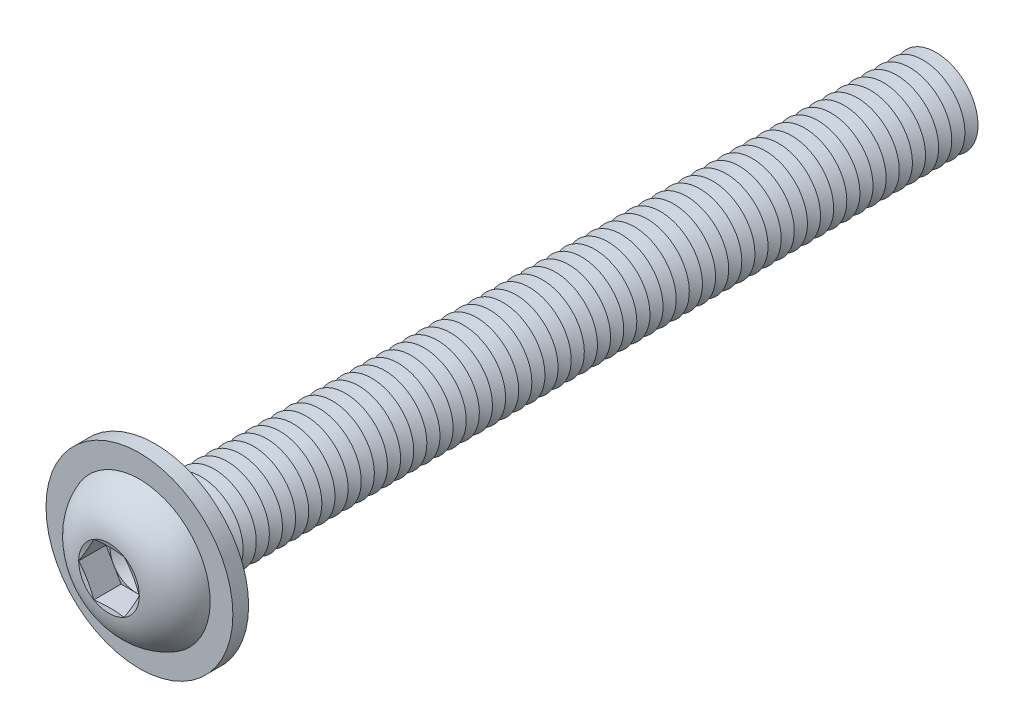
ISO-10303-21;
HEADER;
FILE_DESCRIPTION(('STEP AP214'),'2;1');
FILE_NAME('part.step','',(''),(''),'','','');
FILE_SCHEMA(('AUTOMOTIVE_DESIGN { 1 0 10303 214 1 1 1 1 }'));
ENDSEC;
DATA;
#1=APPLICATION_CONTEXT('core data for automotive mechanical design processes');
#2=APPLICATION_PROTOCOL_DEFINITION('international standard','automotive_design',2000,#1);
#3=PRODUCT_CONTEXT('',#1,'mechanical');
#4=PRODUCT('Part','Part','',(#3));
#5=PRODUCT_RELATED_PRODUCT_CATEGORY('part','',(#4));
#6=PRODUCT_DEFINITION_FORMATION('','',#4);
#7=PRODUCT_DEFINITION_CONTEXT('part definition',#1,'design');
#8=PRODUCT_DEFINITION('design','',#6,#7);
#9=PRODUCT_DEFINITION_SHAPE('','',#8);
#10=(LENGTH_UNIT() NAMED_UNIT(*) SI_UNIT(.MILLI.,.METRE.));
#11=(NAMED_UNIT(*) PLANE_ANGLE_UNIT() SI_UNIT($,.RADIAN.));
#12=(NAMED_UNIT(*) SI_UNIT($,.STERADIAN.) SOLID_ANGLE_UNIT());
#13=UNCERTAINTY_MEASURE_WITH_UNIT(LENGTH_MEASURE(1.E-05),#10,'distance_accuracy_value','');
#14=(GEOMETRIC_REPRESENTATION_CONTEXT(3) GLOBAL_UNCERTAINTY_ASSIGNED_CONTEXT((#13)) GLOBAL_UNIT_ASSIGNED_CONTEXT((#10,
#11,#12)) REPRESENTATION_CONTEXT('',''));
#15=CARTESIAN_POINT('',(0.,0.,0.));
#16=DIRECTION('',(0.,0.,1.));
#17=DIRECTION('',(1.,0.,0.));
#18=AXIS2_PLACEMENT_3D('',#15,#16,#17);
#19=CARTESIAN_POINT('',(0.,0.,-70.625));
#20=DIRECTION('',(0.,0.,1.));
#21=DIRECTION('',(0.,-1.,0.));
#22=AXIS2_PLACEMENT_3D('',#19,#20,#21);
#23=CONICAL_SURFACE('',#22,3.99999999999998,1.0471975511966);
#24=CARTESIAN_POINT('',(0.,0.,-71.25));
#25=DIRECTION('',(0.,0.,1.));
#26=DIRECTION('',(0.,-1.,0.));
#27=AXIS2_PLACEMENT_3D('',#24,#25,#26);
#28=CIRCLE('',#27,2.91746824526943);
#29=CARTESIAN_POINT('',(0.,-2.91746824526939,-71.25));
#30=VERTEX_POINT('',#29);
#31=EDGE_CURVE('E688',#30,#30,#28,.T.);
#32=ORIENTED_EDGE('',*,*,#31,.T.);
#33=EDGE_LOOP('',(#32));
#34=FACE_BOUND('',#33,.T.);
#35=CARTESIAN_POINT('',(0.,0.,-70.625));
#36=DIRECTION('',(0.,0.,1.));
#37=DIRECTION('',(0.,-1.,0.));
#38=AXIS2_PLACEMENT_3D('',#35,#36,#37);
#39=CIRCLE('',#38,3.99999999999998);
#40=CARTESIAN_POINT('',(0.,-3.99999999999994,-70.625));
#41=VERTEX_POINT('',#40);
#42=EDGE_CURVE('E684',#41,#41,#39,.T.);
#43=ORIENTED_EDGE('',*,*,#42,.F.);
#44=EDGE_LOOP('',(#43));
#45=FACE_BOUND('',#44,.T.);
#46=ADVANCED_FACE('F39',(#34,#45),#23,.T.);
#47=CARTESIAN_POINT('',(0.,0.,-71.25));
#48=DIRECTION('',(0.,0.,-1.));
#49=DIRECTION('',(0.,1.,0.));
#50=AXIS2_PLACEMENT_3D('',#47,#48,#49);
#51=CONICAL_SURFACE('',#50,2.91746824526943,1.0471975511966);
#52=CARTESIAN_POINT('',(0.,0.,-71.875));
#53=DIRECTION('',(0.,0.,1.));
#54=DIRECTION('',(0.,-1.,0.));
#55=AXIS2_PLACEMENT_3D('',#52,#53,#54);
#56=CIRCLE('',#55,3.99999999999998);
#57=CARTESIAN_POINT('',(0.,-3.99999999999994,-71.875));
#58=VERTEX_POINT('',#57);
#59=EDGE_CURVE('E692',#58,#58,#56,.T.);
#60=ORIENTED_EDGE('',*,*,#59,.T.);
#61=EDGE_LOOP('',(#60));
#62=FACE_BOUND('',#61,.T.);
#63=ORIENTED_EDGE('',*,*,#31,.F.);
#64=EDGE_LOOP('',(#63));
#65=FACE_BOUND('',#64,.T.);
#66=ADVANCED_FACE('F808',(#62,#65),#51,.T.);
#67=CARTESIAN_POINT('',(0.,3.99999999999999,-75.));
#68=DIRECTION('',(0.,0.,-1.));
#69=DIRECTION('',(0.,1.,0.));
#70=AXIS2_PLACEMENT_3D('',#67,#68,#69);
#71=PLANE('',#70);
#72=CARTESIAN_POINT('',(0.,0.,-75.));
#73=DIRECTION('',(0.,0.,1.));
#74=DIRECTION('',(0.,-1.,0.));
#75=AXIS2_PLACEMENT_3D('',#72,#73,#74);
#76=CIRCLE('',#75,2.91746824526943);
#77=CARTESIAN_POINT('',(0.,-2.91746824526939,-75.));
#78=VERTEX_POINT('',#77);
#79=EDGE_CURVE('E712',#78,#78,#76,.T.);
#80=ORIENTED_EDGE('',*,*,#79,.F.);
#81=EDGE_LOOP('',(#80));
#82=FACE_BOUND('',#81,.T.);
#83=ADVANCED_FACE('F814',(#82),#71,.T.);
#84=CARTESIAN_POINT('',(0.,0.,-74.375));
#85=DIRECTION('',(0.,0.,1.));
#86=DIRECTION('',(0.,-1.,0.));
#87=AXIS2_PLACEMENT_3D('',#84,#85,#86);
#88=CONICAL_SURFACE('',#87,3.99999999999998,1.0471975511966);
#89=ORIENTED_EDGE('',*,*,#79,.T.);
#90=EDGE_LOOP('',(#89));
#91=FACE_BOUND('',#90,.T.);
#92=CARTESIAN_POINT('',(0.,0.,-74.375));
#93=DIRECTION('',(0.,0.,1.));
#94=DIRECTION('',(0.,-1.,0.));
#95=AXIS2_PLACEMENT_3D('',#92,#93,#94);
#96=CIRCLE('',#95,3.99999999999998);
#97=CARTESIAN_POINT('',(0.,-3.99999999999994,-74.375));
#98=VERTEX_POINT('',#97);
#99=EDGE_CURVE('E708',#98,#98,#96,.T.);
#100=ORIENTED_EDGE('',*,*,#99,.F.);
#101=EDGE_LOOP('',(#100));
#102=FACE_BOUND('',#101,.T.);
#103=ADVANCED_FACE('F833',(#91,#102),#88,.T.);
#104=CARTESIAN_POINT('',(0.,0.,-73.75));
#105=DIRECTION('',(0.,0.,-1.));
#106=DIRECTION('',(0.,1.,0.));
#107=AXIS2_PLACEMENT_3D('',#104,#105,#106);
#108=CONICAL_SURFACE('',#107,2.91746824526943,1.0471975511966);
#109=ORIENTED_EDGE('',*,*,#99,.T.);
#110=EDGE_LOOP('',(#109));
#111=FACE_BOUND('',#110,.T.);
#112=CARTESIAN_POINT('',(0.,0.,-73.75));
#113=DIRECTION('',(0.,0.,1.));
#114=DIRECTION('',(0.,-1.,0.));
#115=AXIS2_PLACEMENT_3D('',#112,#113,#114);
#116=CIRCLE('',#115,2.91746824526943);
#117=CARTESIAN_POINT('',(0.,-2.91746824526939,-73.75));
#118=VERTEX_POINT('',#117);
#119=EDGE_CURVE('E704',#118,#118,#116,.T.);
#120=ORIENTED_EDGE('',*,*,#119,.F.);
#121=EDGE_LOOP('',(#120));
#122=FACE_BOUND('',#121,.T.);
#123=ADVANCED_FACE('F830',(#111,#122),#108,.T.);
#124=CARTESIAN_POINT('',(0.,0.,-73.125));
#125=DIRECTION('',(0.,0.,1.));
#126=DIRECTION('',(0.,-1.,0.));
#127=AXIS2_PLACEMENT_3D('',#124,#125,#126);
#128=CONICAL_SURFACE('',#127,3.99999999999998,1.0471975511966);
#129=ORIENTED_EDGE('',*,*,#119,.T.);
#130=EDGE_LOOP('',(#129));
#131=FACE_BOUND('',#130,.T.);
#132=CARTESIAN_POINT('',(0.,0.,-73.125));
#133=DIRECTION('',(0.,0.,1.));
#134=DIRECTION('',(0.,-1.,0.));
#135=AXIS2_PLACEMENT_3D('',#132,#133,#134);
#136=CIRCLE('',#135,3.99999999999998);
#137=CARTESIAN_POINT('',(0.,-3.99999999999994,-73.125));
#138=VERTEX_POINT('',#137);
#139=EDGE_CURVE('E700',#138,#138,#136,.T.);
#140=ORIENTED_EDGE('',*,*,#139,.F.);
#141=EDGE_LOOP('',(#140));
#142=FACE_BOUND('',#141,.T.);
#143=ADVANCED_FACE('F824',(#131,#142),#128,.T.);
#144=CARTESIAN_POINT('',(0.,0.,-72.5));
#145=DIRECTION('',(0.,0.,-1.));
#146=DIRECTION('',(0.,1.,0.));
#147=AXIS2_PLACEMENT_3D('',#144,#145,#146);
#148=CONICAL_SURFACE('',#147,2.91746824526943,1.0471975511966);
#149=ORIENTED_EDGE('',*,*,#139,.T.);
#150=EDGE_LOOP('',(#149));
#151=FACE_BOUND('',#150,.T.);
#152=CARTESIAN_POINT('',(0.,0.,-72.5));
#153=DIRECTION('',(0.,0.,1.));
#154=DIRECTION('',(0.,-1.,0.));
#155=AXIS2_PLACEMENT_3D('',#152,#153,#154);
#156=CIRCLE('',#155,2.91746824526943);
#157=CARTESIAN_POINT('',(0.,-2.91746824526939,-72.5));
#158=VERTEX_POINT('',#157);
#159=EDGE_CURVE('E696',#158,#158,#156,.T.);
#160=ORIENTED_EDGE('',*,*,#159,.F.);
#161=EDGE_LOOP('',(#160));
#162=FACE_BOUND('',#161,.T.);
#163=ADVANCED_FACE('F820',(#151,#162),#148,.T.);
#164=CARTESIAN_POINT('',(0.,0.,-71.875));
#165=DIRECTION('',(0.,0.,1.));
#166=DIRECTION('',(0.,-1.,0.));
#167=AXIS2_PLACEMENT_3D('',#164,#165,#166);
#168=CONICAL_SURFACE('',#167,3.99999999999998,1.0471975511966);
#169=ORIENTED_EDGE('',*,*,#159,.T.);
#170=EDGE_LOOP('',(#169));
#171=FACE_BOUND('',#170,.T.);
#172=ORIENTED_EDGE('',*,*,#59,.F.);
#173=EDGE_LOOP('',(#172));
#174=FACE_BOUND('',#173,.T.);
#175=ADVANCED_FACE('F823',(#171,#174),#168,.T.);
#176=CARTESIAN_POINT('',(0.,0.,-69.375));
#177=DIRECTION('',(0.,0.,1.));
#178=DIRECTION('',(0.,-1.,0.));
#179=AXIS2_PLACEMENT_3D('',#176,#177,#178);
#180=CONICAL_SURFACE('',#179,3.99999999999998,1.0471975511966);
#181=CARTESIAN_POINT('',(0.,0.,-70.));
#182=DIRECTION('',(0.,0.,1.));
#183=DIRECTION('',(0.,-1.,0.));
#184=AXIS2_PLACEMENT_3D('',#181,#182,#183);
#185=CIRCLE('',#184,2.91746824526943);
#186=CARTESIAN_POINT('',(0.,-2.91746824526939,-70.));
#187=VERTEX_POINT('',#186);
#188=EDGE_CURVE('E680',#187,#187,#185,.T.);
#189=ORIENTED_EDGE('',*,*,#188,.T.);
#190=EDGE_LOOP('',(#189));
#191=FACE_BOUND('',#190,.T.);
#192=CARTESIAN_POINT('',(0.,0.,-69.375));
#193=DIRECTION('',(0.,0.,1.));
#194=DIRECTION('',(0.,-1.,0.));
#195=AXIS2_PLACEMENT_3D('',#192,#193,#194);
#196=CIRCLE('',#195,3.99999999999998);
#197=CARTESIAN_POINT('',(0.,-3.99999999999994,-69.375));
#198=VERTEX_POINT('',#197);
#199=EDGE_CURVE('E676',#198,#198,#196,.T.);
#200=ORIENTED_EDGE('',*,*,#199,.F.);
#201=EDGE_LOOP('',(#200));
#202=FACE_BOUND('',#201,.T.);
#203=ADVANCED_FACE('F828',(#191,#202),#180,.T.);
#204=CARTESIAN_POINT('',(0.,0.,-70.));
#205=DIRECTION('',(0.,0.,-1.));
#206=DIRECTION('',(0.,1.,0.));
#207=AXIS2_PLACEMENT_3D('',#204,#205,#206);
#208=CONICAL_SURFACE('',#207,2.91746824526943,1.0471975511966);
#209=ORIENTED_EDGE('',*,*,#42,.T.);
#210=EDGE_LOOP('',(#209));
#211=FACE_BOUND('',#210,.T.);
#212=ORIENTED_EDGE('',*,*,#188,.F.);
#213=EDGE_LOOP('',(#212));
#214=FACE_BOUND('',#213,.T.);
#215=ADVANCED_FACE('F879',(#211,#214),#208,.T.);
#216=CARTESIAN_POINT('',(0.,0.,-68.1249999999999));
#217=DIRECTION('',(0.,0.,1.));
#218=DIRECTION('',(0.,-1.,0.));
#219=AXIS2_PLACEMENT_3D('',#216,#217,#218);
#220=CONICAL_SURFACE('',#219,3.99999999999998,1.0471975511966);
#221=CARTESIAN_POINT('',(0.,0.,-68.7499999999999));
#222=DIRECTION('',(0.,0.,1.));
#223=DIRECTION('',(0.,-1.,0.));
#224=AXIS2_PLACEMENT_3D('',#221,#222,#223);
#225=CIRCLE('',#224,2.91746824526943);
#226=CARTESIAN_POINT('',(0.,-2.91746824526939,-68.7499999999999));
#227=VERTEX_POINT('',#226);
#228=EDGE_CURVE('E673',#227,#227,#225,.T.);
#229=ORIENTED_EDGE('',*,*,#228,.T.);
#230=EDGE_LOOP('',(#229));
#231=FACE_BOUND('',#230,.T.);
#232=CARTESIAN_POINT('',(0.,0.,-68.125));
#233=DIRECTION('',(0.,0.,1.));
#234=DIRECTION('',(0.,-1.,0.));
#235=AXIS2_PLACEMENT_3D('',#232,#233,#234);
#236=CIRCLE('',#235,3.99999999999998);
#237=CARTESIAN_POINT('',(0.,-3.99999999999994,-68.125));
#238=VERTEX_POINT('',#237);
#239=EDGE_CURVE('E669',#238,#238,#236,.T.);
#240=ORIENTED_EDGE('',*,*,#239,.F.);
#241=EDGE_LOOP('',(#240));
#242=FACE_BOUND('',#241,.T.);
#243=ADVANCED_FACE('F885',(#231,#242),#220,.T.);
#244=CARTESIAN_POINT('',(0.,0.,-68.7499999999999));
#245=DIRECTION('',(0.,0.,-1.));
#246=DIRECTION('',(0.,1.,0.));
#247=AXIS2_PLACEMENT_3D('',#244,#245,#246);
#248=CONICAL_SURFACE('',#247,2.91746824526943,1.0471975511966);
#249=ORIENTED_EDGE('',*,*,#199,.T.);
#250=EDGE_LOOP('',(#249));
#251=FACE_BOUND('',#250,.T.);
#252=ORIENTED_EDGE('',*,*,#228,.F.);
#253=EDGE_LOOP('',(#252));
#254=FACE_BOUND('',#253,.T.);
#255=ADVANCED_FACE('F892',(#251,#254),#248,.T.);
#256=CARTESIAN_POINT('',(0.,0.,-66.875));
#257=DIRECTION('',(0.,0.,1.));
#258=DIRECTION('',(0.,-1.,0.));
#259=AXIS2_PLACEMENT_3D('',#256,#257,#258);
#260=CONICAL_SURFACE('',#259,3.99999999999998,1.0471975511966);
#261=CARTESIAN_POINT('',(0.,0.,-67.4999999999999));
#262=DIRECTION('',(0.,0.,1.));
#263=DIRECTION('',(0.,-1.,0.));
#264=AXIS2_PLACEMENT_3D('',#261,#262,#263);
#265=CIRCLE('',#264,2.91746824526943);
#266=CARTESIAN_POINT('',(0.,-2.91746824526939,-67.4999999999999));
#267=VERTEX_POINT('',#266);
#268=EDGE_CURVE('E665',#267,#267,#265,.T.);
#269=ORIENTED_EDGE('',*,*,#268,.T.);
#270=EDGE_LOOP('',(#269));
#271=FACE_BOUND('',#270,.T.);
#272=CARTESIAN_POINT('',(0.,0.,-66.875));
#273=DIRECTION('',(0.,0.,1.));
#274=DIRECTION('',(0.,-1.,0.));
#275=AXIS2_PLACEMENT_3D('',#272,#273,#274);
#276=CIRCLE('',#275,3.99999999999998);
#277=CARTESIAN_POINT('',(0.,-3.99999999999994,-66.875));
#278=VERTEX_POINT('',#277);
#279=EDGE_CURVE('E661',#278,#278,#276,.T.);
#280=ORIENTED_EDGE('',*,*,#279,.F.);
#281=EDGE_LOOP('',(#280));
#282=FACE_BOUND('',#281,.T.);
#283=ADVANCED_FACE('F899',(#271,#282),#260,.T.);
#284=CARTESIAN_POINT('',(0.,0.,-67.4999999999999));
#285=DIRECTION('',(0.,0.,-1.));
#286=DIRECTION('',(0.,1.,0.));
#287=AXIS2_PLACEMENT_3D('',#284,#285,#286);
#288=CONICAL_SURFACE('',#287,2.91746824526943,1.0471975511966);
#289=ORIENTED_EDGE('',*,*,#239,.T.);
#290=EDGE_LOOP('',(#289));
#291=FACE_BOUND('',#290,.T.);
#292=ORIENTED_EDGE('',*,*,#268,.F.);
#293=EDGE_LOOP('',(#292));
#294=FACE_BOUND('',#293,.T.);
#295=ADVANCED_FACE('F906',(#291,#294),#288,.T.);
#296=CARTESIAN_POINT('',(0.,0.,-65.625));
#297=DIRECTION('',(0.,0.,1.));
#298=DIRECTION('',(0.,-1.,0.));
#299=AXIS2_PLACEMENT_3D('',#296,#297,#298);
#300=CONICAL_SURFACE('',#299,3.99999999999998,1.0471975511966);
#301=CARTESIAN_POINT('',(0.,0.,-66.2499999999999));
#302=DIRECTION('',(0.,0.,1.));
#303=DIRECTION('',(0.,-1.,0.));
#304=AXIS2_PLACEMENT_3D('',#301,#302,#303);
#305=CIRCLE('',#304,2.91746824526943);
#306=CARTESIAN_POINT('',(0.,-2.91746824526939,-66.2499999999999));
#307=VERTEX_POINT('',#306);
#308=EDGE_CURVE('E657',#307,#307,#305,.T.);
#309=ORIENTED_EDGE('',*,*,#308,.T.);
#310=EDGE_LOOP('',(#309));
#311=FACE_BOUND('',#310,.T.);
#312=CARTESIAN_POINT('',(0.,0.,-65.625));
#313=DIRECTION('',(0.,0.,1.));
#314=DIRECTION('',(0.,-1.,0.));
#315=AXIS2_PLACEMENT_3D('',#312,#313,#314);
#316=CIRCLE('',#315,3.99999999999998);
#317=CARTESIAN_POINT('',(0.,-3.99999999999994,-65.625));
#318=VERTEX_POINT('',#317);
#319=EDGE_CURVE('E653',#318,#318,#316,.T.);
#320=ORIENTED_EDGE('',*,*,#319,.F.);
#321=EDGE_LOOP('',(#320));
#322=FACE_BOUND('',#321,.T.);
#323=ADVANCED_FACE('F913',(#311,#322),#300,.T.);
#324=CARTESIAN_POINT('',(0.,0.,-66.2499999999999));
#325=DIRECTION('',(0.,0.,-1.));
#326=DIRECTION('',(0.,1.,0.));
#327=AXIS2_PLACEMENT_3D('',#324,#325,#326);
#328=CONICAL_SURFACE('',#327,2.91746824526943,1.0471975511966);
#329=ORIENTED_EDGE('',*,*,#279,.T.);
#330=EDGE_LOOP('',(#329));
#331=FACE_BOUND('',#330,.T.);
#332=ORIENTED_EDGE('',*,*,#308,.F.);
#333=EDGE_LOOP('',(#332));
#334=FACE_BOUND('',#333,.T.);
#335=ADVANCED_FACE('F920',(#331,#334),#328,.T.);
#336=CARTESIAN_POINT('',(0.,0.,-64.375));
#337=DIRECTION('',(0.,0.,1.));
#338=DIRECTION('',(0.,-1.,0.));
#339=AXIS2_PLACEMENT_3D('',#336,#337,#338);
#340=CONICAL_SURFACE('',#339,3.99999999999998,1.0471975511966);
#341=CARTESIAN_POINT('',(0.,0.,-65.));
#342=DIRECTION('',(0.,0.,1.));
#343=DIRECTION('',(0.,-1.,0.));
#344=AXIS2_PLACEMENT_3D('',#341,#342,#343);
#345=CIRCLE('',#344,2.91746824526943);
#346=CARTESIAN_POINT('',(0.,-2.91746824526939,-65.));
#347=VERTEX_POINT('',#346);
#348=EDGE_CURVE('E649',#347,#347,#345,.T.);
#349=ORIENTED_EDGE('',*,*,#348,.T.);
#350=EDGE_LOOP('',(#349));
#351=FACE_BOUND('',#350,.T.);
#352=CARTESIAN_POINT('',(0.,0.,-64.375));
#353=DIRECTION('',(0.,0.,1.));
#354=DIRECTION('',(0.,-1.,0.));
#355=AXIS2_PLACEMENT_3D('',#352,#353,#354);
#356=CIRCLE('',#355,3.99999999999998);
#357=CARTESIAN_POINT('',(0.,-3.99999999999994,-64.375));
#358=VERTEX_POINT('',#357);
#359=EDGE_CURVE('E645',#358,#358,#356,.T.);
#360=ORIENTED_EDGE('',*,*,#359,.F.);
#361=EDGE_LOOP('',(#360));
#362=FACE_BOUND('',#361,.T.);
#363=ADVANCED_FACE('F927',(#351,#362),#340,.T.);
#364=CARTESIAN_POINT('',(0.,0.,-65.));
#365=DIRECTION('',(0.,0.,-1.));
#366=DIRECTION('',(0.,1.,0.));
#367=AXIS2_PLACEMENT_3D('',#364,#365,#366);
#368=CONICAL_SURFACE('',#367,2.91746824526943,1.0471975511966);
#369=ORIENTED_EDGE('',*,*,#319,.T.);
#370=EDGE_LOOP('',(#369));
#371=FACE_BOUND('',#370,.T.);
#372=ORIENTED_EDGE('',*,*,#348,.F.);
#373=EDGE_LOOP('',(#372));
#374=FACE_BOUND('',#373,.T.);
#375=ADVANCED_FACE('F934',(#371,#374),#368,.T.);
#376=CARTESIAN_POINT('',(0.,0.,-63.125));
#377=DIRECTION('',(0.,0.,1.));
#378=DIRECTION('',(0.,-1.,0.));
#379=AXIS2_PLACEMENT_3D('',#376,#377,#378);
#380=CONICAL_SURFACE('',#379,3.99999999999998,1.0471975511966);
#381=CARTESIAN_POINT('',(0.,0.,-63.75));
#382=DIRECTION('',(0.,0.,1.));
#383=DIRECTION('',(0.,-1.,0.));
#384=AXIS2_PLACEMENT_3D('',#381,#382,#383);
#385=CIRCLE('',#384,2.91746824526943);
#386=CARTESIAN_POINT('',(0.,-2.91746824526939,-63.75));
#387=VERTEX_POINT('',#386);
#388=EDGE_CURVE('E641',#387,#387,#385,.T.);
#389=ORIENTED_EDGE('',*,*,#388,.T.);
#390=EDGE_LOOP('',(#389));
#391=FACE_BOUND('',#390,.T.);
#392=CARTESIAN_POINT('',(0.,0.,-63.125));
#393=DIRECTION('',(0.,0.,1.));
#394=DIRECTION('',(0.,-1.,0.));
#395=AXIS2_PLACEMENT_3D('',#392,#393,#394);
#396=CIRCLE('',#395,3.99999999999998);
#397=CARTESIAN_POINT('',(0.,-3.99999999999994,-63.125));
#398=VERTEX_POINT('',#397);
#399=EDGE_CURVE('E637',#398,#398,#396,.T.);
#400=ORIENTED_EDGE('',*,*,#399,.F.);
#401=EDGE_LOOP('',(#400));
#402=FACE_BOUND('',#401,.T.);
#403=ADVANCED_FACE('F941',(#391,#402),#380,.T.);
#404=CARTESIAN_POINT('',(0.,0.,-63.75));
#405=DIRECTION('',(0.,0.,-1.));
#406=DIRECTION('',(0.,1.,0.));
#407=AXIS2_PLACEMENT_3D('',#404,#405,#406);
#408=CONICAL_SURFACE('',#407,2.91746824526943,1.0471975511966);
#409=ORIENTED_EDGE('',*,*,#359,.T.);
#410=EDGE_LOOP('',(#409));
#411=FACE_BOUND('',#410,.T.);
#412=ORIENTED_EDGE('',*,*,#388,.F.);
#413=EDGE_LOOP('',(#412));
#414=FACE_BOUND('',#413,.T.);
#415=ADVANCED_FACE('F948',(#411,#414),#408,.T.);
#416=CARTESIAN_POINT('',(0.,0.,-61.875));
#417=DIRECTION('',(0.,0.,1.));
#418=DIRECTION('',(0.,-1.,0.));
#419=AXIS2_PLACEMENT_3D('',#416,#417,#418);
#420=CONICAL_SURFACE('',#419,3.99999999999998,1.0471975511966);
#421=CARTESIAN_POINT('',(0.,0.,-62.5));
#422=DIRECTION('',(0.,0.,1.));
#423=DIRECTION('',(0.,-1.,0.));
#424=AXIS2_PLACEMENT_3D('',#421,#422,#423);
#425=CIRCLE('',#424,2.91746824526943);
#426=CARTESIAN_POINT('',(0.,-2.91746824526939,-62.5));
#427=VERTEX_POINT('',#426);
#428=EDGE_CURVE('E633',#427,#427,#425,.T.);
#429=ORIENTED_EDGE('',*,*,#428,.T.);
#430=EDGE_LOOP('',(#429));
#431=FACE_BOUND('',#430,.T.);
#432=CARTESIAN_POINT('',(0.,0.,-61.875));
#433=DIRECTION('',(0.,0.,1.));
#434=DIRECTION('',(0.,-1.,0.));
#435=AXIS2_PLACEMENT_3D('',#432,#433,#434);
#436=CIRCLE('',#435,3.99999999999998);
#437=CARTESIAN_POINT('',(0.,-3.99999999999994,-61.875));
#438=VERTEX_POINT('',#437);
#439=EDGE_CURVE('E629',#438,#438,#436,.T.);
#440=ORIENTED_EDGE('',*,*,#439,.F.);
#441=EDGE_LOOP('',(#440));
#442=FACE_BOUND('',#441,.T.);
#443=ADVANCED_FACE('F955',(#431,#442),#420,.T.);
#444=CARTESIAN_POINT('',(0.,0.,-62.5));
#445=DIRECTION('',(0.,0.,-1.));
#446=DIRECTION('',(0.,1.,0.));
#447=AXIS2_PLACEMENT_3D('',#444,#445,#446);
#448=CONICAL_SURFACE('',#447,2.91746824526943,1.0471975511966);
#449=ORIENTED_EDGE('',*,*,#399,.T.);
#450=EDGE_LOOP('',(#449));
#451=FACE_BOUND('',#450,.T.);
#452=ORIENTED_EDGE('',*,*,#428,.F.);
#453=EDGE_LOOP('',(#452));
#454=FACE_BOUND('',#453,.T.);
#455=ADVANCED_FACE('F962',(#451,#454),#448,.T.);
#456=CARTESIAN_POINT('',(0.,0.,-60.625));
#457=DIRECTION('',(0.,0.,1.));
#458=DIRECTION('',(0.,-1.,0.));
#459=AXIS2_PLACEMENT_3D('',#456,#457,#458);
#460=CONICAL_SURFACE('',#459,3.99999999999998,1.0471975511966);
#461=CARTESIAN_POINT('',(0.,0.,-61.25));
#462=DIRECTION('',(0.,0.,1.));
#463=DIRECTION('',(0.,-1.,0.));
#464=AXIS2_PLACEMENT_3D('',#461,#462,#463);
#465=CIRCLE('',#464,2.91746824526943);
#466=CARTESIAN_POINT('',(0.,-2.9174682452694,-61.25));
#467=VERTEX_POINT('',#466);
#468=EDGE_CURVE('E625',#467,#467,#465,.T.);
#469=ORIENTED_EDGE('',*,*,#468,.T.);
#470=EDGE_LOOP('',(#469));
#471=FACE_BOUND('',#470,.T.);
#472=CARTESIAN_POINT('',(0.,0.,-60.625));
#473=DIRECTION('',(0.,0.,1.));
#474=DIRECTION('',(0.,-1.,0.));
#475=AXIS2_PLACEMENT_3D('',#472,#473,#474);
#476=CIRCLE('',#475,3.99999999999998);
#477=CARTESIAN_POINT('',(0.,-3.99999999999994,-60.625));
#478=VERTEX_POINT('',#477);
#479=EDGE_CURVE('E621',#478,#478,#476,.T.);
#480=ORIENTED_EDGE('',*,*,#479,.F.);
#481=EDGE_LOOP('',(#480));
#482=FACE_BOUND('',#481,.T.);
#483=ADVANCED_FACE('F969',(#471,#482),#460,.T.);
#484=CARTESIAN_POINT('',(0.,0.,-61.25));
#485=DIRECTION('',(0.,0.,-1.));
#486=DIRECTION('',(0.,1.,0.));
#487=AXIS2_PLACEMENT_3D('',#484,#485,#486);
#488=CONICAL_SURFACE('',#487,2.91746824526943,1.0471975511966);
#489=ORIENTED_EDGE('',*,*,#439,.T.);
#490=EDGE_LOOP('',(#489));
#491=FACE_BOUND('',#490,.T.);
#492=ORIENTED_EDGE('',*,*,#468,.F.);
#493=EDGE_LOOP('',(#492));
#494=FACE_BOUND('',#493,.T.);
#495=ADVANCED_FACE('F976',(#491,#494),#488,.T.);
#496=CARTESIAN_POINT('',(0.,0.,-59.375));
#497=DIRECTION('',(0.,0.,1.));
#498=DIRECTION('',(0.,-1.,0.));
#499=AXIS2_PLACEMENT_3D('',#496,#497,#498);
#500=CONICAL_SURFACE('',#499,3.99999999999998,1.0471975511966);
#501=CARTESIAN_POINT('',(0.,0.,-60.));
#502=DIRECTION('',(0.,0.,1.));
#503=DIRECTION('',(0.,-1.,0.));
#504=AXIS2_PLACEMENT_3D('',#501,#502,#503);
#505=CIRCLE('',#504,2.91746824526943);
#506=CARTESIAN_POINT('',(0.,-2.9174682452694,-60.));
#507=VERTEX_POINT('',#506);
#508=EDGE_CURVE('E617',#507,#507,#505,.T.);
#509=ORIENTED_EDGE('',*,*,#508,.T.);
#510=EDGE_LOOP('',(#509));
#511=FACE_BOUND('',#510,.T.);
#512=CARTESIAN_POINT('',(0.,0.,-59.375));
#513=DIRECTION('',(0.,0.,1.));
#514=DIRECTION('',(0.,-1.,0.));
#515=AXIS2_PLACEMENT_3D('',#512,#513,#514);
#516=CIRCLE('',#515,3.99999999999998);
#517=CARTESIAN_POINT('',(0.,-3.99999999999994,-59.375));
#518=VERTEX_POINT('',#517);
#519=EDGE_CURVE('E613',#518,#518,#516,.T.);
#520=ORIENTED_EDGE('',*,*,#519,.F.);
#521=EDGE_LOOP('',(#520));
#522=FACE_BOUND('',#521,.T.);
#523=ADVANCED_FACE('F983',(#511,#522),#500,.T.);
#524=CARTESIAN_POINT('',(0.,0.,-60.));
#525=DIRECTION('',(0.,0.,-1.));
#526=DIRECTION('',(0.,1.,0.));
#527=AXIS2_PLACEMENT_3D('',#524,#525,#526);
#528=CONICAL_SURFACE('',#527,2.91746824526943,1.0471975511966);
#529=ORIENTED_EDGE('',*,*,#479,.T.);
#530=EDGE_LOOP('',(#529));
#531=FACE_BOUND('',#530,.T.);
#532=ORIENTED_EDGE('',*,*,#508,.F.);
#533=EDGE_LOOP('',(#532));
#534=FACE_BOUND('',#533,.T.);
#535=ADVANCED_FACE('F990',(#531,#534),#528,.T.);
#536=CARTESIAN_POINT('',(0.,0.,-58.125));
#537=DIRECTION('',(0.,0.,1.));
#538=DIRECTION('',(0.,-1.,0.));
#539=AXIS2_PLACEMENT_3D('',#536,#537,#538);
#540=CONICAL_SURFACE('',#539,3.99999999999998,1.0471975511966);
#541=CARTESIAN_POINT('',(0.,0.,-58.75));
#542=DIRECTION('',(0.,0.,1.));
#543=DIRECTION('',(0.,-1.,0.));
#544=AXIS2_PLACEMENT_3D('',#541,#542,#543);
#545=CIRCLE('',#544,2.91746824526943);
#546=CARTESIAN_POINT('',(0.,-2.9174682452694,-58.75));
#547=VERTEX_POINT('',#546);
#548=EDGE_CURVE('E609',#547,#547,#545,.T.);
#549=ORIENTED_EDGE('',*,*,#548,.T.);
#550=EDGE_LOOP('',(#549));
#551=FACE_BOUND('',#550,.T.);
#552=CARTESIAN_POINT('',(0.,0.,-58.125));
#553=DIRECTION('',(0.,0.,1.));
#554=DIRECTION('',(0.,-1.,0.));
#555=AXIS2_PLACEMENT_3D('',#552,#553,#554);
#556=CIRCLE('',#555,3.99999999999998);
#557=CARTESIAN_POINT('',(0.,-3.99999999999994,-58.125));
#558=VERTEX_POINT('',#557);
#559=EDGE_CURVE('E605',#558,#558,#556,.T.);
#560=ORIENTED_EDGE('',*,*,#559,.F.);
#561=EDGE_LOOP('',(#560));
#562=FACE_BOUND('',#561,.T.);
#563=ADVANCED_FACE('F997',(#551,#562),#540,.T.);
#564=CARTESIAN_POINT('',(0.,0.,-58.75));
#565=DIRECTION('',(0.,0.,-1.));
#566=DIRECTION('',(0.,1.,0.));
#567=AXIS2_PLACEMENT_3D('',#564,#565,#566);
#568=CONICAL_SURFACE('',#567,2.91746824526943,1.0471975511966);
#569=ORIENTED_EDGE('',*,*,#519,.T.);
#570=EDGE_LOOP('',(#569));
#571=FACE_BOUND('',#570,.T.);
#572=ORIENTED_EDGE('',*,*,#548,.F.);
#573=EDGE_LOOP('',(#572));
#574=FACE_BOUND('',#573,.T.);
#575=ADVANCED_FACE('F1004',(#571,#574),#568,.T.);
#576=CARTESIAN_POINT('',(0.,0.,-56.875));
#577=DIRECTION('',(0.,0.,1.));
#578=DIRECTION('',(0.,-1.,0.));
#579=AXIS2_PLACEMENT_3D('',#576,#577,#578);
#580=CONICAL_SURFACE('',#579,3.99999999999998,1.0471975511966);
#581=CARTESIAN_POINT('',(0.,0.,-57.5));
#582=DIRECTION('',(0.,0.,1.));
#583=DIRECTION('',(0.,-1.,0.));
#584=AXIS2_PLACEMENT_3D('',#581,#582,#583);
#585=CIRCLE('',#584,2.91746824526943);
#586=CARTESIAN_POINT('',(0.,-2.9174682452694,-57.5));
#587=VERTEX_POINT('',#586);
#588=EDGE_CURVE('E601',#587,#587,#585,.T.);
#589=ORIENTED_EDGE('',*,*,#588,.T.);
#590=EDGE_LOOP('',(#589));
#591=FACE_BOUND('',#590,.T.);
#592=CARTESIAN_POINT('',(0.,0.,-56.875));
#593=DIRECTION('',(0.,0.,1.));
#594=DIRECTION('',(0.,-1.,0.));
#595=AXIS2_PLACEMENT_3D('',#592,#593,#594);
#596=CIRCLE('',#595,3.99999999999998);
#597=CARTESIAN_POINT('',(0.,-3.99999999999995,-56.875));
#598=VERTEX_POINT('',#597);
#599=EDGE_CURVE('E597',#598,#598,#596,.T.);
#600=ORIENTED_EDGE('',*,*,#599,.F.);
#601=EDGE_LOOP('',(#600));
#602=FACE_BOUND('',#601,.T.);
#603=ADVANCED_FACE('F1011',(#591,#602),#580,.T.);
#604=CARTESIAN_POINT('',(0.,0.,-57.5));
#605=DIRECTION('',(0.,0.,-1.));
#606=DIRECTION('',(0.,1.,0.));
#607=AXIS2_PLACEMENT_3D('',#604,#605,#606);
#608=CONICAL_SURFACE('',#607,2.91746824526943,1.0471975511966);
#609=ORIENTED_EDGE('',*,*,#559,.T.);
#610=EDGE_LOOP('',(#609));
#611=FACE_BOUND('',#610,.T.);
#612=ORIENTED_EDGE('',*,*,#588,.F.);
#613=EDGE_LOOP('',(#612));
#614=FACE_BOUND('',#613,.T.);
#615=ADVANCED_FACE('F1018',(#611,#614),#608,.T.);
#616=CARTESIAN_POINT('',(0.,0.,-55.625));
#617=DIRECTION('',(0.,0.,1.));
#618=DIRECTION('',(0.,-1.,0.));
#619=AXIS2_PLACEMENT_3D('',#616,#617,#618);
#620=CONICAL_SURFACE('',#619,3.99999999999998,1.0471975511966);
#621=CARTESIAN_POINT('',(0.,0.,-56.25));
#622=DIRECTION('',(0.,0.,1.));
#623=DIRECTION('',(0.,-1.,0.));
#624=AXIS2_PLACEMENT_3D('',#621,#622,#623);
#625=CIRCLE('',#624,2.91746824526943);
#626=CARTESIAN_POINT('',(0.,-2.9174682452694,-56.25));
#627=VERTEX_POINT('',#626);
#628=EDGE_CURVE('E593',#627,#627,#625,.T.);
#629=ORIENTED_EDGE('',*,*,#628,.T.);
#630=EDGE_LOOP('',(#629));
#631=FACE_BOUND('',#630,.T.);
#632=CARTESIAN_POINT('',(0.,0.,-55.625));
#633=DIRECTION('',(0.,0.,1.));
#634=DIRECTION('',(0.,-1.,0.));
#635=AXIS2_PLACEMENT_3D('',#632,#633,#634);
#636=CIRCLE('',#635,3.99999999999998);
#637=CARTESIAN_POINT('',(0.,-3.99999999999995,-55.625));
#638=VERTEX_POINT('',#637);
#639=EDGE_CURVE('E589',#638,#638,#636,.T.);
#640=ORIENTED_EDGE('',*,*,#639,.F.);
#641=EDGE_LOOP('',(#640));
#642=FACE_BOUND('',#641,.T.);
#643=ADVANCED_FACE('F1025',(#631,#642),#620,.T.);
#644=CARTESIAN_POINT('',(0.,0.,-56.25));
#645=DIRECTION('',(0.,0.,-1.));
#646=DIRECTION('',(0.,1.,0.));
#647=AXIS2_PLACEMENT_3D('',#644,#645,#646);
#648=CONICAL_SURFACE('',#647,2.91746824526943,1.0471975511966);
#649=ORIENTED_EDGE('',*,*,#599,.T.);
#650=EDGE_LOOP('',(#649));
#651=FACE_BOUND('',#650,.T.);
#652=ORIENTED_EDGE('',*,*,#628,.F.);
#653=EDGE_LOOP('',(#652));
#654=FACE_BOUND('',#653,.T.);
#655=ADVANCED_FACE('F1032',(#651,#654),#648,.T.);
#656=CARTESIAN_POINT('',(0.,0.,-54.375));
#657=DIRECTION('',(0.,0.,1.));
#658=DIRECTION('',(0.,-1.,0.));
#659=AXIS2_PLACEMENT_3D('',#656,#657,#658);
#660=CONICAL_SURFACE('',#659,3.99999999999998,1.0471975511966);
#661=CARTESIAN_POINT('',(0.,0.,-55.));
#662=DIRECTION('',(0.,0.,1.));
#663=DIRECTION('',(0.,-1.,0.));
#664=AXIS2_PLACEMENT_3D('',#661,#662,#663);
#665=CIRCLE('',#664,2.91746824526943);
#666=CARTESIAN_POINT('',(0.,-2.9174682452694,-55.));
#667=VERTEX_POINT('',#666);
#668=EDGE_CURVE('E585',#667,#667,#665,.T.);
#669=ORIENTED_EDGE('',*,*,#668,.T.);
#670=EDGE_LOOP('',(#669));
#671=FACE_BOUND('',#670,.T.);
#672=CARTESIAN_POINT('',(0.,0.,-54.375));
#673=DIRECTION('',(0.,0.,1.));
#674=DIRECTION('',(0.,-1.,0.));
#675=AXIS2_PLACEMENT_3D('',#672,#673,#674);
#676=CIRCLE('',#675,3.99999999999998);
#677=CARTESIAN_POINT('',(0.,-3.99999999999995,-54.375));
#678=VERTEX_POINT('',#677);
#679=EDGE_CURVE('E581',#678,#678,#676,.T.);
#680=ORIENTED_EDGE('',*,*,#679,.F.);
#681=EDGE_LOOP('',(#680));
#682=FACE_BOUND('',#681,.T.);
#683=ADVANCED_FACE('F1039',(#671,#682),#660,.T.);
#684=CARTESIAN_POINT('',(0.,0.,-55.));
#685=DIRECTION('',(0.,0.,-1.));
#686=DIRECTION('',(0.,1.,0.));
#687=AXIS2_PLACEMENT_3D('',#684,#685,#686);
#688=CONICAL_SURFACE('',#687,2.91746824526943,1.0471975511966);
#689=ORIENTED_EDGE('',*,*,#639,.T.);
#690=EDGE_LOOP('',(#689));
#691=FACE_BOUND('',#690,.T.);
#692=ORIENTED_EDGE('',*,*,#668,.F.);
#693=EDGE_LOOP('',(#692));
#694=FACE_BOUND('',#693,.T.);
#695=ADVANCED_FACE('F1046',(#691,#694),#688,.T.);
#696=CARTESIAN_POINT('',(0.,0.,-53.125));
#697=DIRECTION('',(0.,0.,1.));
#698=DIRECTION('',(0.,-1.,0.));
#699=AXIS2_PLACEMENT_3D('',#696,#697,#698);
#700=CONICAL_SURFACE('',#699,3.99999999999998,1.0471975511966);
#701=CARTESIAN_POINT('',(0.,0.,-53.75));
#702=DIRECTION('',(0.,0.,1.));
#703=DIRECTION('',(0.,-1.,0.));
#704=AXIS2_PLACEMENT_3D('',#701,#702,#703);
#705=CIRCLE('',#704,2.91746824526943);
#706=CARTESIAN_POINT('',(0.,-2.9174682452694,-53.75));
#707=VERTEX_POINT('',#706);
#708=EDGE_CURVE('E577',#707,#707,#705,.T.);
#709=ORIENTED_EDGE('',*,*,#708,.T.);
#710=EDGE_LOOP('',(#709));
#711=FACE_BOUND('',#710,.T.);
#712=CARTESIAN_POINT('',(0.,0.,-53.125));
#713=DIRECTION('',(0.,0.,1.));
#714=DIRECTION('',(0.,-1.,0.));
#715=AXIS2_PLACEMENT_3D('',#712,#713,#714);
#716=CIRCLE('',#715,3.99999999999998);
#717=CARTESIAN_POINT('',(0.,-3.99999999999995,-53.125));
#718=VERTEX_POINT('',#717);
#719=EDGE_CURVE('E573',#718,#718,#716,.T.);
#720=ORIENTED_EDGE('',*,*,#719,.F.);
#721=EDGE_LOOP('',(#720));
#722=FACE_BOUND('',#721,.T.);
#723=ADVANCED_FACE('F1053',(#711,#722),#700,.T.);
#724=CARTESIAN_POINT('',(0.,0.,-53.75));
#725=DIRECTION('',(0.,0.,-1.));
#726=DIRECTION('',(0.,1.,0.));
#727=AXIS2_PLACEMENT_3D('',#724,#725,#726);
#728=CONICAL_SURFACE('',#727,2.91746824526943,1.0471975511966);
#729=ORIENTED_EDGE('',*,*,#679,.T.);
#730=EDGE_LOOP('',(#729));
#731=FACE_BOUND('',#730,.T.);
#732=ORIENTED_EDGE('',*,*,#708,.F.);
#733=EDGE_LOOP('',(#732));
#734=FACE_BOUND('',#733,.T.);
#735=ADVANCED_FACE('F1060',(#731,#734),#728,.T.);
#736=CARTESIAN_POINT('',(0.,0.,-51.875));
#737=DIRECTION('',(0.,0.,1.));
#738=DIRECTION('',(0.,-1.,0.));
#739=AXIS2_PLACEMENT_3D('',#736,#737,#738);
#740=CONICAL_SURFACE('',#739,3.99999999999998,1.0471975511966);
#741=CARTESIAN_POINT('',(0.,0.,-52.5));
#742=DIRECTION('',(0.,0.,1.));
#743=DIRECTION('',(0.,-1.,0.));
#744=AXIS2_PLACEMENT_3D('',#741,#742,#743);
#745=CIRCLE('',#744,2.91746824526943);
#746=CARTESIAN_POINT('',(0.,-2.9174682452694,-52.5));
#747=VERTEX_POINT('',#746);
#748=EDGE_CURVE('E569',#747,#747,#745,.T.);
#749=ORIENTED_EDGE('',*,*,#748,.T.);
#750=EDGE_LOOP('',(#749));
#751=FACE_BOUND('',#750,.T.);
#752=CARTESIAN_POINT('',(0.,0.,-51.875));
#753=DIRECTION('',(0.,0.,1.));
#754=DIRECTION('',(0.,-1.,0.));
#755=AXIS2_PLACEMENT_3D('',#752,#753,#754);
#756=CIRCLE('',#755,3.99999999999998);
#757=CARTESIAN_POINT('',(0.,-3.99999999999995,-51.875));
#758=VERTEX_POINT('',#757);
#759=EDGE_CURVE('E565',#758,#758,#756,.T.);
#760=ORIENTED_EDGE('',*,*,#759,.F.);
#761=EDGE_LOOP('',(#760));
#762=FACE_BOUND('',#761,.T.);
#763=ADVANCED_FACE('F1067',(#751,#762),#740,.T.);
#764=CARTESIAN_POINT('',(0.,0.,-52.5));
#765=DIRECTION('',(0.,0.,-1.));
#766=DIRECTION('',(0.,1.,0.));
#767=AXIS2_PLACEMENT_3D('',#764,#765,#766);
#768=CONICAL_SURFACE('',#767,2.91746824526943,1.0471975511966);
#769=ORIENTED_EDGE('',*,*,#719,.T.);
#770=EDGE_LOOP('',(#769));
#771=FACE_BOUND('',#770,.T.);
#772=ORIENTED_EDGE('',*,*,#748,.F.);
#773=EDGE_LOOP('',(#772));
#774=FACE_BOUND('',#773,.T.);
#775=ADVANCED_FACE('F1074',(#771,#774),#768,.T.);
#776=CARTESIAN_POINT('',(0.,0.,-50.625));
#777=DIRECTION('',(0.,0.,1.));
#778=DIRECTION('',(0.,-1.,0.));
#779=AXIS2_PLACEMENT_3D('',#776,#777,#778);
#780=CONICAL_SURFACE('',#779,3.99999999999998,1.0471975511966);
#781=CARTESIAN_POINT('',(0.,0.,-51.25));
#782=DIRECTION('',(0.,0.,1.));
#783=DIRECTION('',(0.,-1.,0.));
#784=AXIS2_PLACEMENT_3D('',#781,#782,#783);
#785=CIRCLE('',#784,2.91746824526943);
#786=CARTESIAN_POINT('',(0.,-2.9174682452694,-51.25));
#787=VERTEX_POINT('',#786);
#788=EDGE_CURVE('E561',#787,#787,#785,.T.);
#789=ORIENTED_EDGE('',*,*,#788,.T.);
#790=EDGE_LOOP('',(#789));
#791=FACE_BOUND('',#790,.T.);
#792=CARTESIAN_POINT('',(0.,0.,-50.625));
#793=DIRECTION('',(0.,0.,1.));
#794=DIRECTION('',(0.,-1.,0.));
#795=AXIS2_PLACEMENT_3D('',#792,#793,#794);
#796=CIRCLE('',#795,3.99999999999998);
#797=CARTESIAN_POINT('',(0.,-3.99999999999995,-50.625));
#798=VERTEX_POINT('',#797);
#799=EDGE_CURVE('E557',#798,#798,#796,.T.);
#800=ORIENTED_EDGE('',*,*,#799,.F.);
#801=EDGE_LOOP('',(#800));
#802=FACE_BOUND('',#801,.T.);
#803=ADVANCED_FACE('F1081',(#791,#802),#780,.T.);
#804=CARTESIAN_POINT('',(0.,0.,-51.25));
#805=DIRECTION('',(0.,0.,-1.));
#806=DIRECTION('',(0.,1.,0.));
#807=AXIS2_PLACEMENT_3D('',#804,#805,#806);
#808=CONICAL_SURFACE('',#807,2.91746824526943,1.0471975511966);
#809=ORIENTED_EDGE('',*,*,#759,.T.);
#810=EDGE_LOOP('',(#809));
#811=FACE_BOUND('',#810,.T.);
#812=ORIENTED_EDGE('',*,*,#788,.F.);
#813=EDGE_LOOP('',(#812));
#814=FACE_BOUND('',#813,.T.);
#815=ADVANCED_FACE('F1088',(#811,#814),#808,.T.);
#816=CARTESIAN_POINT('',(0.,0.,-49.375));
#817=DIRECTION('',(0.,0.,1.));
#818=DIRECTION('',(0.,-1.,0.));
#819=AXIS2_PLACEMENT_3D('',#816,#817,#818);
#820=CONICAL_SURFACE('',#819,3.99999999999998,1.0471975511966);
#821=CARTESIAN_POINT('',(0.,0.,-50.));
#822=DIRECTION('',(0.,0.,1.));
#823=DIRECTION('',(0.,-1.,0.));
#824=AXIS2_PLACEMENT_3D('',#821,#822,#823);
#825=CIRCLE('',#824,2.91746824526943);
#826=CARTESIAN_POINT('',(0.,-2.9174682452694,-50.));
#827=VERTEX_POINT('',#826);
#828=EDGE_CURVE('E553',#827,#827,#825,.T.);
#829=ORIENTED_EDGE('',*,*,#828,.T.);
#830=EDGE_LOOP('',(#829));
#831=FACE_BOUND('',#830,.T.);
#832=CARTESIAN_POINT('',(0.,0.,-49.375));
#833=DIRECTION('',(0.,0.,1.));
#834=DIRECTION('',(0.,-1.,0.));
#835=AXIS2_PLACEMENT_3D('',#832,#833,#834);
#836=CIRCLE('',#835,3.99999999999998);
#837=CARTESIAN_POINT('',(0.,-3.99999999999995,-49.375));
#838=VERTEX_POINT('',#837);
#839=EDGE_CURVE('E549',#838,#838,#836,.T.);
#840=ORIENTED_EDGE('',*,*,#839,.F.);
#841=EDGE_LOOP('',(#840));
#842=FACE_BOUND('',#841,.T.);
#843=ADVANCED_FACE('F1095',(#831,#842),#820,.T.);
#844=CARTESIAN_POINT('',(0.,0.,-50.));
#845=DIRECTION('',(0.,0.,-1.));
#846=DIRECTION('',(0.,1.,0.));
#847=AXIS2_PLACEMENT_3D('',#844,#845,#846);
#848=CONICAL_SURFACE('',#847,2.91746824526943,1.0471975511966);
#849=ORIENTED_EDGE('',*,*,#799,.T.);
#850=EDGE_LOOP('',(#849));
#851=FACE_BOUND('',#850,.T.);
#852=ORIENTED_EDGE('',*,*,#828,.F.);
#853=EDGE_LOOP('',(#852));
#854=FACE_BOUND('',#853,.T.);
#855=ADVANCED_FACE('F1102',(#851,#854),#848,.T.);
#856=CARTESIAN_POINT('',(0.,0.,-48.125));
#857=DIRECTION('',(0.,0.,1.));
#858=DIRECTION('',(0.,-1.,0.));
#859=AXIS2_PLACEMENT_3D('',#856,#857,#858);
#860=CONICAL_SURFACE('',#859,3.99999999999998,1.0471975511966);
#861=CARTESIAN_POINT('',(0.,0.,-48.75));
#862=DIRECTION('',(0.,0.,1.));
#863=DIRECTION('',(0.,-1.,0.));
#864=AXIS2_PLACEMENT_3D('',#861,#862,#863);
#865=CIRCLE('',#864,2.91746824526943);
#866=CARTESIAN_POINT('',(0.,-2.9174682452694,-48.75));
#867=VERTEX_POINT('',#866);
#868=EDGE_CURVE('E545',#867,#867,#865,.T.);
#869=ORIENTED_EDGE('',*,*,#868,.T.);
#870=EDGE_LOOP('',(#869));
#871=FACE_BOUND('',#870,.T.);
#872=CARTESIAN_POINT('',(0.,0.,-48.125));
#873=DIRECTION('',(0.,0.,1.));
#874=DIRECTION('',(0.,-1.,0.));
#875=AXIS2_PLACEMENT_3D('',#872,#873,#874);
#876=CIRCLE('',#875,3.99999999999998);
#877=CARTESIAN_POINT('',(0.,-3.99999999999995,-48.125));
#878=VERTEX_POINT('',#877);
#879=EDGE_CURVE('E541',#878,#878,#876,.T.);
#880=ORIENTED_EDGE('',*,*,#879,.F.);
#881=EDGE_LOOP('',(#880));
#882=FACE_BOUND('',#881,.T.);
#883=ADVANCED_FACE('F1109',(#871,#882),#860,.T.);
#884=CARTESIAN_POINT('',(0.,0.,-48.75));
#885=DIRECTION('',(0.,0.,-1.));
#886=DIRECTION('',(0.,1.,0.));
#887=AXIS2_PLACEMENT_3D('',#884,#885,#886);
#888=CONICAL_SURFACE('',#887,2.91746824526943,1.0471975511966);
#889=ORIENTED_EDGE('',*,*,#839,.T.);
#890=EDGE_LOOP('',(#889));
#891=FACE_BOUND('',#890,.T.);
#892=ORIENTED_EDGE('',*,*,#868,.F.);
#893=EDGE_LOOP('',(#892));
#894=FACE_BOUND('',#893,.T.);
#895=ADVANCED_FACE('F1116',(#891,#894),#888,.T.);
#896=CARTESIAN_POINT('',(0.,0.,-46.875));
#897=DIRECTION('',(0.,0.,1.));
#898=DIRECTION('',(0.,-1.,0.));
#899=AXIS2_PLACEMENT_3D('',#896,#897,#898);
#900=CONICAL_SURFACE('',#899,3.99999999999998,1.0471975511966);
#901=CARTESIAN_POINT('',(0.,0.,-47.5));
#902=DIRECTION('',(0.,0.,1.));
#903=DIRECTION('',(0.,-1.,0.));
#904=AXIS2_PLACEMENT_3D('',#901,#902,#903);
#905=CIRCLE('',#904,2.91746824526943);
#906=CARTESIAN_POINT('',(0.,-2.9174682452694,-47.5));
#907=VERTEX_POINT('',#906);
#908=EDGE_CURVE('E537',#907,#907,#905,.T.);
#909=ORIENTED_EDGE('',*,*,#908,.T.);
#910=EDGE_LOOP('',(#909));
#911=FACE_BOUND('',#910,.T.);
#912=CARTESIAN_POINT('',(0.,0.,-46.875));
#913=DIRECTION('',(0.,0.,1.));
#914=DIRECTION('',(0.,-1.,0.));
#915=AXIS2_PLACEMENT_3D('',#912,#913,#914);
#916=CIRCLE('',#915,3.99999999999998);
#917=CARTESIAN_POINT('',(0.,-3.99999999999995,-46.875));
#918=VERTEX_POINT('',#917);
#919=EDGE_CURVE('E533',#918,#918,#916,.T.);
#920=ORIENTED_EDGE('',*,*,#919,.F.);
#921=EDGE_LOOP('',(#920));
#922=FACE_BOUND('',#921,.T.);
#923=ADVANCED_FACE('F1123',(#911,#922),#900,.T.);
#924=CARTESIAN_POINT('',(0.,0.,-47.5));
#925=DIRECTION('',(0.,0.,-1.));
#926=DIRECTION('',(0.,1.,0.));
#927=AXIS2_PLACEMENT_3D('',#924,#925,#926);
#928=CONICAL_SURFACE('',#927,2.91746824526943,1.0471975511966);
#929=ORIENTED_EDGE('',*,*,#879,.T.);
#930=EDGE_LOOP('',(#929));
#931=FACE_BOUND('',#930,.T.);
#932=ORIENTED_EDGE('',*,*,#908,.F.);
#933=EDGE_LOOP('',(#932));
#934=FACE_BOUND('',#933,.T.);
#935=ADVANCED_FACE('F1130',(#931,#934),#928,.T.);
#936=CARTESIAN_POINT('',(0.,0.,-45.625));
#937=DIRECTION('',(0.,0.,1.));
#938=DIRECTION('',(0.,-1.,0.));
#939=AXIS2_PLACEMENT_3D('',#936,#937,#938);
#940=CONICAL_SURFACE('',#939,3.99999999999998,1.0471975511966);
#941=CARTESIAN_POINT('',(0.,0.,-46.25));
#942=DIRECTION('',(0.,0.,1.));
#943=DIRECTION('',(0.,-1.,0.));
#944=AXIS2_PLACEMENT_3D('',#941,#942,#943);
#945=CIRCLE('',#944,2.91746824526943);
#946=CARTESIAN_POINT('',(0.,-2.9174682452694,-46.25));
#947=VERTEX_POINT('',#946);
#948=EDGE_CURVE('E529',#947,#947,#945,.T.);
#949=ORIENTED_EDGE('',*,*,#948,.T.);
#950=EDGE_LOOP('',(#949));
#951=FACE_BOUND('',#950,.T.);
#952=CARTESIAN_POINT('',(0.,0.,-45.625));
#953=DIRECTION('',(0.,0.,1.));
#954=DIRECTION('',(0.,-1.,0.));
#955=AXIS2_PLACEMENT_3D('',#952,#953,#954);
#956=CIRCLE('',#955,3.99999999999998);
#957=CARTESIAN_POINT('',(0.,-3.99999999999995,-45.625));
#958=VERTEX_POINT('',#957);
#959=EDGE_CURVE('E525',#958,#958,#956,.T.);
#960=ORIENTED_EDGE('',*,*,#959,.F.);
#961=EDGE_LOOP('',(#960));
#962=FACE_BOUND('',#961,.T.);
#963=ADVANCED_FACE('F1137',(#951,#962),#940,.T.);
#964=CARTESIAN_POINT('',(0.,0.,-46.25));
#965=DIRECTION('',(0.,0.,-1.));
#966=DIRECTION('',(0.,1.,0.));
#967=AXIS2_PLACEMENT_3D('',#964,#965,#966);
#968=CONICAL_SURFACE('',#967,2.91746824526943,1.0471975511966);
#969=ORIENTED_EDGE('',*,*,#919,.T.);
#970=EDGE_LOOP('',(#969));
#971=FACE_BOUND('',#970,.T.);
#972=ORIENTED_EDGE('',*,*,#948,.F.);
#973=EDGE_LOOP('',(#972));
#974=FACE_BOUND('',#973,.T.);
#975=ADVANCED_FACE('F1144',(#971,#974),#968,.T.);
#976=CARTESIAN_POINT('',(0.,0.,-44.375));
#977=DIRECTION('',(0.,0.,1.));
#978=DIRECTION('',(0.,-1.,0.));
#979=AXIS2_PLACEMENT_3D('',#976,#977,#978);
#980=CONICAL_SURFACE('',#979,3.99999999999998,1.0471975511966);
#981=CARTESIAN_POINT('',(0.,0.,-45.));
#982=DIRECTION('',(0.,0.,1.));
#983=DIRECTION('',(0.,-1.,0.));
#984=AXIS2_PLACEMENT_3D('',#981,#982,#983);
#985=CIRCLE('',#984,2.91746824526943);
#986=CARTESIAN_POINT('',(0.,-2.9174682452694,-45.));
#987=VERTEX_POINT('',#986);
#988=EDGE_CURVE('E521',#987,#987,#985,.T.);
#989=ORIENTED_EDGE('',*,*,#988,.T.);
#990=EDGE_LOOP('',(#989));
#991=FACE_BOUND('',#990,.T.);
#992=CARTESIAN_POINT('',(0.,0.,-44.375));
#993=DIRECTION('',(0.,0.,1.));
#994=DIRECTION('',(0.,-1.,0.));
#995=AXIS2_PLACEMENT_3D('',#992,#993,#994);
#996=CIRCLE('',#995,3.99999999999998);
#997=CARTESIAN_POINT('',(0.,-3.99999999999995,-44.375));
#998=VERTEX_POINT('',#997);
#999=EDGE_CURVE('E517',#998,#998,#996,.T.);
#1000=ORIENTED_EDGE('',*,*,#999,.F.);
#1001=EDGE_LOOP('',(#1000));
#1002=FACE_BOUND('',#1001,.T.);
#1003=ADVANCED_FACE('F1151',(#991,#1002),#980,.T.);
#1004=CARTESIAN_POINT('',(0.,0.,-45.));
#1005=DIRECTION('',(0.,0.,-1.));
#1006=DIRECTION('',(0.,1.,0.));
#1007=AXIS2_PLACEMENT_3D('',#1004,#1005,#1006);
#1008=CONICAL_SURFACE('',#1007,2.91746824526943,1.0471975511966);
#1009=ORIENTED_EDGE('',*,*,#959,.T.);
#1010=EDGE_LOOP('',(#1009));
#1011=FACE_BOUND('',#1010,.T.);
#1012=ORIENTED_EDGE('',*,*,#988,.F.);
#1013=EDGE_LOOP('',(#1012));
#1014=FACE_BOUND('',#1013,.T.);
#1015=ADVANCED_FACE('F1158',(#1011,#1014),#1008,.T.);
#1016=CARTESIAN_POINT('',(0.,0.,-43.125));
#1017=DIRECTION('',(0.,0.,1.));
#1018=DIRECTION('',(0.,-1.,0.));
#1019=AXIS2_PLACEMENT_3D('',#1016,#1017,#1018);
#1020=CONICAL_SURFACE('',#1019,3.99999999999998,1.0471975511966);
#1021=CARTESIAN_POINT('',(0.,0.,-43.75));
#1022=DIRECTION('',(0.,0.,1.));
#1023=DIRECTION('',(0.,-1.,0.));
#1024=AXIS2_PLACEMENT_3D('',#1021,#1022,#1023);
#1025=CIRCLE('',#1024,2.91746824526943);
#1026=CARTESIAN_POINT('',(0.,-2.9174682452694,-43.75));
#1027=VERTEX_POINT('',#1026);
#1028=EDGE_CURVE('E513',#1027,#1027,#1025,.T.);
#1029=ORIENTED_EDGE('',*,*,#1028,.T.);
#1030=EDGE_LOOP('',(#1029));
#1031=FACE_BOUND('',#1030,.T.);
#1032=CARTESIAN_POINT('',(0.,0.,-43.125));
#1033=DIRECTION('',(0.,0.,1.));
#1034=DIRECTION('',(0.,-1.,0.));
#1035=AXIS2_PLACEMENT_3D('',#1032,#1033,#1034);
#1036=CIRCLE('',#1035,3.99999999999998);
#1037=CARTESIAN_POINT('',(0.,-3.99999999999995,-43.125));
#1038=VERTEX_POINT('',#1037);
#1039=EDGE_CURVE('E509',#1038,#1038,#1036,.T.);
#1040=ORIENTED_EDGE('',*,*,#1039,.F.);
#1041=EDGE_LOOP('',(#1040));
#1042=FACE_BOUND('',#1041,.T.);
#1043=ADVANCED_FACE('F1165',(#1031,#1042),#1020,.T.);
#1044=CARTESIAN_POINT('',(0.,0.,-43.75));
#1045=DIRECTION('',(0.,0.,-1.));
#1046=DIRECTION('',(0.,1.,0.));
#1047=AXIS2_PLACEMENT_3D('',#1044,#1045,#1046);
#1048=CONICAL_SURFACE('',#1047,2.91746824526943,1.0471975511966);
#1049=ORIENTED_EDGE('',*,*,#999,.T.);
#1050=EDGE_LOOP('',(#1049));
#1051=FACE_BOUND('',#1050,.T.);
#1052=ORIENTED_EDGE('',*,*,#1028,.F.);
#1053=EDGE_LOOP('',(#1052));
#1054=FACE_BOUND('',#1053,.T.);
#1055=ADVANCED_FACE('F1172',(#1051,#1054),#1048,.T.);
#1056=CARTESIAN_POINT('',(0.,0.,-41.875));
#1057=DIRECTION('',(0.,0.,1.));
#1058=DIRECTION('',(0.,-1.,0.));
#1059=AXIS2_PLACEMENT_3D('',#1056,#1057,#1058);
#1060=CONICAL_SURFACE('',#1059,3.99999999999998,1.0471975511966);
#1061=CARTESIAN_POINT('',(0.,0.,-42.5));
#1062=DIRECTION('',(0.,0.,1.));
#1063=DIRECTION('',(0.,-1.,0.));
#1064=AXIS2_PLACEMENT_3D('',#1061,#1062,#1063);
#1065=CIRCLE('',#1064,2.91746824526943);
#1066=CARTESIAN_POINT('',(0.,-2.9174682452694,-42.5));
#1067=VERTEX_POINT('',#1066);
#1068=EDGE_CURVE('E505',#1067,#1067,#1065,.T.);
#1069=ORIENTED_EDGE('',*,*,#1068,.T.);
#1070=EDGE_LOOP('',(#1069));
#1071=FACE_BOUND('',#1070,.T.);
#1072=CARTESIAN_POINT('',(0.,0.,-41.875));
#1073=DIRECTION('',(0.,0.,1.));
#1074=DIRECTION('',(0.,-1.,0.));
#1075=AXIS2_PLACEMENT_3D('',#1072,#1073,#1074);
#1076=CIRCLE('',#1075,3.99999999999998);
#1077=CARTESIAN_POINT('',(0.,-3.99999999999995,-41.875));
#1078=VERTEX_POINT('',#1077);
#1079=EDGE_CURVE('E501',#1078,#1078,#1076,.T.);
#1080=ORIENTED_EDGE('',*,*,#1079,.F.);
#1081=EDGE_LOOP('',(#1080));
#1082=FACE_BOUND('',#1081,.T.);
#1083=ADVANCED_FACE('F1179',(#1071,#1082),#1060,.T.);
#1084=CARTESIAN_POINT('',(0.,0.,-42.5));
#1085=DIRECTION('',(0.,0.,-1.));
#1086=DIRECTION('',(0.,1.,0.));
#1087=AXIS2_PLACEMENT_3D('',#1084,#1085,#1086);
#1088=CONICAL_SURFACE('',#1087,2.91746824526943,1.0471975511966);
#1089=ORIENTED_EDGE('',*,*,#1039,.T.);
#1090=EDGE_LOOP('',(#1089));
#1091=FACE_BOUND('',#1090,.T.);
#1092=ORIENTED_EDGE('',*,*,#1068,.F.);
#1093=EDGE_LOOP('',(#1092));
#1094=FACE_BOUND('',#1093,.T.);
#1095=ADVANCED_FACE('F1186',(#1091,#1094),#1088,.T.);
#1096=CARTESIAN_POINT('',(0.,0.,-40.625));
#1097=DIRECTION('',(0.,0.,1.));
#1098=DIRECTION('',(0.,-1.,0.));
#1099=AXIS2_PLACEMENT_3D('',#1096,#1097,#1098);
#1100=CONICAL_SURFACE('',#1099,3.99999999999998,1.0471975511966);
#1101=CARTESIAN_POINT('',(0.,0.,-41.25));
#1102=DIRECTION('',(0.,0.,1.));
#1103=DIRECTION('',(0.,-1.,0.));
#1104=AXIS2_PLACEMENT_3D('',#1101,#1102,#1103);
#1105=CIRCLE('',#1104,2.91746824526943);
#1106=CARTESIAN_POINT('',(0.,-2.9174682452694,-41.25));
#1107=VERTEX_POINT('',#1106);
#1108=EDGE_CURVE('E497',#1107,#1107,#1105,.T.);
#1109=ORIENTED_EDGE('',*,*,#1108,.T.);
#1110=EDGE_LOOP('',(#1109));
#1111=FACE_BOUND('',#1110,.T.);
#1112=CARTESIAN_POINT('',(0.,0.,-40.625));
#1113=DIRECTION('',(0.,0.,1.));
#1114=DIRECTION('',(0.,-1.,0.));
#1115=AXIS2_PLACEMENT_3D('',#1112,#1113,#1114);
#1116=CIRCLE('',#1115,3.99999999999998);
#1117=CARTESIAN_POINT('',(0.,-3.99999999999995,-40.625));
#1118=VERTEX_POINT('',#1117);
#1119=EDGE_CURVE('E493',#1118,#1118,#1116,.T.);
#1120=ORIENTED_EDGE('',*,*,#1119,.F.);
#1121=EDGE_LOOP('',(#1120));
#1122=FACE_BOUND('',#1121,.T.);
#1123=ADVANCED_FACE('F1193',(#1111,#1122),#1100,.T.);
#1124=CARTESIAN_POINT('',(0.,0.,-41.25));
#1125=DIRECTION('',(0.,0.,-1.));
#1126=DIRECTION('',(0.,1.,0.));
#1127=AXIS2_PLACEMENT_3D('',#1124,#1125,#1126);
#1128=CONICAL_SURFACE('',#1127,2.91746824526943,1.0471975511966);
#1129=ORIENTED_EDGE('',*,*,#1079,.T.);
#1130=EDGE_LOOP('',(#1129));
#1131=FACE_BOUND('',#1130,.T.);
#1132=ORIENTED_EDGE('',*,*,#1108,.F.);
#1133=EDGE_LOOP('',(#1132));
#1134=FACE_BOUND('',#1133,.T.);
#1135=ADVANCED_FACE('F1200',(#1131,#1134),#1128,.T.);
#1136=CARTESIAN_POINT('',(0.,0.,-39.375));
#1137=DIRECTION('',(0.,0.,1.));
#1138=DIRECTION('',(0.,-1.,0.));
#1139=AXIS2_PLACEMENT_3D('',#1136,#1137,#1138);
#1140=CONICAL_SURFACE('',#1139,3.99999999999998,1.0471975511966);
#1141=CARTESIAN_POINT('',(0.,0.,-40.));
#1142=DIRECTION('',(0.,0.,1.));
#1143=DIRECTION('',(0.,-1.,0.));
#1144=AXIS2_PLACEMENT_3D('',#1141,#1142,#1143);
#1145=CIRCLE('',#1144,2.91746824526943);
#1146=CARTESIAN_POINT('',(0.,-2.91746824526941,-40.));
#1147=VERTEX_POINT('',#1146);
#1148=EDGE_CURVE('E489',#1147,#1147,#1145,.T.);
#1149=ORIENTED_EDGE('',*,*,#1148,.T.);
#1150=EDGE_LOOP('',(#1149));
#1151=FACE_BOUND('',#1150,.T.);
#1152=CARTESIAN_POINT('',(0.,0.,-39.375));
#1153=DIRECTION('',(0.,0.,1.));
#1154=DIRECTION('',(0.,-1.,0.));
#1155=AXIS2_PLACEMENT_3D('',#1152,#1153,#1154);
#1156=CIRCLE('',#1155,3.99999999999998);
#1157=CARTESIAN_POINT('',(0.,-3.99999999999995,-39.375));
#1158=VERTEX_POINT('',#1157);
#1159=EDGE_CURVE('E485',#1158,#1158,#1156,.T.);
#1160=ORIENTED_EDGE('',*,*,#1159,.F.);
#1161=EDGE_LOOP('',(#1160));
#1162=FACE_BOUND('',#1161,.T.);
#1163=ADVANCED_FACE('F1207',(#1151,#1162),#1140,.T.);
#1164=CARTESIAN_POINT('',(0.,0.,-40.));
#1165=DIRECTION('',(0.,0.,-1.));
#1166=DIRECTION('',(0.,1.,0.));
#1167=AXIS2_PLACEMENT_3D('',#1164,#1165,#1166);
#1168=CONICAL_SURFACE('',#1167,2.91746824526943,1.0471975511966);
#1169=ORIENTED_EDGE('',*,*,#1119,.T.);
#1170=EDGE_LOOP('',(#1169));
#1171=FACE_BOUND('',#1170,.T.);
#1172=ORIENTED_EDGE('',*,*,#1148,.F.);
#1173=EDGE_LOOP('',(#1172));
#1174=FACE_BOUND('',#1173,.T.);
#1175=ADVANCED_FACE('F1214',(#1171,#1174),#1168,.T.);
#1176=CARTESIAN_POINT('',(0.,0.,-38.125));
#1177=DIRECTION('',(0.,0.,1.));
#1178=DIRECTION('',(0.,-1.,0.));
#1179=AXIS2_PLACEMENT_3D('',#1176,#1177,#1178);
#1180=CONICAL_SURFACE('',#1179,3.99999999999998,1.0471975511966);
#1181=CARTESIAN_POINT('',(0.,0.,-38.75));
#1182=DIRECTION('',(0.,0.,1.));
#1183=DIRECTION('',(0.,-1.,0.));
#1184=AXIS2_PLACEMENT_3D('',#1181,#1182,#1183);
#1185=CIRCLE('',#1184,2.91746824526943);
#1186=CARTESIAN_POINT('',(0.,-2.91746824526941,-38.75));
#1187=VERTEX_POINT('',#1186);
#1188=EDGE_CURVE('E481',#1187,#1187,#1185,.T.);
#1189=ORIENTED_EDGE('',*,*,#1188,.T.);
#1190=EDGE_LOOP('',(#1189));
#1191=FACE_BOUND('',#1190,.T.);
#1192=CARTESIAN_POINT('',(0.,0.,-38.125));
#1193=DIRECTION('',(0.,0.,1.));
#1194=DIRECTION('',(0.,-1.,0.));
#1195=AXIS2_PLACEMENT_3D('',#1192,#1193,#1194);
#1196=CIRCLE('',#1195,3.99999999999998);
#1197=CARTESIAN_POINT('',(0.,-3.99999999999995,-38.125));
#1198=VERTEX_POINT('',#1197);
#1199=EDGE_CURVE('E477',#1198,#1198,#1196,.T.);
#1200=ORIENTED_EDGE('',*,*,#1199,.F.);
#1201=EDGE_LOOP('',(#1200));
#1202=FACE_BOUND('',#1201,.T.);
#1203=ADVANCED_FACE('F1221',(#1191,#1202),#1180,.T.);
#1204=CARTESIAN_POINT('',(0.,0.,-38.75));
#1205=DIRECTION('',(0.,0.,-1.));
#1206=DIRECTION('',(0.,1.,0.));
#1207=AXIS2_PLACEMENT_3D('',#1204,#1205,#1206);
#1208=CONICAL_SURFACE('',#1207,2.91746824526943,1.0471975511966);
#1209=ORIENTED_EDGE('',*,*,#1159,.T.);
#1210=EDGE_LOOP('',(#1209));
#1211=FACE_BOUND('',#1210,.T.);
#1212=ORIENTED_EDGE('',*,*,#1188,.F.);
#1213=EDGE_LOOP('',(#1212));
#1214=FACE_BOUND('',#1213,.T.);
#1215=ADVANCED_FACE('F1228',(#1211,#1214),#1208,.T.);
#1216=CARTESIAN_POINT('',(0.,0.,-36.875));
#1217=DIRECTION('',(0.,0.,1.));
#1218=DIRECTION('',(0.,-1.,0.));
#1219=AXIS2_PLACEMENT_3D('',#1216,#1217,#1218);
#1220=CONICAL_SURFACE('',#1219,3.99999999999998,1.0471975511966);
#1221=CARTESIAN_POINT('',(0.,0.,-37.5));
#1222=DIRECTION('',(0.,0.,1.));
#1223=DIRECTION('',(0.,-1.,0.));
#1224=AXIS2_PLACEMENT_3D('',#1221,#1222,#1223);
#1225=CIRCLE('',#1224,2.91746824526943);
#1226=CARTESIAN_POINT('',(0.,-2.91746824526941,-37.5));
#1227=VERTEX_POINT('',#1226);
#1228=EDGE_CURVE('E473',#1227,#1227,#1225,.T.);
#1229=ORIENTED_EDGE('',*,*,#1228,.T.);
#1230=EDGE_LOOP('',(#1229));
#1231=FACE_BOUND('',#1230,.T.);
#1232=CARTESIAN_POINT('',(0.,0.,-36.875));
#1233=DIRECTION('',(0.,0.,1.));
#1234=DIRECTION('',(0.,-1.,0.));
#1235=AXIS2_PLACEMENT_3D('',#1232,#1233,#1234);
#1236=CIRCLE('',#1235,3.99999999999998);
#1237=CARTESIAN_POINT('',(0.,-3.99999999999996,-36.875));
#1238=VERTEX_POINT('',#1237);
#1239=EDGE_CURVE('E469',#1238,#1238,#1236,.T.);
#1240=ORIENTED_EDGE('',*,*,#1239,.F.);
#1241=EDGE_LOOP('',(#1240));
#1242=FACE_BOUND('',#1241,.T.);
#1243=ADVANCED_FACE('F1235',(#1231,#1242),#1220,.T.);
#1244=CARTESIAN_POINT('',(0.,0.,-37.5));
#1245=DIRECTION('',(0.,0.,-1.));
#1246=DIRECTION('',(0.,1.,0.));
#1247=AXIS2_PLACEMENT_3D('',#1244,#1245,#1246);
#1248=CONICAL_SURFACE('',#1247,2.91746824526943,1.0471975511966);
#1249=ORIENTED_EDGE('',*,*,#1199,.T.);
#1250=EDGE_LOOP('',(#1249));
#1251=FACE_BOUND('',#1250,.T.);
#1252=ORIENTED_EDGE('',*,*,#1228,.F.);
#1253=EDGE_LOOP('',(#1252));
#1254=FACE_BOUND('',#1253,.T.);
#1255=ADVANCED_FACE('F1242',(#1251,#1254),#1248,.T.);
#1256=CARTESIAN_POINT('',(0.,0.,-35.625));
#1257=DIRECTION('',(0.,0.,1.));
#1258=DIRECTION('',(0.,-1.,0.));
#1259=AXIS2_PLACEMENT_3D('',#1256,#1257,#1258);
#1260=CONICAL_SURFACE('',#1259,3.99999999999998,1.0471975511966);
#1261=CARTESIAN_POINT('',(0.,0.,-36.25));
#1262=DIRECTION('',(0.,0.,1.));
#1263=DIRECTION('',(0.,-1.,0.));
#1264=AXIS2_PLACEMENT_3D('',#1261,#1262,#1263);
#1265=CIRCLE('',#1264,2.91746824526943);
#1266=CARTESIAN_POINT('',(0.,-2.91746824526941,-36.25));
#1267=VERTEX_POINT('',#1266);
#1268=EDGE_CURVE('E465',#1267,#1267,#1265,.T.);
#1269=ORIENTED_EDGE('',*,*,#1268,.T.);
#1270=EDGE_LOOP('',(#1269));
#1271=FACE_BOUND('',#1270,.T.);
#1272=CARTESIAN_POINT('',(0.,0.,-35.625));
#1273=DIRECTION('',(0.,0.,1.));
#1274=DIRECTION('',(0.,-1.,0.));
#1275=AXIS2_PLACEMENT_3D('',#1272,#1273,#1274);
#1276=CIRCLE('',#1275,3.99999999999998);
#1277=CARTESIAN_POINT('',(0.,-3.99999999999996,-35.625));
#1278=VERTEX_POINT('',#1277);
#1279=EDGE_CURVE('E461',#1278,#1278,#1276,.T.);
#1280=ORIENTED_EDGE('',*,*,#1279,.F.);
#1281=EDGE_LOOP('',(#1280));
#1282=FACE_BOUND('',#1281,.T.);
#1283=ADVANCED_FACE('F1249',(#1271,#1282),#1260,.T.);
#1284=CARTESIAN_POINT('',(0.,0.,-36.25));
#1285=DIRECTION('',(0.,0.,-1.));
#1286=DIRECTION('',(0.,1.,0.));
#1287=AXIS2_PLACEMENT_3D('',#1284,#1285,#1286);
#1288=CONICAL_SURFACE('',#1287,2.91746824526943,1.0471975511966);
#1289=ORIENTED_EDGE('',*,*,#1239,.T.);
#1290=EDGE_LOOP('',(#1289));
#1291=FACE_BOUND('',#1290,.T.);
#1292=ORIENTED_EDGE('',*,*,#1268,.F.);
#1293=EDGE_LOOP('',(#1292));
#1294=FACE_BOUND('',#1293,.T.);
#1295=ADVANCED_FACE('F1256',(#1291,#1294),#1288,.T.);
#1296=CARTESIAN_POINT('',(0.,0.,-34.375));
#1297=DIRECTION('',(0.,0.,1.));
#1298=DIRECTION('',(0.,-1.,0.));
#1299=AXIS2_PLACEMENT_3D('',#1296,#1297,#1298);
#1300=CONICAL_SURFACE('',#1299,3.99999999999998,1.0471975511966);
#1301=CARTESIAN_POINT('',(0.,0.,-35.));
#1302=DIRECTION('',(0.,0.,1.));
#1303=DIRECTION('',(0.,-1.,0.));
#1304=AXIS2_PLACEMENT_3D('',#1301,#1302,#1303);
#1305=CIRCLE('',#1304,2.91746824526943);
#1306=CARTESIAN_POINT('',(0.,-2.91746824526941,-35.));
#1307=VERTEX_POINT('',#1306);
#1308=EDGE_CURVE('E457',#1307,#1307,#1305,.T.);
#1309=ORIENTED_EDGE('',*,*,#1308,.T.);
#1310=EDGE_LOOP('',(#1309));
#1311=FACE_BOUND('',#1310,.T.);
#1312=CARTESIAN_POINT('',(0.,0.,-34.375));
#1313=DIRECTION('',(0.,0.,1.));
#1314=DIRECTION('',(0.,-1.,0.));
#1315=AXIS2_PLACEMENT_3D('',#1312,#1313,#1314);
#1316=CIRCLE('',#1315,3.99999999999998);
#1317=CARTESIAN_POINT('',(0.,-3.99999999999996,-34.375));
#1318=VERTEX_POINT('',#1317);
#1319=EDGE_CURVE('E453',#1318,#1318,#1316,.T.);
#1320=ORIENTED_EDGE('',*,*,#1319,.F.);
#1321=EDGE_LOOP('',(#1320));
#1322=FACE_BOUND('',#1321,.T.);
#1323=ADVANCED_FACE('F1263',(#1311,#1322),#1300,.T.);
#1324=CARTESIAN_POINT('',(0.,0.,-35.));
#1325=DIRECTION('',(0.,0.,-1.));
#1326=DIRECTION('',(0.,1.,0.));
#1327=AXIS2_PLACEMENT_3D('',#1324,#1325,#1326);
#1328=CONICAL_SURFACE('',#1327,2.91746824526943,1.0471975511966);
#1329=ORIENTED_EDGE('',*,*,#1279,.T.);
#1330=EDGE_LOOP('',(#1329));
#1331=FACE_BOUND('',#1330,.T.);
#1332=ORIENTED_EDGE('',*,*,#1308,.F.);
#1333=EDGE_LOOP('',(#1332));
#1334=FACE_BOUND('',#1333,.T.);
#1335=ADVANCED_FACE('F1270',(#1331,#1334),#1328,.T.);
#1336=CARTESIAN_POINT('',(0.,0.,-33.125));
#1337=DIRECTION('',(0.,0.,1.));
#1338=DIRECTION('',(0.,-1.,0.));
#1339=AXIS2_PLACEMENT_3D('',#1336,#1337,#1338);
#1340=CONICAL_SURFACE('',#1339,3.99999999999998,1.0471975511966);
#1341=CARTESIAN_POINT('',(0.,0.,-33.75));
#1342=DIRECTION('',(0.,0.,1.));
#1343=DIRECTION('',(0.,-1.,0.));
#1344=AXIS2_PLACEMENT_3D('',#1341,#1342,#1343);
#1345=CIRCLE('',#1344,2.91746824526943);
#1346=CARTESIAN_POINT('',(0.,-2.91746824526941,-33.75));
#1347=VERTEX_POINT('',#1346);
#1348=EDGE_CURVE('E449',#1347,#1347,#1345,.T.);
#1349=ORIENTED_EDGE('',*,*,#1348,.T.);
#1350=EDGE_LOOP('',(#1349));
#1351=FACE_BOUND('',#1350,.T.);
#1352=CARTESIAN_POINT('',(0.,0.,-33.125));
#1353=DIRECTION('',(0.,0.,1.));
#1354=DIRECTION('',(0.,-1.,0.));
#1355=AXIS2_PLACEMENT_3D('',#1352,#1353,#1354);
#1356=CIRCLE('',#1355,3.99999999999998);
#1357=CARTESIAN_POINT('',(0.,-3.99999999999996,-33.125));
#1358=VERTEX_POINT('',#1357);
#1359=EDGE_CURVE('E445',#1358,#1358,#1356,.T.);
#1360=ORIENTED_EDGE('',*,*,#1359,.F.);
#1361=EDGE_LOOP('',(#1360));
#1362=FACE_BOUND('',#1361,.T.);
#1363=ADVANCED_FACE('F1277',(#1351,#1362),#1340,.T.);
#1364=CARTESIAN_POINT('',(0.,0.,-33.75));
#1365=DIRECTION('',(0.,0.,-1.));
#1366=DIRECTION('',(0.,1.,0.));
#1367=AXIS2_PLACEMENT_3D('',#1364,#1365,#1366);
#1368=CONICAL_SURFACE('',#1367,2.91746824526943,1.0471975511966);
#1369=ORIENTED_EDGE('',*,*,#1319,.T.);
#1370=EDGE_LOOP('',(#1369));
#1371=FACE_BOUND('',#1370,.T.);
#1372=ORIENTED_EDGE('',*,*,#1348,.F.);
#1373=EDGE_LOOP('',(#1372));
#1374=FACE_BOUND('',#1373,.T.);
#1375=ADVANCED_FACE('F1284',(#1371,#1374),#1368,.T.);
#1376=CARTESIAN_POINT('',(0.,0.,-31.875));
#1377=DIRECTION('',(0.,0.,1.));
#1378=DIRECTION('',(0.,-1.,0.));
#1379=AXIS2_PLACEMENT_3D('',#1376,#1377,#1378);
#1380=CONICAL_SURFACE('',#1379,3.99999999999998,1.0471975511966);
#1381=CARTESIAN_POINT('',(0.,0.,-32.5));
#1382=DIRECTION('',(0.,0.,1.));
#1383=DIRECTION('',(0.,-1.,0.));
#1384=AXIS2_PLACEMENT_3D('',#1381,#1382,#1383);
#1385=CIRCLE('',#1384,2.91746824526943);
#1386=CARTESIAN_POINT('',(0.,-2.91746824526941,-32.5));
#1387=VERTEX_POINT('',#1386);
#1388=EDGE_CURVE('E441',#1387,#1387,#1385,.T.);
#1389=ORIENTED_EDGE('',*,*,#1388,.T.);
#1390=EDGE_LOOP('',(#1389));
#1391=FACE_BOUND('',#1390,.T.);
#1392=CARTESIAN_POINT('',(0.,0.,-31.875));
#1393=DIRECTION('',(0.,0.,1.));
#1394=DIRECTION('',(0.,-1.,0.));
#1395=AXIS2_PLACEMENT_3D('',#1392,#1393,#1394);
#1396=CIRCLE('',#1395,3.99999999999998);
#1397=CARTESIAN_POINT('',(0.,-3.99999999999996,-31.875));
#1398=VERTEX_POINT('',#1397);
#1399=EDGE_CURVE('E437',#1398,#1398,#1396,.T.);
#1400=ORIENTED_EDGE('',*,*,#1399,.F.);
#1401=EDGE_LOOP('',(#1400));
#1402=FACE_BOUND('',#1401,.T.);
#1403=ADVANCED_FACE('F1291',(#1391,#1402),#1380,.T.);
#1404=CARTESIAN_POINT('',(0.,0.,-32.5));
#1405=DIRECTION('',(0.,0.,-1.));
#1406=DIRECTION('',(0.,1.,0.));
#1407=AXIS2_PLACEMENT_3D('',#1404,#1405,#1406);
#1408=CONICAL_SURFACE('',#1407,2.91746824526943,1.0471975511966);
#1409=ORIENTED_EDGE('',*,*,#1359,.T.);
#1410=EDGE_LOOP('',(#1409));
#1411=FACE_BOUND('',#1410,.T.);
#1412=ORIENTED_EDGE('',*,*,#1388,.F.);
#1413=EDGE_LOOP('',(#1412));
#1414=FACE_BOUND('',#1413,.T.);
#1415=ADVANCED_FACE('F1298',(#1411,#1414),#1408,.T.);
#1416=CARTESIAN_POINT('',(0.,0.,-30.625));
#1417=DIRECTION('',(0.,0.,1.));
#1418=DIRECTION('',(0.,-1.,0.));
#1419=AXIS2_PLACEMENT_3D('',#1416,#1417,#1418);
#1420=CONICAL_SURFACE('',#1419,3.99999999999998,1.0471975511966);
#1421=CARTESIAN_POINT('',(0.,0.,-31.25));
#1422=DIRECTION('',(0.,0.,1.));
#1423=DIRECTION('',(0.,-1.,0.));
#1424=AXIS2_PLACEMENT_3D('',#1421,#1422,#1423);
#1425=CIRCLE('',#1424,2.91746824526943);
#1426=CARTESIAN_POINT('',(0.,-2.91746824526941,-31.25));
#1427=VERTEX_POINT('',#1426);
#1428=EDGE_CURVE('E433',#1427,#1427,#1425,.T.);
#1429=ORIENTED_EDGE('',*,*,#1428,.T.);
#1430=EDGE_LOOP('',(#1429));
#1431=FACE_BOUND('',#1430,.T.);
#1432=CARTESIAN_POINT('',(0.,0.,-30.625));
#1433=DIRECTION('',(0.,0.,1.));
#1434=DIRECTION('',(0.,-1.,0.));
#1435=AXIS2_PLACEMENT_3D('',#1432,#1433,#1434);
#1436=CIRCLE('',#1435,3.99999999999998);
#1437=CARTESIAN_POINT('',(0.,-3.99999999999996,-30.625));
#1438=VERTEX_POINT('',#1437);
#1439=EDGE_CURVE('E429',#1438,#1438,#1436,.T.);
#1440=ORIENTED_EDGE('',*,*,#1439,.F.);
#1441=EDGE_LOOP('',(#1440));
#1442=FACE_BOUND('',#1441,.T.);
#1443=ADVANCED_FACE('F1305',(#1431,#1442),#1420,.T.);
#1444=CARTESIAN_POINT('',(0.,0.,-31.25));
#1445=DIRECTION('',(0.,0.,-1.));
#1446=DIRECTION('',(0.,1.,0.));
#1447=AXIS2_PLACEMENT_3D('',#1444,#1445,#1446);
#1448=CONICAL_SURFACE('',#1447,2.91746824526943,1.0471975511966);
#1449=ORIENTED_EDGE('',*,*,#1399,.T.);
#1450=EDGE_LOOP('',(#1449));
#1451=FACE_BOUND('',#1450,.T.);
#1452=ORIENTED_EDGE('',*,*,#1428,.F.);
#1453=EDGE_LOOP('',(#1452));
#1454=FACE_BOUND('',#1453,.T.);
#1455=ADVANCED_FACE('F1312',(#1451,#1454),#1448,.T.);
#1456=CARTESIAN_POINT('',(0.,0.,-29.375));
#1457=DIRECTION('',(0.,0.,1.));
#1458=DIRECTION('',(0.,-1.,0.));
#1459=AXIS2_PLACEMENT_3D('',#1456,#1457,#1458);
#1460=CONICAL_SURFACE('',#1459,3.99999999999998,1.0471975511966);
#1461=CARTESIAN_POINT('',(0.,0.,-30.));
#1462=DIRECTION('',(0.,0.,1.));
#1463=DIRECTION('',(0.,-1.,0.));
#1464=AXIS2_PLACEMENT_3D('',#1461,#1462,#1463);
#1465=CIRCLE('',#1464,2.91746824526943);
#1466=CARTESIAN_POINT('',(0.,-2.91746824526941,-30.));
#1467=VERTEX_POINT('',#1466);
#1468=EDGE_CURVE('E425',#1467,#1467,#1465,.T.);
#1469=ORIENTED_EDGE('',*,*,#1468,.T.);
#1470=EDGE_LOOP('',(#1469));
#1471=FACE_BOUND('',#1470,.T.);
#1472=CARTESIAN_POINT('',(0.,0.,-29.375));
#1473=DIRECTION('',(0.,0.,1.));
#1474=DIRECTION('',(0.,-1.,0.));
#1475=AXIS2_PLACEMENT_3D('',#1472,#1473,#1474);
#1476=CIRCLE('',#1475,3.99999999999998);
#1477=CARTESIAN_POINT('',(0.,-3.99999999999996,-29.375));
#1478=VERTEX_POINT('',#1477);
#1479=EDGE_CURVE('E421',#1478,#1478,#1476,.T.);
#1480=ORIENTED_EDGE('',*,*,#1479,.F.);
#1481=EDGE_LOOP('',(#1480));
#1482=FACE_BOUND('',#1481,.T.);
#1483=ADVANCED_FACE('F1319',(#1471,#1482),#1460,.T.);
#1484=CARTESIAN_POINT('',(0.,0.,-30.));
#1485=DIRECTION('',(0.,0.,-1.));
#1486=DIRECTION('',(0.,1.,0.));
#1487=AXIS2_PLACEMENT_3D('',#1484,#1485,#1486);
#1488=CONICAL_SURFACE('',#1487,2.91746824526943,1.0471975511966);
#1489=ORIENTED_EDGE('',*,*,#1439,.T.);
#1490=EDGE_LOOP('',(#1489));
#1491=FACE_BOUND('',#1490,.T.);
#1492=ORIENTED_EDGE('',*,*,#1468,.F.);
#1493=EDGE_LOOP('',(#1492));
#1494=FACE_BOUND('',#1493,.T.);
#1495=ADVANCED_FACE('F1326',(#1491,#1494),#1488,.T.);
#1496=CARTESIAN_POINT('',(0.,0.,-28.125));
#1497=DIRECTION('',(0.,0.,1.));
#1498=DIRECTION('',(0.,-1.,0.));
#1499=AXIS2_PLACEMENT_3D('',#1496,#1497,#1498);
#1500=CONICAL_SURFACE('',#1499,3.99999999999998,1.0471975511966);
#1501=CARTESIAN_POINT('',(0.,0.,-28.75));
#1502=DIRECTION('',(0.,0.,1.));
#1503=DIRECTION('',(0.,-1.,0.));
#1504=AXIS2_PLACEMENT_3D('',#1501,#1502,#1503);
#1505=CIRCLE('',#1504,2.91746824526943);
#1506=CARTESIAN_POINT('',(0.,-2.91746824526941,-28.75));
#1507=VERTEX_POINT('',#1506);
#1508=EDGE_CURVE('E417',#1507,#1507,#1505,.T.);
#1509=ORIENTED_EDGE('',*,*,#1508,.T.);
#1510=EDGE_LOOP('',(#1509));
#1511=FACE_BOUND('',#1510,.T.);
#1512=CARTESIAN_POINT('',(0.,0.,-28.125));
#1513=DIRECTION('',(0.,0.,1.));
#1514=DIRECTION('',(0.,-1.,0.));
#1515=AXIS2_PLACEMENT_3D('',#1512,#1513,#1514);
#1516=CIRCLE('',#1515,3.99999999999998);
#1517=CARTESIAN_POINT('',(0.,-3.99999999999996,-28.125));
#1518=VERTEX_POINT('',#1517);
#1519=EDGE_CURVE('E413',#1518,#1518,#1516,.T.);
#1520=ORIENTED_EDGE('',*,*,#1519,.F.);
#1521=EDGE_LOOP('',(#1520));
#1522=FACE_BOUND('',#1521,.T.);
#1523=ADVANCED_FACE('F1333',(#1511,#1522),#1500,.T.);
#1524=CARTESIAN_POINT('',(0.,0.,-28.75));
#1525=DIRECTION('',(0.,0.,-1.));
#1526=DIRECTION('',(0.,1.,0.));
#1527=AXIS2_PLACEMENT_3D('',#1524,#1525,#1526);
#1528=CONICAL_SURFACE('',#1527,2.91746824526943,1.0471975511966);
#1529=ORIENTED_EDGE('',*,*,#1479,.T.);
#1530=EDGE_LOOP('',(#1529));
#1531=FACE_BOUND('',#1530,.T.);
#1532=ORIENTED_EDGE('',*,*,#1508,.F.);
#1533=EDGE_LOOP('',(#1532));
#1534=FACE_BOUND('',#1533,.T.);
#1535=ADVANCED_FACE('F1340',(#1531,#1534),#1528,.T.);
#1536=CARTESIAN_POINT('',(0.,0.,-26.875));
#1537=DIRECTION('',(0.,0.,1.));
#1538=DIRECTION('',(0.,-1.,0.));
#1539=AXIS2_PLACEMENT_3D('',#1536,#1537,#1538);
#1540=CONICAL_SURFACE('',#1539,3.99999999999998,1.0471975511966);
#1541=CARTESIAN_POINT('',(0.,0.,-27.5));
#1542=DIRECTION('',(0.,0.,1.));
#1543=DIRECTION('',(0.,-1.,0.));
#1544=AXIS2_PLACEMENT_3D('',#1541,#1542,#1543);
#1545=CIRCLE('',#1544,2.91746824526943);
#1546=CARTESIAN_POINT('',(0.,-2.91746824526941,-27.5));
#1547=VERTEX_POINT('',#1546);
#1548=EDGE_CURVE('E409',#1547,#1547,#1545,.T.);
#1549=ORIENTED_EDGE('',*,*,#1548,.T.);
#1550=EDGE_LOOP('',(#1549));
#1551=FACE_BOUND('',#1550,.T.);
#1552=CARTESIAN_POINT('',(0.,0.,-26.875));
#1553=DIRECTION('',(0.,0.,1.));
#1554=DIRECTION('',(0.,-1.,0.));
#1555=AXIS2_PLACEMENT_3D('',#1552,#1553,#1554);
#1556=CIRCLE('',#1555,3.99999999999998);
#1557=CARTESIAN_POINT('',(0.,-3.99999999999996,-26.875));
#1558=VERTEX_POINT('',#1557);
#1559=EDGE_CURVE('E405',#1558,#1558,#1556,.T.);
#1560=ORIENTED_EDGE('',*,*,#1559,.F.);
#1561=EDGE_LOOP('',(#1560));
#1562=FACE_BOUND('',#1561,.T.);
#1563=ADVANCED_FACE('F1347',(#1551,#1562),#1540,.T.);
#1564=CARTESIAN_POINT('',(0.,0.,-27.5));
#1565=DIRECTION('',(0.,0.,-1.));
#1566=DIRECTION('',(0.,1.,0.));
#1567=AXIS2_PLACEMENT_3D('',#1564,#1565,#1566);
#1568=CONICAL_SURFACE('',#1567,2.91746824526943,1.0471975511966);
#1569=ORIENTED_EDGE('',*,*,#1519,.T.);
#1570=EDGE_LOOP('',(#1569));
#1571=FACE_BOUND('',#1570,.T.);
#1572=ORIENTED_EDGE('',*,*,#1548,.F.);
#1573=EDGE_LOOP('',(#1572));
#1574=FACE_BOUND('',#1573,.T.);
#1575=ADVANCED_FACE('F1354',(#1571,#1574),#1568,.T.);
#1576=CARTESIAN_POINT('',(0.,0.,-25.625));
#1577=DIRECTION('',(0.,0.,1.));
#1578=DIRECTION('',(0.,-1.,0.));
#1579=AXIS2_PLACEMENT_3D('',#1576,#1577,#1578);
#1580=CONICAL_SURFACE('',#1579,3.99999999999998,1.0471975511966);
#1581=CARTESIAN_POINT('',(0.,0.,-26.25));
#1582=DIRECTION('',(0.,0.,1.));
#1583=DIRECTION('',(0.,-1.,0.));
#1584=AXIS2_PLACEMENT_3D('',#1581,#1582,#1583);
#1585=CIRCLE('',#1584,2.91746824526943);
#1586=CARTESIAN_POINT('',(0.,-2.91746824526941,-26.25));
#1587=VERTEX_POINT('',#1586);
#1588=EDGE_CURVE('E401',#1587,#1587,#1585,.T.);
#1589=ORIENTED_EDGE('',*,*,#1588,.T.);
#1590=EDGE_LOOP('',(#1589));
#1591=FACE_BOUND('',#1590,.T.);
#1592=CARTESIAN_POINT('',(0.,0.,-25.625));
#1593=DIRECTION('',(0.,0.,1.));
#1594=DIRECTION('',(0.,-1.,0.));
#1595=AXIS2_PLACEMENT_3D('',#1592,#1593,#1594);
#1596=CIRCLE('',#1595,3.99999999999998);
#1597=CARTESIAN_POINT('',(0.,-3.99999999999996,-25.625));
#1598=VERTEX_POINT('',#1597);
#1599=EDGE_CURVE('E397',#1598,#1598,#1596,.T.);
#1600=ORIENTED_EDGE('',*,*,#1599,.F.);
#1601=EDGE_LOOP('',(#1600));
#1602=FACE_BOUND('',#1601,.T.);
#1603=ADVANCED_FACE('F1361',(#1591,#1602),#1580,.T.);
#1604=CARTESIAN_POINT('',(0.,0.,-26.25));
#1605=DIRECTION('',(0.,0.,-1.));
#1606=DIRECTION('',(0.,1.,0.));
#1607=AXIS2_PLACEMENT_3D('',#1604,#1605,#1606);
#1608=CONICAL_SURFACE('',#1607,2.91746824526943,1.0471975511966);
#1609=ORIENTED_EDGE('',*,*,#1559,.T.);
#1610=EDGE_LOOP('',(#1609));
#1611=FACE_BOUND('',#1610,.T.);
#1612=ORIENTED_EDGE('',*,*,#1588,.F.);
#1613=EDGE_LOOP('',(#1612));
#1614=FACE_BOUND('',#1613,.T.);
#1615=ADVANCED_FACE('F1368',(#1611,#1614),#1608,.T.);
#1616=CARTESIAN_POINT('',(0.,0.,-24.375));
#1617=DIRECTION('',(0.,0.,1.));
#1618=DIRECTION('',(0.,-1.,0.));
#1619=AXIS2_PLACEMENT_3D('',#1616,#1617,#1618);
#1620=CONICAL_SURFACE('',#1619,3.99999999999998,1.0471975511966);
#1621=CARTESIAN_POINT('',(0.,0.,-25.));
#1622=DIRECTION('',(0.,0.,1.));
#1623=DIRECTION('',(0.,-1.,0.));
#1624=AXIS2_PLACEMENT_3D('',#1621,#1622,#1623);
#1625=CIRCLE('',#1624,2.91746824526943);
#1626=CARTESIAN_POINT('',(0.,-2.91746824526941,-25.));
#1627=VERTEX_POINT('',#1626);
#1628=EDGE_CURVE('E393',#1627,#1627,#1625,.T.);
#1629=ORIENTED_EDGE('',*,*,#1628,.T.);
#1630=EDGE_LOOP('',(#1629));
#1631=FACE_BOUND('',#1630,.T.);
#1632=CARTESIAN_POINT('',(0.,0.,-24.375));
#1633=DIRECTION('',(0.,0.,1.));
#1634=DIRECTION('',(0.,-1.,0.));
#1635=AXIS2_PLACEMENT_3D('',#1632,#1633,#1634);
#1636=CIRCLE('',#1635,3.99999999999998);
#1637=CARTESIAN_POINT('',(0.,-3.99999999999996,-24.375));
#1638=VERTEX_POINT('',#1637);
#1639=EDGE_CURVE('E389',#1638,#1638,#1636,.T.);
#1640=ORIENTED_EDGE('',*,*,#1639,.F.);
#1641=EDGE_LOOP('',(#1640));
#1642=FACE_BOUND('',#1641,.T.);
#1643=ADVANCED_FACE('F1375',(#1631,#1642),#1620,.T.);
#1644=CARTESIAN_POINT('',(0.,0.,-25.));
#1645=DIRECTION('',(0.,0.,-1.));
#1646=DIRECTION('',(0.,1.,0.));
#1647=AXIS2_PLACEMENT_3D('',#1644,#1645,#1646);
#1648=CONICAL_SURFACE('',#1647,2.91746824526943,1.0471975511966);
#1649=ORIENTED_EDGE('',*,*,#1599,.T.);
#1650=EDGE_LOOP('',(#1649));
#1651=FACE_BOUND('',#1650,.T.);
#1652=ORIENTED_EDGE('',*,*,#1628,.F.);
#1653=EDGE_LOOP('',(#1652));
#1654=FACE_BOUND('',#1653,.T.);
#1655=ADVANCED_FACE('F1382',(#1651,#1654),#1648,.T.);
#1656=CARTESIAN_POINT('',(0.,0.,-23.125));
#1657=DIRECTION('',(0.,0.,1.));
#1658=DIRECTION('',(0.,-1.,0.));
#1659=AXIS2_PLACEMENT_3D('',#1656,#1657,#1658);
#1660=CONICAL_SURFACE('',#1659,3.99999999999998,1.0471975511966);
#1661=CARTESIAN_POINT('',(0.,0.,-23.75));
#1662=DIRECTION('',(0.,0.,1.));
#1663=DIRECTION('',(0.,-1.,0.));
#1664=AXIS2_PLACEMENT_3D('',#1661,#1662,#1663);
#1665=CIRCLE('',#1664,2.91746824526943);
#1666=CARTESIAN_POINT('',(0.,-2.91746824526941,-23.75));
#1667=VERTEX_POINT('',#1666);
#1668=EDGE_CURVE('E385',#1667,#1667,#1665,.T.);
#1669=ORIENTED_EDGE('',*,*,#1668,.T.);
#1670=EDGE_LOOP('',(#1669));
#1671=FACE_BOUND('',#1670,.T.);
#1672=CARTESIAN_POINT('',(0.,0.,-23.125));
#1673=DIRECTION('',(0.,0.,1.));
#1674=DIRECTION('',(0.,-1.,0.));
#1675=AXIS2_PLACEMENT_3D('',#1672,#1673,#1674);
#1676=CIRCLE('',#1675,3.99999999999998);
#1677=CARTESIAN_POINT('',(0.,-3.99999999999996,-23.125));
#1678=VERTEX_POINT('',#1677);
#1679=EDGE_CURVE('E381',#1678,#1678,#1676,.T.);
#1680=ORIENTED_EDGE('',*,*,#1679,.F.);
#1681=EDGE_LOOP('',(#1680));
#1682=FACE_BOUND('',#1681,.T.);
#1683=ADVANCED_FACE('F1389',(#1671,#1682),#1660,.T.);
#1684=CARTESIAN_POINT('',(0.,0.,-23.75));
#1685=DIRECTION('',(0.,0.,-1.));
#1686=DIRECTION('',(0.,1.,0.));
#1687=AXIS2_PLACEMENT_3D('',#1684,#1685,#1686);
#1688=CONICAL_SURFACE('',#1687,2.91746824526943,1.0471975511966);
#1689=ORIENTED_EDGE('',*,*,#1639,.T.);
#1690=EDGE_LOOP('',(#1689));
#1691=FACE_BOUND('',#1690,.T.);
#1692=ORIENTED_EDGE('',*,*,#1668,.F.);
#1693=EDGE_LOOP('',(#1692));
#1694=FACE_BOUND('',#1693,.T.);
#1695=ADVANCED_FACE('F1396',(#1691,#1694),#1688,.T.);
#1696=CARTESIAN_POINT('',(0.,0.,-21.875));
#1697=DIRECTION('',(0.,0.,1.));
#1698=DIRECTION('',(0.,-1.,0.));
#1699=AXIS2_PLACEMENT_3D('',#1696,#1697,#1698);
#1700=CONICAL_SURFACE('',#1699,3.99999999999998,1.0471975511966);
#1701=CARTESIAN_POINT('',(0.,0.,-22.5));
#1702=DIRECTION('',(0.,0.,1.));
#1703=DIRECTION('',(0.,-1.,0.));
#1704=AXIS2_PLACEMENT_3D('',#1701,#1702,#1703);
#1705=CIRCLE('',#1704,2.91746824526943);
#1706=CARTESIAN_POINT('',(0.,-2.91746824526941,-22.5));
#1707=VERTEX_POINT('',#1706);
#1708=EDGE_CURVE('E377',#1707,#1707,#1705,.T.);
#1709=ORIENTED_EDGE('',*,*,#1708,.T.);
#1710=EDGE_LOOP('',(#1709));
#1711=FACE_BOUND('',#1710,.T.);
#1712=CARTESIAN_POINT('',(0.,0.,-21.875));
#1713=DIRECTION('',(0.,0.,1.));
#1714=DIRECTION('',(0.,-1.,0.));
#1715=AXIS2_PLACEMENT_3D('',#1712,#1713,#1714);
#1716=CIRCLE('',#1715,3.99999999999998);
#1717=CARTESIAN_POINT('',(0.,-3.99999999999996,-21.875));
#1718=VERTEX_POINT('',#1717);
#1719=EDGE_CURVE('E373',#1718,#1718,#1716,.T.);
#1720=ORIENTED_EDGE('',*,*,#1719,.F.);
#1721=EDGE_LOOP('',(#1720));
#1722=FACE_BOUND('',#1721,.T.);
#1723=ADVANCED_FACE('F1403',(#1711,#1722),#1700,.T.);
#1724=CARTESIAN_POINT('',(0.,0.,-22.5));
#1725=DIRECTION('',(0.,0.,-1.));
#1726=DIRECTION('',(0.,1.,0.));
#1727=AXIS2_PLACEMENT_3D('',#1724,#1725,#1726);
#1728=CONICAL_SURFACE('',#1727,2.91746824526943,1.0471975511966);
#1729=ORIENTED_EDGE('',*,*,#1679,.T.);
#1730=EDGE_LOOP('',(#1729));
#1731=FACE_BOUND('',#1730,.T.);
#1732=ORIENTED_EDGE('',*,*,#1708,.F.);
#1733=EDGE_LOOP('',(#1732));
#1734=FACE_BOUND('',#1733,.T.);
#1735=ADVANCED_FACE('F1410',(#1731,#1734),#1728,.T.);
#1736=CARTESIAN_POINT('',(0.,0.,-20.625));
#1737=DIRECTION('',(0.,0.,1.));
#1738=DIRECTION('',(0.,-1.,0.));
#1739=AXIS2_PLACEMENT_3D('',#1736,#1737,#1738);
#1740=CONICAL_SURFACE('',#1739,3.99999999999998,1.0471975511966);
#1741=CARTESIAN_POINT('',(0.,0.,-21.25));
#1742=DIRECTION('',(0.,0.,1.));
#1743=DIRECTION('',(0.,-1.,0.));
#1744=AXIS2_PLACEMENT_3D('',#1741,#1742,#1743);
#1745=CIRCLE('',#1744,2.91746824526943);
#1746=CARTESIAN_POINT('',(0.,-2.91746824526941,-21.25));
#1747=VERTEX_POINT('',#1746);
#1748=EDGE_CURVE('E369',#1747,#1747,#1745,.T.);
#1749=ORIENTED_EDGE('',*,*,#1748,.T.);
#1750=EDGE_LOOP('',(#1749));
#1751=FACE_BOUND('',#1750,.T.);
#1752=CARTESIAN_POINT('',(0.,0.,-20.625));
#1753=DIRECTION('',(0.,0.,1.));
#1754=DIRECTION('',(0.,-1.,0.));
#1755=AXIS2_PLACEMENT_3D('',#1752,#1753,#1754);
#1756=CIRCLE('',#1755,3.99999999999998);
#1757=CARTESIAN_POINT('',(0.,-3.99999999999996,-20.625));
#1758=VERTEX_POINT('',#1757);
#1759=EDGE_CURVE('E365',#1758,#1758,#1756,.T.);
#1760=ORIENTED_EDGE('',*,*,#1759,.F.);
#1761=EDGE_LOOP('',(#1760));
#1762=FACE_BOUND('',#1761,.T.);
#1763=ADVANCED_FACE('F1417',(#1751,#1762),#1740,.T.);
#1764=CARTESIAN_POINT('',(0.,0.,-21.25));
#1765=DIRECTION('',(0.,0.,-1.));
#1766=DIRECTION('',(0.,1.,0.));
#1767=AXIS2_PLACEMENT_3D('',#1764,#1765,#1766);
#1768=CONICAL_SURFACE('',#1767,2.91746824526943,1.0471975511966);
#1769=ORIENTED_EDGE('',*,*,#1719,.T.);
#1770=EDGE_LOOP('',(#1769));
#1771=FACE_BOUND('',#1770,.T.);
#1772=ORIENTED_EDGE('',*,*,#1748,.F.);
#1773=EDGE_LOOP('',(#1772));
#1774=FACE_BOUND('',#1773,.T.);
#1775=ADVANCED_FACE('F1424',(#1771,#1774),#1768,.T.);
#1776=CARTESIAN_POINT('',(0.,0.,-19.375));
#1777=DIRECTION('',(0.,0.,1.));
#1778=DIRECTION('',(0.,-1.,0.));
#1779=AXIS2_PLACEMENT_3D('',#1776,#1777,#1778);
#1780=CONICAL_SURFACE('',#1779,3.99999999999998,1.0471975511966);
#1781=CARTESIAN_POINT('',(0.,0.,-20.));
#1782=DIRECTION('',(0.,0.,1.));
#1783=DIRECTION('',(0.,-1.,0.));
#1784=AXIS2_PLACEMENT_3D('',#1781,#1782,#1783);
#1785=CIRCLE('',#1784,2.91746824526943);
#1786=CARTESIAN_POINT('',(0.,-2.91746824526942,-20.));
#1787=VERTEX_POINT('',#1786);
#1788=EDGE_CURVE('E361',#1787,#1787,#1785,.T.);
#1789=ORIENTED_EDGE('',*,*,#1788,.T.);
#1790=EDGE_LOOP('',(#1789));
#1791=FACE_BOUND('',#1790,.T.);
#1792=CARTESIAN_POINT('',(0.,0.,-19.375));
#1793=DIRECTION('',(0.,0.,1.));
#1794=DIRECTION('',(0.,-1.,0.));
#1795=AXIS2_PLACEMENT_3D('',#1792,#1793,#1794);
#1796=CIRCLE('',#1795,3.99999999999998);
#1797=CARTESIAN_POINT('',(0.,-3.99999999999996,-19.375));
#1798=VERTEX_POINT('',#1797);
#1799=EDGE_CURVE('E357',#1798,#1798,#1796,.T.);
#1800=ORIENTED_EDGE('',*,*,#1799,.F.);
#1801=EDGE_LOOP('',(#1800));
#1802=FACE_BOUND('',#1801,.T.);
#1803=ADVANCED_FACE('F1431',(#1791,#1802),#1780,.T.);
#1804=CARTESIAN_POINT('',(0.,0.,-20.));
#1805=DIRECTION('',(0.,0.,-1.));
#1806=DIRECTION('',(0.,1.,0.));
#1807=AXIS2_PLACEMENT_3D('',#1804,#1805,#1806);
#1808=CONICAL_SURFACE('',#1807,2.91746824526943,1.0471975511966);
#1809=ORIENTED_EDGE('',*,*,#1759,.T.);
#1810=EDGE_LOOP('',(#1809));
#1811=FACE_BOUND('',#1810,.T.);
#1812=ORIENTED_EDGE('',*,*,#1788,.F.);
#1813=EDGE_LOOP('',(#1812));
#1814=FACE_BOUND('',#1813,.T.);
#1815=ADVANCED_FACE('F1438',(#1811,#1814),#1808,.T.);
#1816=CARTESIAN_POINT('',(0.,0.,-18.125));
#1817=DIRECTION('',(0.,0.,1.));
#1818=DIRECTION('',(0.,-1.,0.));
#1819=AXIS2_PLACEMENT_3D('',#1816,#1817,#1818);
#1820=CONICAL_SURFACE('',#1819,3.99999999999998,1.0471975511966);
#1821=CARTESIAN_POINT('',(0.,0.,-18.75));
#1822=DIRECTION('',(0.,0.,1.));
#1823=DIRECTION('',(0.,-1.,0.));
#1824=AXIS2_PLACEMENT_3D('',#1821,#1822,#1823);
#1825=CIRCLE('',#1824,2.91746824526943);
#1826=CARTESIAN_POINT('',(0.,-2.91746824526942,-18.75));
#1827=VERTEX_POINT('',#1826);
#1828=EDGE_CURVE('E353',#1827,#1827,#1825,.T.);
#1829=ORIENTED_EDGE('',*,*,#1828,.T.);
#1830=EDGE_LOOP('',(#1829));
#1831=FACE_BOUND('',#1830,.T.);
#1832=CARTESIAN_POINT('',(0.,0.,-18.125));
#1833=DIRECTION('',(0.,0.,1.));
#1834=DIRECTION('',(0.,-1.,0.));
#1835=AXIS2_PLACEMENT_3D('',#1832,#1833,#1834);
#1836=CIRCLE('',#1835,3.99999999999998);
#1837=CARTESIAN_POINT('',(0.,-3.99999999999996,-18.125));
#1838=VERTEX_POINT('',#1837);
#1839=EDGE_CURVE('E349',#1838,#1838,#1836,.T.);
#1840=ORIENTED_EDGE('',*,*,#1839,.F.);
#1841=EDGE_LOOP('',(#1840));
#1842=FACE_BOUND('',#1841,.T.);
#1843=ADVANCED_FACE('F1445',(#1831,#1842),#1820,.T.);
#1844=CARTESIAN_POINT('',(0.,0.,-18.75));
#1845=DIRECTION('',(0.,0.,-1.));
#1846=DIRECTION('',(0.,1.,0.));
#1847=AXIS2_PLACEMENT_3D('',#1844,#1845,#1846);
#1848=CONICAL_SURFACE('',#1847,2.91746824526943,1.0471975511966);
#1849=ORIENTED_EDGE('',*,*,#1799,.T.);
#1850=EDGE_LOOP('',(#1849));
#1851=FACE_BOUND('',#1850,.T.);
#1852=ORIENTED_EDGE('',*,*,#1828,.F.);
#1853=EDGE_LOOP('',(#1852));
#1854=FACE_BOUND('',#1853,.T.);
#1855=ADVANCED_FACE('F1452',(#1851,#1854),#1848,.T.);
#1856=CARTESIAN_POINT('',(0.,0.,-16.875));
#1857=DIRECTION('',(0.,0.,1.));
#1858=DIRECTION('',(0.,-1.,0.));
#1859=AXIS2_PLACEMENT_3D('',#1856,#1857,#1858);
#1860=CONICAL_SURFACE('',#1859,3.99999999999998,1.0471975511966);
#1861=CARTESIAN_POINT('',(0.,0.,-17.5));
#1862=DIRECTION('',(0.,0.,1.));
#1863=DIRECTION('',(0.,-1.,0.));
#1864=AXIS2_PLACEMENT_3D('',#1861,#1862,#1863);
#1865=CIRCLE('',#1864,2.91746824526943);
#1866=CARTESIAN_POINT('',(0.,-2.91746824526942,-17.5));
#1867=VERTEX_POINT('',#1866);
#1868=EDGE_CURVE('E345',#1867,#1867,#1865,.T.);
#1869=ORIENTED_EDGE('',*,*,#1868,.T.);
#1870=EDGE_LOOP('',(#1869));
#1871=FACE_BOUND('',#1870,.T.);
#1872=CARTESIAN_POINT('',(0.,0.,-16.875));
#1873=DIRECTION('',(0.,0.,1.));
#1874=DIRECTION('',(0.,-1.,0.));
#1875=AXIS2_PLACEMENT_3D('',#1872,#1873,#1874);
#1876=CIRCLE('',#1875,3.99999999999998);
#1877=CARTESIAN_POINT('',(0.,-3.99999999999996,-16.875));
#1878=VERTEX_POINT('',#1877);
#1879=EDGE_CURVE('E341',#1878,#1878,#1876,.T.);
#1880=ORIENTED_EDGE('',*,*,#1879,.F.);
#1881=EDGE_LOOP('',(#1880));
#1882=FACE_BOUND('',#1881,.T.);
#1883=ADVANCED_FACE('F1459',(#1871,#1882),#1860,.T.);
#1884=CARTESIAN_POINT('',(0.,0.,-17.5));
#1885=DIRECTION('',(0.,0.,-1.));
#1886=DIRECTION('',(0.,1.,0.));
#1887=AXIS2_PLACEMENT_3D('',#1884,#1885,#1886);
#1888=CONICAL_SURFACE('',#1887,2.91746824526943,1.0471975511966);
#1889=ORIENTED_EDGE('',*,*,#1839,.T.);
#1890=EDGE_LOOP('',(#1889));
#1891=FACE_BOUND('',#1890,.T.);
#1892=ORIENTED_EDGE('',*,*,#1868,.F.);
#1893=EDGE_LOOP('',(#1892));
#1894=FACE_BOUND('',#1893,.T.);
#1895=ADVANCED_FACE('F1466',(#1891,#1894),#1888,.T.);
#1896=CARTESIAN_POINT('',(0.,0.,-15.625));
#1897=DIRECTION('',(0.,0.,1.));
#1898=DIRECTION('',(0.,-1.,0.));
#1899=AXIS2_PLACEMENT_3D('',#1896,#1897,#1898);
#1900=CONICAL_SURFACE('',#1899,3.99999999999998,1.0471975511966);
#1901=CARTESIAN_POINT('',(0.,0.,-16.25));
#1902=DIRECTION('',(0.,0.,1.));
#1903=DIRECTION('',(0.,-1.,0.));
#1904=AXIS2_PLACEMENT_3D('',#1901,#1902,#1903);
#1905=CIRCLE('',#1904,2.91746824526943);
#1906=CARTESIAN_POINT('',(0.,-2.91746824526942,-16.25));
#1907=VERTEX_POINT('',#1906);
#1908=EDGE_CURVE('E337',#1907,#1907,#1905,.T.);
#1909=ORIENTED_EDGE('',*,*,#1908,.T.);
#1910=EDGE_LOOP('',(#1909));
#1911=FACE_BOUND('',#1910,.T.);
#1912=CARTESIAN_POINT('',(0.,0.,-15.625));
#1913=DIRECTION('',(0.,0.,1.));
#1914=DIRECTION('',(0.,-1.,0.));
#1915=AXIS2_PLACEMENT_3D('',#1912,#1913,#1914);
#1916=CIRCLE('',#1915,3.99999999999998);
#1917=CARTESIAN_POINT('',(0.,-3.99999999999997,-15.625));
#1918=VERTEX_POINT('',#1917);
#1919=EDGE_CURVE('E333',#1918,#1918,#1916,.T.);
#1920=ORIENTED_EDGE('',*,*,#1919,.F.);
#1921=EDGE_LOOP('',(#1920));
#1922=FACE_BOUND('',#1921,.T.);
#1923=ADVANCED_FACE('F1473',(#1911,#1922),#1900,.T.);
#1924=CARTESIAN_POINT('',(0.,0.,-16.25));
#1925=DIRECTION('',(0.,0.,-1.));
#1926=DIRECTION('',(0.,1.,0.));
#1927=AXIS2_PLACEMENT_3D('',#1924,#1925,#1926);
#1928=CONICAL_SURFACE('',#1927,2.91746824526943,1.0471975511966);
#1929=ORIENTED_EDGE('',*,*,#1879,.T.);
#1930=EDGE_LOOP('',(#1929));
#1931=FACE_BOUND('',#1930,.T.);
#1932=ORIENTED_EDGE('',*,*,#1908,.F.);
#1933=EDGE_LOOP('',(#1932));
#1934=FACE_BOUND('',#1933,.T.);
#1935=ADVANCED_FACE('F1480',(#1931,#1934),#1928,.T.);
#1936=CARTESIAN_POINT('',(0.,0.,-14.375));
#1937=DIRECTION('',(0.,0.,1.));
#1938=DIRECTION('',(0.,-1.,0.));
#1939=AXIS2_PLACEMENT_3D('',#1936,#1937,#1938);
#1940=CONICAL_SURFACE('',#1939,3.99999999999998,1.0471975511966);
#1941=CARTESIAN_POINT('',(0.,0.,-15.));
#1942=DIRECTION('',(0.,0.,1.));
#1943=DIRECTION('',(0.,-1.,0.));
#1944=AXIS2_PLACEMENT_3D('',#1941,#1942,#1943);
#1945=CIRCLE('',#1944,2.91746824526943);
#1946=CARTESIAN_POINT('',(0.,-2.91746824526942,-15.));
#1947=VERTEX_POINT('',#1946);
#1948=EDGE_CURVE('E329',#1947,#1947,#1945,.T.);
#1949=ORIENTED_EDGE('',*,*,#1948,.T.);
#1950=EDGE_LOOP('',(#1949));
#1951=FACE_BOUND('',#1950,.T.);
#1952=CARTESIAN_POINT('',(0.,0.,-14.375));
#1953=DIRECTION('',(0.,0.,1.));
#1954=DIRECTION('',(0.,-1.,0.));
#1955=AXIS2_PLACEMENT_3D('',#1952,#1953,#1954);
#1956=CIRCLE('',#1955,3.99999999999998);
#1957=CARTESIAN_POINT('',(0.,-3.99999999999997,-14.375));
#1958=VERTEX_POINT('',#1957);
#1959=EDGE_CURVE('E325',#1958,#1958,#1956,.T.);
#1960=ORIENTED_EDGE('',*,*,#1959,.F.);
#1961=EDGE_LOOP('',(#1960));
#1962=FACE_BOUND('',#1961,.T.);
#1963=ADVANCED_FACE('F1487',(#1951,#1962),#1940,.T.);
#1964=CARTESIAN_POINT('',(0.,0.,-15.));
#1965=DIRECTION('',(0.,0.,-1.));
#1966=DIRECTION('',(0.,1.,0.));
#1967=AXIS2_PLACEMENT_3D('',#1964,#1965,#1966);
#1968=CONICAL_SURFACE('',#1967,2.91746824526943,1.0471975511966);
#1969=ORIENTED_EDGE('',*,*,#1919,.T.);
#1970=EDGE_LOOP('',(#1969));
#1971=FACE_BOUND('',#1970,.T.);
#1972=ORIENTED_EDGE('',*,*,#1948,.F.);
#1973=EDGE_LOOP('',(#1972));
#1974=FACE_BOUND('',#1973,.T.);
#1975=ADVANCED_FACE('F1494',(#1971,#1974),#1968,.T.);
#1976=CARTESIAN_POINT('',(0.,0.,-13.125));
#1977=DIRECTION('',(0.,0.,1.));
#1978=DIRECTION('',(0.,-1.,0.));
#1979=AXIS2_PLACEMENT_3D('',#1976,#1977,#1978);
#1980=CONICAL_SURFACE('',#1979,3.99999999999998,1.0471975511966);
#1981=CARTESIAN_POINT('',(0.,0.,-13.75));
#1982=DIRECTION('',(0.,0.,1.));
#1983=DIRECTION('',(0.,-1.,0.));
#1984=AXIS2_PLACEMENT_3D('',#1981,#1982,#1983);
#1985=CIRCLE('',#1984,2.91746824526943);
#1986=CARTESIAN_POINT('',(0.,-2.91746824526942,-13.75));
#1987=VERTEX_POINT('',#1986);
#1988=EDGE_CURVE('E321',#1987,#1987,#1985,.T.);
#1989=ORIENTED_EDGE('',*,*,#1988,.T.);
#1990=EDGE_LOOP('',(#1989));
#1991=FACE_BOUND('',#1990,.T.);
#1992=CARTESIAN_POINT('',(0.,0.,-13.125));
#1993=DIRECTION('',(0.,0.,1.));
#1994=DIRECTION('',(0.,-1.,0.));
#1995=AXIS2_PLACEMENT_3D('',#1992,#1993,#1994);
#1996=CIRCLE('',#1995,3.99999999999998);
#1997=CARTESIAN_POINT('',(0.,-3.99999999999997,-13.125));
#1998=VERTEX_POINT('',#1997);
#1999=EDGE_CURVE('E317',#1998,#1998,#1996,.T.);
#2000=ORIENTED_EDGE('',*,*,#1999,.F.);
#2001=EDGE_LOOP('',(#2000));
#2002=FACE_BOUND('',#2001,.T.);
#2003=ADVANCED_FACE('F1501',(#1991,#2002),#1980,.T.);
#2004=CARTESIAN_POINT('',(0.,0.,-13.75));
#2005=DIRECTION('',(0.,0.,-1.));
#2006=DIRECTION('',(0.,1.,0.));
#2007=AXIS2_PLACEMENT_3D('',#2004,#2005,#2006);
#2008=CONICAL_SURFACE('',#2007,2.91746824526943,1.0471975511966);
#2009=ORIENTED_EDGE('',*,*,#1959,.T.);
#2010=EDGE_LOOP('',(#2009));
#2011=FACE_BOUND('',#2010,.T.);
#2012=ORIENTED_EDGE('',*,*,#1988,.F.);
#2013=EDGE_LOOP('',(#2012));
#2014=FACE_BOUND('',#2013,.T.);
#2015=ADVANCED_FACE('F1508',(#2011,#2014),#2008,.T.);
#2016=CARTESIAN_POINT('',(0.,0.,-11.875));
#2017=DIRECTION('',(0.,0.,1.));
#2018=DIRECTION('',(0.,-1.,0.));
#2019=AXIS2_PLACEMENT_3D('',#2016,#2017,#2018);
#2020=CONICAL_SURFACE('',#2019,3.99999999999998,1.0471975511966);
#2021=CARTESIAN_POINT('',(0.,0.,-12.5));
#2022=DIRECTION('',(0.,0.,1.));
#2023=DIRECTION('',(0.,-1.,0.));
#2024=AXIS2_PLACEMENT_3D('',#2021,#2022,#2023);
#2025=CIRCLE('',#2024,2.91746824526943);
#2026=CARTESIAN_POINT('',(0.,-2.91746824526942,-12.5));
#2027=VERTEX_POINT('',#2026);
#2028=EDGE_CURVE('E313',#2027,#2027,#2025,.T.);
#2029=ORIENTED_EDGE('',*,*,#2028,.T.);
#2030=EDGE_LOOP('',(#2029));
#2031=FACE_BOUND('',#2030,.T.);
#2032=CARTESIAN_POINT('',(0.,0.,-11.875));
#2033=DIRECTION('',(0.,0.,1.));
#2034=DIRECTION('',(0.,-1.,0.));
#2035=AXIS2_PLACEMENT_3D('',#2032,#2033,#2034);
#2036=CIRCLE('',#2035,3.99999999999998);
#2037=CARTESIAN_POINT('',(0.,-3.99999999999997,-11.875));
#2038=VERTEX_POINT('',#2037);
#2039=EDGE_CURVE('E309',#2038,#2038,#2036,.T.);
#2040=ORIENTED_EDGE('',*,*,#2039,.F.);
#2041=EDGE_LOOP('',(#2040));
#2042=FACE_BOUND('',#2041,.T.);
#2043=ADVANCED_FACE('F1515',(#2031,#2042),#2020,.T.);
#2044=CARTESIAN_POINT('',(0.,0.,-12.5));
#2045=DIRECTION('',(0.,0.,-1.));
#2046=DIRECTION('',(0.,1.,0.));
#2047=AXIS2_PLACEMENT_3D('',#2044,#2045,#2046);
#2048=CONICAL_SURFACE('',#2047,2.91746824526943,1.0471975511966);
#2049=ORIENTED_EDGE('',*,*,#1999,.T.);
#2050=EDGE_LOOP('',(#2049));
#2051=FACE_BOUND('',#2050,.T.);
#2052=ORIENTED_EDGE('',*,*,#2028,.F.);
#2053=EDGE_LOOP('',(#2052));
#2054=FACE_BOUND('',#2053,.T.);
#2055=ADVANCED_FACE('F1522',(#2051,#2054),#2048,.T.);
#2056=CARTESIAN_POINT('',(0.,0.,-10.625));
#2057=DIRECTION('',(0.,0.,1.));
#2058=DIRECTION('',(0.,-1.,0.));
#2059=AXIS2_PLACEMENT_3D('',#2056,#2057,#2058);
#2060=CONICAL_SURFACE('',#2059,3.99999999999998,1.0471975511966);
#2061=CARTESIAN_POINT('',(0.,0.,-11.25));
#2062=DIRECTION('',(0.,0.,1.));
#2063=DIRECTION('',(0.,-1.,0.));
#2064=AXIS2_PLACEMENT_3D('',#2061,#2062,#2063);
#2065=CIRCLE('',#2064,2.91746824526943);
#2066=CARTESIAN_POINT('',(0.,-2.91746824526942,-11.25));
#2067=VERTEX_POINT('',#2066);
#2068=EDGE_CURVE('E305',#2067,#2067,#2065,.T.);
#2069=ORIENTED_EDGE('',*,*,#2068,.T.);
#2070=EDGE_LOOP('',(#2069));
#2071=FACE_BOUND('',#2070,.T.);
#2072=CARTESIAN_POINT('',(0.,0.,-10.625));
#2073=DIRECTION('',(0.,0.,1.));
#2074=DIRECTION('',(0.,-1.,0.));
#2075=AXIS2_PLACEMENT_3D('',#2072,#2073,#2074);
#2076=CIRCLE('',#2075,3.99999999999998);
#2077=CARTESIAN_POINT('',(0.,-3.99999999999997,-10.625));
#2078=VERTEX_POINT('',#2077);
#2079=EDGE_CURVE('E301',#2078,#2078,#2076,.T.);
#2080=ORIENTED_EDGE('',*,*,#2079,.F.);
#2081=EDGE_LOOP('',(#2080));
#2082=FACE_BOUND('',#2081,.T.);
#2083=ADVANCED_FACE('F1529',(#2071,#2082),#2060,.T.);
#2084=CARTESIAN_POINT('',(0.,0.,-11.25));
#2085=DIRECTION('',(0.,0.,-1.));
#2086=DIRECTION('',(0.,1.,0.));
#2087=AXIS2_PLACEMENT_3D('',#2084,#2085,#2086);
#2088=CONICAL_SURFACE('',#2087,2.91746824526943,1.0471975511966);
#2089=ORIENTED_EDGE('',*,*,#2039,.T.);
#2090=EDGE_LOOP('',(#2089));
#2091=FACE_BOUND('',#2090,.T.);
#2092=ORIENTED_EDGE('',*,*,#2068,.F.);
#2093=EDGE_LOOP('',(#2092));
#2094=FACE_BOUND('',#2093,.T.);
#2095=ADVANCED_FACE('F1536',(#2091,#2094),#2088,.T.);
#2096=CARTESIAN_POINT('',(0.,0.,-9.37499999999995));
#2097=DIRECTION('',(0.,0.,1.));
#2098=DIRECTION('',(0.,-1.,0.));
#2099=AXIS2_PLACEMENT_3D('',#2096,#2097,#2098);
#2100=CONICAL_SURFACE('',#2099,3.99999999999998,1.0471975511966);
#2101=CARTESIAN_POINT('',(0.,0.,-9.99999999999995));
#2102=DIRECTION('',(0.,0.,1.));
#2103=DIRECTION('',(0.,-1.,0.));
#2104=AXIS2_PLACEMENT_3D('',#2101,#2102,#2103);
#2105=CIRCLE('',#2104,2.91746824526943);
#2106=CARTESIAN_POINT('',(0.,-2.91746824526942,-9.99999999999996));
#2107=VERTEX_POINT('',#2106);
#2108=EDGE_CURVE('E297',#2107,#2107,#2105,.T.);
#2109=ORIENTED_EDGE('',*,*,#2108,.T.);
#2110=EDGE_LOOP('',(#2109));
#2111=FACE_BOUND('',#2110,.T.);
#2112=CARTESIAN_POINT('',(0.,0.,-9.37499999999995));
#2113=DIRECTION('',(0.,0.,1.));
#2114=DIRECTION('',(0.,-1.,0.));
#2115=AXIS2_PLACEMENT_3D('',#2112,#2113,#2114);
#2116=CIRCLE('',#2115,3.99999999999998);
#2117=CARTESIAN_POINT('',(0.,-3.99999999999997,-9.37499999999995));
#2118=VERTEX_POINT('',#2117);
#2119=EDGE_CURVE('E293',#2118,#2118,#2116,.T.);
#2120=ORIENTED_EDGE('',*,*,#2119,.F.);
#2121=EDGE_LOOP('',(#2120));
#2122=FACE_BOUND('',#2121,.T.);
#2123=ADVANCED_FACE('F1543',(#2111,#2122),#2100,.T.);
#2124=CARTESIAN_POINT('',(0.,0.,-9.99999999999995));
#2125=DIRECTION('',(0.,0.,-1.));
#2126=DIRECTION('',(0.,1.,0.));
#2127=AXIS2_PLACEMENT_3D('',#2124,#2125,#2126);
#2128=CONICAL_SURFACE('',#2127,2.91746824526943,1.0471975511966);
#2129=ORIENTED_EDGE('',*,*,#2079,.T.);
#2130=EDGE_LOOP('',(#2129));
#2131=FACE_BOUND('',#2130,.T.);
#2132=ORIENTED_EDGE('',*,*,#2108,.F.);
#2133=EDGE_LOOP('',(#2132));
#2134=FACE_BOUND('',#2133,.T.);
#2135=ADVANCED_FACE('F1550',(#2131,#2134),#2128,.T.);
#2136=CARTESIAN_POINT('',(0.,0.,-8.12499999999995));
#2137=DIRECTION('',(0.,0.,1.));
#2138=DIRECTION('',(0.,-1.,0.));
#2139=AXIS2_PLACEMENT_3D('',#2136,#2137,#2138);
#2140=CONICAL_SURFACE('',#2139,3.99999999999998,1.0471975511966);
#2141=CARTESIAN_POINT('',(0.,0.,-8.74999999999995));
#2142=DIRECTION('',(0.,0.,1.));
#2143=DIRECTION('',(0.,-1.,0.));
#2144=AXIS2_PLACEMENT_3D('',#2141,#2142,#2143);
#2145=CIRCLE('',#2144,2.91746824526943);
#2146=CARTESIAN_POINT('',(0.,-2.91746824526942,-8.74999999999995));
#2147=VERTEX_POINT('',#2146);
#2148=EDGE_CURVE('E289',#2147,#2147,#2145,.T.);
#2149=ORIENTED_EDGE('',*,*,#2148,.T.);
#2150=EDGE_LOOP('',(#2149));
#2151=FACE_BOUND('',#2150,.T.);
#2152=CARTESIAN_POINT('',(0.,0.,-8.12499999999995));
#2153=DIRECTION('',(0.,0.,1.));
#2154=DIRECTION('',(0.,-1.,0.));
#2155=AXIS2_PLACEMENT_3D('',#2152,#2153,#2154);
#2156=CIRCLE('',#2155,3.99999999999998);
#2157=CARTESIAN_POINT('',(0.,-3.99999999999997,-8.12499999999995));
#2158=VERTEX_POINT('',#2157);
#2159=EDGE_CURVE('E285',#2158,#2158,#2156,.T.);
#2160=ORIENTED_EDGE('',*,*,#2159,.F.);
#2161=EDGE_LOOP('',(#2160));
#2162=FACE_BOUND('',#2161,.T.);
#2163=ADVANCED_FACE('F1557',(#2151,#2162),#2140,.T.);
#2164=CARTESIAN_POINT('',(0.,0.,-8.74999999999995));
#2165=DIRECTION('',(0.,0.,-1.));
#2166=DIRECTION('',(0.,1.,0.));
#2167=AXIS2_PLACEMENT_3D('',#2164,#2165,#2166);
#2168=CONICAL_SURFACE('',#2167,2.91746824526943,1.0471975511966);
#2169=ORIENTED_EDGE('',*,*,#2119,.T.);
#2170=EDGE_LOOP('',(#2169));
#2171=FACE_BOUND('',#2170,.T.);
#2172=ORIENTED_EDGE('',*,*,#2148,.F.);
#2173=EDGE_LOOP('',(#2172));
#2174=FACE_BOUND('',#2173,.T.);
#2175=ADVANCED_FACE('F1564',(#2171,#2174),#2168,.T.);
#2176=CARTESIAN_POINT('',(0.,0.,-6.87499999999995));
#2177=DIRECTION('',(0.,0.,1.));
#2178=DIRECTION('',(0.,-1.,0.));
#2179=AXIS2_PLACEMENT_3D('',#2176,#2177,#2178);
#2180=CONICAL_SURFACE('',#2179,3.99999999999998,1.0471975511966);
#2181=CARTESIAN_POINT('',(0.,0.,-7.49999999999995));
#2182=DIRECTION('',(0.,0.,1.));
#2183=DIRECTION('',(0.,-1.,0.));
#2184=AXIS2_PLACEMENT_3D('',#2181,#2182,#2183);
#2185=CIRCLE('',#2184,2.91746824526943);
#2186=CARTESIAN_POINT('',(0.,-2.91746824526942,-7.49999999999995));
#2187=VERTEX_POINT('',#2186);
#2188=EDGE_CURVE('E281',#2187,#2187,#2185,.T.);
#2189=ORIENTED_EDGE('',*,*,#2188,.T.);
#2190=EDGE_LOOP('',(#2189));
#2191=FACE_BOUND('',#2190,.T.);
#2192=CARTESIAN_POINT('',(0.,0.,-6.87499999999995));
#2193=DIRECTION('',(0.,0.,1.));
#2194=DIRECTION('',(0.,-1.,0.));
#2195=AXIS2_PLACEMENT_3D('',#2192,#2193,#2194);
#2196=CIRCLE('',#2195,3.99999999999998);
#2197=CARTESIAN_POINT('',(0.,-3.99999999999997,-6.87499999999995));
#2198=VERTEX_POINT('',#2197);
#2199=EDGE_CURVE('E277',#2198,#2198,#2196,.T.);
#2200=ORIENTED_EDGE('',*,*,#2199,.F.);
#2201=EDGE_LOOP('',(#2200));
#2202=FACE_BOUND('',#2201,.T.);
#2203=ADVANCED_FACE('F1571',(#2191,#2202),#2180,.T.);
#2204=CARTESIAN_POINT('',(0.,0.,-7.49999999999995));
#2205=DIRECTION('',(0.,0.,-1.));
#2206=DIRECTION('',(0.,1.,0.));
#2207=AXIS2_PLACEMENT_3D('',#2204,#2205,#2206);
#2208=CONICAL_SURFACE('',#2207,2.91746824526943,1.0471975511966);
#2209=ORIENTED_EDGE('',*,*,#2159,.T.);
#2210=EDGE_LOOP('',(#2209));
#2211=FACE_BOUND('',#2210,.T.);
#2212=ORIENTED_EDGE('',*,*,#2188,.F.);
#2213=EDGE_LOOP('',(#2212));
#2214=FACE_BOUND('',#2213,.T.);
#2215=ADVANCED_FACE('F1578',(#2211,#2214),#2208,.T.);
#2216=CARTESIAN_POINT('',(0.,0.,-5.62499999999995));
#2217=DIRECTION('',(0.,0.,1.));
#2218=DIRECTION('',(0.,-1.,0.));
#2219=AXIS2_PLACEMENT_3D('',#2216,#2217,#2218);
#2220=CONICAL_SURFACE('',#2219,3.99999999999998,1.0471975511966);
#2221=CARTESIAN_POINT('',(0.,0.,-6.24999999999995));
#2222=DIRECTION('',(0.,0.,1.));
#2223=DIRECTION('',(0.,-1.,0.));
#2224=AXIS2_PLACEMENT_3D('',#2221,#2222,#2223);
#2225=CIRCLE('',#2224,2.91746824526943);
#2226=CARTESIAN_POINT('',(0.,-2.91746824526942,-6.24999999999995));
#2227=VERTEX_POINT('',#2226);
#2228=EDGE_CURVE('E273',#2227,#2227,#2225,.T.);
#2229=ORIENTED_EDGE('',*,*,#2228,.T.);
#2230=EDGE_LOOP('',(#2229));
#2231=FACE_BOUND('',#2230,.T.);
#2232=CARTESIAN_POINT('',(0.,0.,-5.62499999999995));
#2233=DIRECTION('',(0.,0.,1.));
#2234=DIRECTION('',(0.,-1.,0.));
#2235=AXIS2_PLACEMENT_3D('',#2232,#2233,#2234);
#2236=CIRCLE('',#2235,3.99999999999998);
#2237=CARTESIAN_POINT('',(0.,-3.99999999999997,-5.62499999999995));
#2238=VERTEX_POINT('',#2237);
#2239=EDGE_CURVE('E269',#2238,#2238,#2236,.T.);
#2240=ORIENTED_EDGE('',*,*,#2239,.F.);
#2241=EDGE_LOOP('',(#2240));
#2242=FACE_BOUND('',#2241,.T.);
#2243=ADVANCED_FACE('F1585',(#2231,#2242),#2220,.T.);
#2244=CARTESIAN_POINT('',(0.,0.,-6.24999999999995));
#2245=DIRECTION('',(0.,0.,-1.));
#2246=DIRECTION('',(0.,1.,0.));
#2247=AXIS2_PLACEMENT_3D('',#2244,#2245,#2246);
#2248=CONICAL_SURFACE('',#2247,2.91746824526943,1.0471975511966);
#2249=ORIENTED_EDGE('',*,*,#2199,.T.);
#2250=EDGE_LOOP('',(#2249));
#2251=FACE_BOUND('',#2250,.T.);
#2252=ORIENTED_EDGE('',*,*,#2228,.F.);
#2253=EDGE_LOOP('',(#2252));
#2254=FACE_BOUND('',#2253,.T.);
#2255=ADVANCED_FACE('F1592',(#2251,#2254),#2248,.T.);
#2256=CARTESIAN_POINT('',(0.,0.,-4.37499999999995));
#2257=DIRECTION('',(0.,0.,1.));
#2258=DIRECTION('',(0.,-1.,0.));
#2259=AXIS2_PLACEMENT_3D('',#2256,#2257,#2258);
#2260=CONICAL_SURFACE('',#2259,3.99999999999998,1.0471975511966);
#2261=CARTESIAN_POINT('',(0.,0.,-4.99999999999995));
#2262=DIRECTION('',(0.,0.,1.));
#2263=DIRECTION('',(0.,-1.,0.));
#2264=AXIS2_PLACEMENT_3D('',#2261,#2262,#2263);
#2265=CIRCLE('',#2264,2.91746824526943);
#2266=CARTESIAN_POINT('',(0.,-2.91746824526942,-4.99999999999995));
#2267=VERTEX_POINT('',#2266);
#2268=EDGE_CURVE('E265',#2267,#2267,#2265,.T.);
#2269=ORIENTED_EDGE('',*,*,#2268,.T.);
#2270=EDGE_LOOP('',(#2269));
#2271=FACE_BOUND('',#2270,.T.);
#2272=CARTESIAN_POINT('',(0.,0.,-4.37499999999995));
#2273=DIRECTION('',(0.,0.,1.));
#2274=DIRECTION('',(0.,-1.,0.));
#2275=AXIS2_PLACEMENT_3D('',#2272,#2273,#2274);
#2276=CIRCLE('',#2275,3.99999999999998);
#2277=CARTESIAN_POINT('',(0.,-3.99999999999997,-4.37499999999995));
#2278=VERTEX_POINT('',#2277);
#2279=EDGE_CURVE('E261',#2278,#2278,#2276,.T.);
#2280=ORIENTED_EDGE('',*,*,#2279,.F.);
#2281=EDGE_LOOP('',(#2280));
#2282=FACE_BOUND('',#2281,.T.);
#2283=ADVANCED_FACE('F1599',(#2271,#2282),#2260,.T.);
#2284=CARTESIAN_POINT('',(0.,0.,-4.99999999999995));
#2285=DIRECTION('',(0.,0.,-1.));
#2286=DIRECTION('',(0.,1.,0.));
#2287=AXIS2_PLACEMENT_3D('',#2284,#2285,#2286);
#2288=CONICAL_SURFACE('',#2287,2.91746824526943,1.0471975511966);
#2289=ORIENTED_EDGE('',*,*,#2239,.T.);
#2290=EDGE_LOOP('',(#2289));
#2291=FACE_BOUND('',#2290,.T.);
#2292=ORIENTED_EDGE('',*,*,#2268,.F.);
#2293=EDGE_LOOP('',(#2292));
#2294=FACE_BOUND('',#2293,.T.);
#2295=ADVANCED_FACE('F1606',(#2291,#2294),#2288,.T.);
#2296=CARTESIAN_POINT('',(0.,0.,-3.12499999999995));
#2297=DIRECTION('',(0.,0.,1.));
#2298=DIRECTION('',(0.,-1.,0.));
#2299=AXIS2_PLACEMENT_3D('',#2296,#2297,#2298);
#2300=CONICAL_SURFACE('',#2299,3.99999999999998,1.0471975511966);
#2301=CARTESIAN_POINT('',(0.,0.,-3.74999999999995));
#2302=DIRECTION('',(0.,0.,1.));
#2303=DIRECTION('',(0.,-1.,0.));
#2304=AXIS2_PLACEMENT_3D('',#2301,#2302,#2303);
#2305=CIRCLE('',#2304,2.91746824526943);
#2306=CARTESIAN_POINT('',(0.,-2.91746824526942,-3.74999999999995));
#2307=VERTEX_POINT('',#2306);
#2308=EDGE_CURVE('E258',#2307,#2307,#2305,.T.);
#2309=ORIENTED_EDGE('',*,*,#2308,.T.);
#2310=EDGE_LOOP('',(#2309));
#2311=FACE_BOUND('',#2310,.T.);
#2312=CARTESIAN_POINT('',(0.,0.,-3.12499999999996));
#2313=DIRECTION('',(0.,0.,1.));
#2314=DIRECTION('',(0.,-1.,0.));
#2315=AXIS2_PLACEMENT_3D('',#2312,#2313,#2314);
#2316=CIRCLE('',#2315,3.99999999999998);
#2317=CARTESIAN_POINT('',(0.,-3.99999999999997,-3.12499999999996));
#2318=VERTEX_POINT('',#2317);
#2319=EDGE_CURVE('E254',#2318,#2318,#2316,.T.);
#2320=ORIENTED_EDGE('',*,*,#2319,.F.);
#2321=EDGE_LOOP('',(#2320));
#2322=FACE_BOUND('',#2321,.T.);
#2323=ADVANCED_FACE('F1613',(#2311,#2322),#2300,.T.);
#2324=CARTESIAN_POINT('',(0.,0.,-3.74999999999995));
#2325=DIRECTION('',(0.,0.,-1.));
#2326=DIRECTION('',(0.,1.,0.));
#2327=AXIS2_PLACEMENT_3D('',#2324,#2325,#2326);
#2328=CONICAL_SURFACE('',#2327,2.91746824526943,1.0471975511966);
#2329=ORIENTED_EDGE('',*,*,#2279,.T.);
#2330=EDGE_LOOP('',(#2329));
#2331=FACE_BOUND('',#2330,.T.);
#2332=ORIENTED_EDGE('',*,*,#2308,.F.);
#2333=EDGE_LOOP('',(#2332));
#2334=FACE_BOUND('',#2333,.T.);
#2335=ADVANCED_FACE('F1620',(#2331,#2334),#2328,.T.);
#2336=CARTESIAN_POINT('',(0.,0.,-1.87499999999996));
#2337=DIRECTION('',(0.,0.,1.));
#2338=DIRECTION('',(0.,-1.,0.));
#2339=AXIS2_PLACEMENT_3D('',#2336,#2337,#2338);
#2340=CONICAL_SURFACE('',#2339,3.99999999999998,1.0471975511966);
#2341=CARTESIAN_POINT('',(0.,0.,-2.49999999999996));
#2342=DIRECTION('',(0.,0.,1.));
#2343=DIRECTION('',(0.,-1.,0.));
#2344=AXIS2_PLACEMENT_3D('',#2341,#2342,#2343);
#2345=CIRCLE('',#2344,2.91746824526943);
#2346=CARTESIAN_POINT('',(0.,-2.91746824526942,-2.49999999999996));
#2347=VERTEX_POINT('',#2346);
#2348=EDGE_CURVE('E250',#2347,#2347,#2345,.T.);
#2349=ORIENTED_EDGE('',*,*,#2348,.T.);
#2350=EDGE_LOOP('',(#2349));
#2351=FACE_BOUND('',#2350,.T.);
#2352=CARTESIAN_POINT('',(0.,0.,-1.87499999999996));
#2353=DIRECTION('',(0.,0.,1.));
#2354=DIRECTION('',(0.,-1.,0.));
#2355=AXIS2_PLACEMENT_3D('',#2352,#2353,#2354);
#2356=CIRCLE('',#2355,3.99999999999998);
#2357=CARTESIAN_POINT('',(0.,-3.99999999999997,-1.87499999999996));
#2358=VERTEX_POINT('',#2357);
#2359=EDGE_CURVE('E242',#2358,#2358,#2356,.T.);
#2360=ORIENTED_EDGE('',*,*,#2359,.F.);
#2361=EDGE_LOOP('',(#2360));
#2362=FACE_BOUND('',#2361,.T.);
#2363=ADVANCED_FACE('F1627',(#2351,#2362),#2340,.T.);
#2364=CARTESIAN_POINT('',(0.,0.,-2.49999999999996));
#2365=DIRECTION('',(0.,0.,-1.));
#2366=DIRECTION('',(0.,1.,0.));
#2367=AXIS2_PLACEMENT_3D('',#2364,#2365,#2366);
#2368=CONICAL_SURFACE('',#2367,2.91746824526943,1.0471975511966);
#2369=ORIENTED_EDGE('',*,*,#2319,.T.);
#2370=EDGE_LOOP('',(#2369));
#2371=FACE_BOUND('',#2370,.T.);
#2372=ORIENTED_EDGE('',*,*,#2348,.F.);
#2373=EDGE_LOOP('',(#2372));
#2374=FACE_BOUND('',#2373,.T.);
#2375=ADVANCED_FACE('F1634',(#2371,#2374),#2368,.T.);
#2376=CARTESIAN_POINT('',(0.,0.,-0.624999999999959));
#2377=DIRECTION('',(0.,0.,1.));
#2378=DIRECTION('',(0.,-1.,0.));
#2379=AXIS2_PLACEMENT_3D('',#2376,#2377,#2378);
#2380=CONICAL_SURFACE('',#2379,3.99999999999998,1.0471975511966);
#2381=CARTESIAN_POINT('',(0.,0.,-1.24999999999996));
#2382=DIRECTION('',(0.,0.,1.));
#2383=DIRECTION('',(0.,-1.,0.));
#2384=AXIS2_PLACEMENT_3D('',#2381,#2382,#2383);
#2385=CIRCLE('',#2384,2.91746824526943);
#2386=CARTESIAN_POINT('',(0.,-2.91746824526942,-1.24999999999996));
#2387=VERTEX_POINT('',#2386);
#2388=EDGE_CURVE('E231',#2387,#2387,#2385,.T.);
#2389=ORIENTED_EDGE('',*,*,#2388,.T.);
#2390=EDGE_LOOP('',(#2389));
#2391=FACE_BOUND('',#2390,.T.);
#2392=CARTESIAN_POINT('',(0.,0.,-0.624999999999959));
#2393=DIRECTION('',(0.,0.,1.));
#2394=DIRECTION('',(0.,-1.,0.));
#2395=AXIS2_PLACEMENT_3D('',#2392,#2393,#2394);
#2396=CIRCLE('',#2395,3.99999999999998);
#2397=CARTESIAN_POINT('',(0.,-3.99999999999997,-0.624999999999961));
#2398=VERTEX_POINT('',#2397);
#2399=EDGE_CURVE('E246',#2398,#2398,#2396,.T.);
#2400=ORIENTED_EDGE('',*,*,#2399,.F.);
#2401=EDGE_LOOP('',(#2400));
#2402=FACE_BOUND('',#2401,.T.);
#2403=ADVANCED_FACE('F1641',(#2391,#2402),#2380,.T.);
#2404=CARTESIAN_POINT('',(0.,0.,-1.24999999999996));
#2405=DIRECTION('',(0.,0.,-1.));
#2406=DIRECTION('',(0.,1.,0.));
#2407=AXIS2_PLACEMENT_3D('',#2404,#2405,#2406);
#2408=CONICAL_SURFACE('',#2407,2.91746824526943,1.0471975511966);
#2409=ORIENTED_EDGE('',*,*,#2359,.T.);
#2410=EDGE_LOOP('',(#2409));
#2411=FACE_BOUND('',#2410,.T.);
#2412=ORIENTED_EDGE('',*,*,#2388,.F.);
#2413=EDGE_LOOP('',(#2412));
#2414=FACE_BOUND('',#2413,.T.);
#2415=ADVANCED_FACE('F220',(#2411,#2414),#2408,.T.);
#2416=CARTESIAN_POINT('',(0.,4.,0.));
#2417=DIRECTION('',(0.,0.,-1.));
#2418=DIRECTION('',(0.,1.,0.));
#2419=AXIS2_PLACEMENT_3D('',#2416,#2417,#2418);
#2420=PLANE('',#2419);
#2421=CARTESIAN_POINT('',(0.,0.,0.));
#2422=DIRECTION('',(0.,0.,-1.));
#2423=DIRECTION('',(0.,1.,0.));
#2424=AXIS2_PLACEMENT_3D('',#2421,#2422,#2423);
#2425=CIRCLE('',#2424,4.62499999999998);
#2426=CARTESIAN_POINT('',(0.,4.62499999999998,0.));
#2427=VERTEX_POINT('',#2426);
#2428=EDGE_CURVE('E721',#2427,#2427,#2425,.F.);
#2429=ORIENTED_EDGE('',*,*,#2428,.T.);
#2430=EDGE_LOOP('',(#2429));
#2431=FACE_BOUND('',#2430,.T.);
#2432=CARTESIAN_POINT('',(0.,0.,0.));
#2433=DIRECTION('',(0.,0.,-1.));
#2434=DIRECTION('',(0.,1.,0.));
#2435=AXIS2_PLACEMENT_3D('',#2432,#2433,#2434);
#2436=CIRCLE('',#2435,8.9);
#2437=CARTESIAN_POINT('',(0.,8.9,0.));
#2438=VERTEX_POINT('',#2437);
#2439=EDGE_CURVE('E2344',#2438,#2438,#2436,.T.);
#2440=ORIENTED_EDGE('',*,*,#2439,.T.);
#2441=EDGE_LOOP('',(#2440));
#2442=FACE_BOUND('',#2441,.T.);
#2443=ADVANCED_FACE('F1653',(#2431,#2442),#2420,.T.);
#2444=CARTESIAN_POINT('',(0.,0.,-0.625000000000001));
#2445=DIRECTION('',(0.,0.,-1.));
#2446=DIRECTION('',(0.,1.,0.));
#2447=AXIS2_PLACEMENT_3D('',#2444,#2445,#2446);
#2448=TOROIDAL_SURFACE('',#2447,4.62499999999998,0.625);
#2449=ORIENTED_EDGE('',*,*,#2428,.F.);
#2450=EDGE_LOOP('',(#2449));
#2451=FACE_BOUND('',#2450,.T.);
#2452=ORIENTED_EDGE('',*,*,#2399,.T.);
#2453=EDGE_LOOP('',(#2452));
#2454=FACE_BOUND('',#2453,.T.);
#2455=ADVANCED_FACE('F41',(#2451,#2454),#2448,.F.);
#2456=CARTESIAN_POINT('',(0.,0.,1.5));
#2457=DIRECTION('',(0.,0.,-1.));
#2458=DIRECTION('',(0.,1.,0.));
#2459=AXIS2_PLACEMENT_3D('',#2456,#2457,#2458);
#2460=CYLINDRICAL_SURFACE('',#2459,8.9);
#2461=CARTESIAN_POINT('',(0.,0.,1.5));
#2462=DIRECTION('',(0.,0.,-1.));
#2463=DIRECTION('',(0.,1.,0.));
#2464=AXIS2_PLACEMENT_3D('',#2461,#2462,#2463);
#2465=CIRCLE('',#2464,8.9);
#2466=CARTESIAN_POINT('',(0.,8.9,1.5));
#2467=VERTEX_POINT('',#2466);
#2468=EDGE_CURVE('E2347',#2467,#2467,#2465,.T.);
#2469=ORIENTED_EDGE('',*,*,#2468,.T.);
#2470=EDGE_LOOP('',(#2469));
#2471=FACE_BOUND('',#2470,.T.);
#2472=ORIENTED_EDGE('',*,*,#2439,.F.);
#2473=EDGE_LOOP('',(#2472));
#2474=FACE_BOUND('',#2473,.T.);
#2475=ADVANCED_FACE('F1664',(#2471,#2474),#2460,.T.);
#2476=CARTESIAN_POINT('',(0.,0.,1.5));
#2477=DIRECTION('',(0.,0.,-1.));
#2478=DIRECTION('',(0.,1.,0.));
#2479=AXIS2_PLACEMENT_3D('',#2476,#2477,#2478);
#2480=PLANE('',#2479);
#2481=CARTESIAN_POINT('',(0.,0.,1.5));
#2482=DIRECTION('',(0.,0.,-1.));
#2483=DIRECTION('',(0.,1.,0.));
#2484=AXIS2_PLACEMENT_3D('',#2481,#2482,#2483);
#2485=CIRCLE('',#2484,6.73705889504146);
#2486=CARTESIAN_POINT('',(0.,6.73705889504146,1.5));
#2487=VERTEX_POINT('',#2486);
#2488=EDGE_CURVE('E43',#2487,#2487,#2485,.F.);
#2489=ORIENTED_EDGE('',*,*,#2488,.F.);
#2490=EDGE_LOOP('',(#2489));
#2491=FACE_BOUND('',#2490,.T.);
#2492=ORIENTED_EDGE('',*,*,#2468,.F.);
#2493=EDGE_LOOP('',(#2492));
#2494=FACE_BOUND('',#2493,.T.);
#2495=ADVANCED_FACE('F117',(#2491,#2494),#2480,.F.);
#2496=CARTESIAN_POINT('',(0.,0.,1.8));
#2497=DIRECTION('',(0.,0.,1.));
#2498=DIRECTION('',(1.,0.,0.));
#2499=AXIS2_PLACEMENT_3D('',#2496,#2497,#2498);
#2500=CONICAL_SURFACE('',#2499,2.49999883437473,1.0471975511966);
#2501=CARTESIAN_POINT('',(0.,0.,0.356625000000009));
#2502=VERTEX_POINT('',#2501);
#2503=VERTEX_LOOP('',#2502);
#2504=FACE_BOUND('',#2503,.T.);
#2505=CARTESIAN_POINT('',(0.,0.,1.8));
#2506=DIRECTION('',(0.,0.,1.));
#2507=DIRECTION('',(1.,0.,0.));
#2508=AXIS2_PLACEMENT_3D('',#2505,#2506,#2507);
#2509=CIRCLE('',#2508,2.49999883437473);
#2510=CARTESIAN_POINT('',(2.1650625,1.24999941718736,1.8));
#2511=VERTEX_POINT('',#2510);
#2512=CARTESIAN_POINT('',(0.,2.49999883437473,1.8));
#2513=VERTEX_POINT('',#2512);
#2514=EDGE_CURVE('E120',#2511,#2513,#2509,.T.);
#2515=ORIENTED_EDGE('',*,*,#2514,.T.);
#2516=CARTESIAN_POINT('',(0.,0.,1.8));
#2517=DIRECTION('',(0.,0.,1.));
#2518=DIRECTION('',(1.,0.,0.));
#2519=AXIS2_PLACEMENT_3D('',#2516,#2517,#2518);
#2520=CIRCLE('',#2519,2.49999883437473);
#2521=CARTESIAN_POINT('',(-2.1650625,1.24999941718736,1.8));
#2522=VERTEX_POINT('',#2521);
#2523=EDGE_CURVE('E11',#2513,#2522,#2520,.T.);
#2524=ORIENTED_EDGE('',*,*,#2523,.T.);
#2525=CARTESIAN_POINT('',(-2.1650625,-1.24999941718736,1.8));
#2526=VERTEX_POINT('',#2525);
#2527=EDGE_CURVE('E49',#2522,#2526,#2520,.T.);
#2528=ORIENTED_EDGE('',*,*,#2527,.T.);
#2529=CARTESIAN_POINT('',(0.,-2.49999883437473,1.8));
#2530=VERTEX_POINT('',#2529);
#2531=EDGE_CURVE('E727',#2526,#2530,#2520,.T.);
#2532=ORIENTED_EDGE('',*,*,#2531,.T.);
#2533=CARTESIAN_POINT('',(2.1650625,-1.24999941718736,1.8));
#2534=VERTEX_POINT('',#2533);
#2535=EDGE_CURVE('E57',#2530,#2534,#2520,.T.);
#2536=ORIENTED_EDGE('',*,*,#2535,.T.);
#2537=EDGE_CURVE('E50',#2534,#2511,#2520,.T.);
#2538=ORIENTED_EDGE('',*,*,#2537,.T.);
#2539=EDGE_LOOP('',(#2515,#2524,#2528,#2532,#2536,#2538));
#2540=FACE_BOUND('',#2539,.T.);
#2541=ADVANCED_FACE('F114',(#2504,#2540),#2500,.F.);
#2542=CARTESIAN_POINT('',(0.,0.,1.8));
#2543=DIRECTION('',(0.,0.,1.));
#2544=DIRECTION('',(1.,0.,0.));
#2545=AXIS2_PLACEMENT_3D('',#2542,#2543,#2544);
#2546=PLANE('',#2545);
#2547=ORIENTED_EDGE('',*,*,#2523,.F.);
#2548=DIRECTION('',(-1.,0.,0.));
#2549=VECTOR('',#2548,1.);
#2550=CARTESIAN_POINT('',(1.443375,2.49999883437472,1.8));
#2551=LINE('',#2550,#2549);
#2552=CARTESIAN_POINT('',(-1.443375,2.49999883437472,1.8));
#2553=VERTEX_POINT('',#2552);
#2554=EDGE_CURVE('E132',#2513,#2553,#2551,.T.);
#2555=ORIENTED_EDGE('',*,*,#2554,.T.);
#2556=DIRECTION('',(-0.5,-0.866025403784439,0.));
#2557=VECTOR('',#2556,1.);
#2558=CARTESIAN_POINT('',(-1.443375,2.49999883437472,1.8));
#2559=LINE('',#2558,#2557);
#2560=EDGE_CURVE('E135',#2553,#2522,#2559,.T.);
#2561=ORIENTED_EDGE('',*,*,#2560,.T.);
#2562=EDGE_LOOP('',(#2547,#2555,#2561));
#2563=FACE_BOUND('',#2562,.T.);
#2564=ADVANCED_FACE('F116',(#2563),#2546,.T.);
#2565=ORIENTED_EDGE('',*,*,#2527,.F.);
#2566=CARTESIAN_POINT('',(-2.88675,0.,1.8));
#2567=VERTEX_POINT('',#2566);
#2568=EDGE_CURVE('E145',#2522,#2567,#2559,.T.);
#2569=ORIENTED_EDGE('',*,*,#2568,.T.);
#2570=DIRECTION('',(0.5,-0.866025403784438,0.));
#2571=VECTOR('',#2570,1.);
#2572=CARTESIAN_POINT('',(-2.88675,0.,1.8));
#2573=LINE('',#2572,#2571);
#2574=EDGE_CURVE('E154',#2567,#2526,#2573,.T.);
#2575=ORIENTED_EDGE('',*,*,#2574,.T.);
#2576=EDGE_LOOP('',(#2565,#2569,#2575));
#2577=FACE_BOUND('',#2576,.T.);
#2578=ADVANCED_FACE('F742',(#2577),#2546,.T.);
#2579=ORIENTED_EDGE('',*,*,#2531,.F.);
#2580=CARTESIAN_POINT('',(-1.443375,-2.49999883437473,1.8));
#2581=VERTEX_POINT('',#2580);
#2582=EDGE_CURVE('E153',#2526,#2581,#2573,.T.);
#2583=ORIENTED_EDGE('',*,*,#2582,.T.);
#2584=DIRECTION('',(1.,0.,0.));
#2585=VECTOR('',#2584,1.);
#2586=CARTESIAN_POINT('',(-1.443375,-2.49999883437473,1.8));
#2587=LINE('',#2586,#2585);
#2588=EDGE_CURVE('E159',#2581,#2530,#2587,.T.);
#2589=ORIENTED_EDGE('',*,*,#2588,.T.);
#2590=EDGE_LOOP('',(#2579,#2583,#2589));
#2591=FACE_BOUND('',#2590,.T.);
#2592=ADVANCED_FACE('F736',(#2591),#2546,.T.);
#2593=ORIENTED_EDGE('',*,*,#2535,.F.);
#2594=CARTESIAN_POINT('',(1.443375,-2.49999883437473,1.8));
#2595=VERTEX_POINT('',#2594);
#2596=EDGE_CURVE('E158',#2530,#2595,#2587,.T.);
#2597=ORIENTED_EDGE('',*,*,#2596,.T.);
#2598=DIRECTION('',(0.5,0.866025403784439,0.));
#2599=VECTOR('',#2598,1.);
#2600=CARTESIAN_POINT('',(1.443375,-2.49999883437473,1.8));
#2601=LINE('',#2600,#2599);
#2602=EDGE_CURVE('E164',#2595,#2534,#2601,.T.);
#2603=ORIENTED_EDGE('',*,*,#2602,.T.);
#2604=EDGE_LOOP('',(#2593,#2597,#2603));
#2605=FACE_BOUND('',#2604,.T.);
#2606=ADVANCED_FACE('F1693',(#2605),#2546,.T.);
#2607=ORIENTED_EDGE('',*,*,#2537,.F.);
#2608=CARTESIAN_POINT('',(2.88675,0.,1.8));
#2609=VERTEX_POINT('',#2608);
#2610=EDGE_CURVE('E163',#2534,#2609,#2601,.T.);
#2611=ORIENTED_EDGE('',*,*,#2610,.T.);
#2612=DIRECTION('',(-0.5,0.866025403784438,0.));
#2613=VECTOR('',#2612,1.);
#2614=CARTESIAN_POINT('',(2.88675,0.,1.8));
#2615=LINE('',#2614,#2613);
#2616=EDGE_CURVE('E141',#2609,#2511,#2615,.T.);
#2617=ORIENTED_EDGE('',*,*,#2616,.T.);
#2618=EDGE_LOOP('',(#2607,#2611,#2617));
#2619=FACE_BOUND('',#2618,.T.);
#2620=ADVANCED_FACE('F1698',(#2619),#2546,.T.);
#2621=ORIENTED_EDGE('',*,*,#2514,.F.);
#2622=CARTESIAN_POINT('',(1.443375,2.49999883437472,1.8));
#2623=VERTEX_POINT('',#2622);
#2624=EDGE_CURVE('E127',#2511,#2623,#2615,.T.);
#2625=ORIENTED_EDGE('',*,*,#2624,.T.);
#2626=EDGE_CURVE('E137',#2623,#2513,#2551,.T.);
#2627=ORIENTED_EDGE('',*,*,#2626,.T.);
#2628=EDGE_LOOP('',(#2621,#2625,#2627));
#2629=FACE_BOUND('',#2628,.T.);
#2630=ADVANCED_FACE('F143',(#2629),#2546,.T.);
#2631=CARTESIAN_POINT('',(1.443375,2.49999883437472,1.8));
#2632=DIRECTION('',(0.,1.,0.));
#2633=DIRECTION('',(-1.,0.,0.));
#2634=AXIS2_PLACEMENT_3D('',#2631,#2632,#2633);
#2635=PLANE('',#2634);
#2636=CARTESIAN_POINT('',(4.35611719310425,2.49999883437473,4.97227902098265));
#2637=CARTESIAN_POINT('',(4.25066509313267,2.49999883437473,4.94777440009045));
#2638=CARTESIAN_POINT('',(4.14516541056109,2.49999883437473,4.92347459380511));
#2639=CARTESIAN_POINT('',(3.93405094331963,2.49999883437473,4.87537247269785));
#2640=CARTESIAN_POINT('',(3.82843615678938,2.49999883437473,4.85157016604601));
#2641=CARTESIAN_POINT('',(3.5113534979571,2.49999883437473,4.78103338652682));
#2642=CARTESIAN_POINT('',(3.29968815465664,2.49999883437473,4.73517861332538));
#2643=CARTESIAN_POINT('',(2.87365524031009,2.49999883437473,4.6464558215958));
#2644=CARTESIAN_POINT('',(2.65928093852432,2.49999883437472,4.60361983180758));
#2645=CARTESIAN_POINT('',(2.22952626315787,2.49999883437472,4.52311285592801));
#2646=CARTESIAN_POINT('',(2.01414580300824,2.49999883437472,4.48544232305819));
#2647=CARTESIAN_POINT('',(1.58798319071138,2.49999883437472,4.41876559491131));
#2648=CARTESIAN_POINT('',(1.37723418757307,2.49999883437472,4.38955265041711));
#2649=CARTESIAN_POINT('',(0.954530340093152,2.49999883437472,4.34171384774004));
#2650=CARTESIAN_POINT('',(0.742575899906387,2.49999883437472,4.32308463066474));
#2651=CARTESIAN_POINT('',(0.424544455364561,2.49999883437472,4.3053914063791));
#2652=CARTESIAN_POINT('',(0.318745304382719,2.49999883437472,4.30120018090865));
#2653=CARTESIAN_POINT('',(0.107062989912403,2.49999883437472,4.29638997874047));
#2654=CARTESIAN_POINT('',(0.00117982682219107,2.49999883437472,4.29577098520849));
#2655=CARTESIAN_POINT('',(-0.210552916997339,2.49999883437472,4.29814378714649));
#2656=CARTESIAN_POINT('',(-0.31640249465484,2.49999883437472,4.30113585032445));
#2657=CARTESIAN_POINT('',(-0.527944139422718,2.49999883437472,4.31057322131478));
#2658=CARTESIAN_POINT('',(-0.633636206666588,2.49999883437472,4.31701852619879));
#2659=CARTESIAN_POINT('',(-0.890304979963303,2.49999883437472,4.33652018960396));
#2660=CARTESIAN_POINT('',(-1.0411561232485,2.49999883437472,4.35122885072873));
#2661=CARTESIAN_POINT('',(-1.34222474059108,2.49999883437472,4.38593609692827));
#2662=CARTESIAN_POINT('',(-1.49244223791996,2.49999883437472,4.40593448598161));
#2663=CARTESIAN_POINT('',(-1.79273634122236,2.49999883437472,4.45011321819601));
#2664=CARTESIAN_POINT('',(-1.94281100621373,2.49999883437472,4.47430656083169));
#2665=CARTESIAN_POINT('',(-2.24242097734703,2.49999883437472,4.52583552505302));
#2666=CARTESIAN_POINT('',(-2.39195625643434,2.49999883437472,4.55317130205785));
#2667=CARTESIAN_POINT('',(-2.69364402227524,2.49999883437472,4.61079781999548));
#2668=CARTESIAN_POINT('',(-2.8457870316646,2.49999883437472,4.64113779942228));
#2669=CARTESIAN_POINT('',(-3.14969016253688,2.49999883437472,4.70367638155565));
#2670=CARTESIAN_POINT('',(-3.30145027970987,2.49999883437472,4.73587500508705));
#2671=CARTESIAN_POINT('',(-3.60383766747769,2.49999883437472,4.80150275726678));
#2672=CARTESIAN_POINT('',(-3.75446660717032,2.49999883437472,4.83492423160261));
#2673=CARTESIAN_POINT('',(-4.05546753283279,2.49999883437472,4.90285814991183));
#2674=CARTESIAN_POINT('',(-4.2058395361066,2.49999883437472,4.93737051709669));
#2675=CARTESIAN_POINT('',(-4.35611719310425,2.49999883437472,4.97227902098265));
#2676=B_SPLINE_CURVE_WITH_KNOTS('',3,(#2636,#2637,#2638,#2639,#2640,#2641,#2642,#2643,#2644,
#2645,#2646,#2647,#2648,#2649,#2650,#2651,#2652,#2653,#2654,#2655,#2656,#2657,#2658,#2659,#2660,
#2661,#2662,#2663,#2664,#2665,#2666,#2667,#2668,#2669,#2670,#2671,#2672,#2673,#2674,#2675),
.UNSPECIFIED.,.F.,.F.,(4,2,2,2,2,2,2,2,2,2,2,2,2,2,2,2,2,2,2,4),(0.,0.324785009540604,
0.649575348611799,1.29928181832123,1.95507889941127,2.61093348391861,3.24905289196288,
3.88696967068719,4.204563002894,4.5221548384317,4.83977022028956,5.15738533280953,
5.61196030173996,6.06651842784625,6.52251118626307,6.97852650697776,7.44392737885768,
7.90933346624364,8.37220553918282,8.83504510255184),.UNSPECIFIED.);
#2677=CARTESIAN_POINT('',(1.443375,2.49999883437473,4.4));
#2678=VERTEX_POINT('',#2677);
#2679=CARTESIAN_POINT('',(-1.443375,2.49999883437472,4.4));
#2680=VERTEX_POINT('',#2679);
#2681=EDGE_CURVE('E172',#2678,#2680,#2676,.T.);
#2682=ORIENTED_EDGE('',*,*,#2681,.T.);
#2683=DIRECTION('',(0.,0.,1.));
#2684=VECTOR('',#2683,1.);
#2685=CARTESIAN_POINT('',(-1.443375,2.49999883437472,1.8));
#2686=LINE('',#2685,#2684);
#2687=EDGE_CURVE('E139',#2553,#2680,#2686,.T.);
#2688=ORIENTED_EDGE('',*,*,#2687,.F.);
#2689=ORIENTED_EDGE('',*,*,#2554,.F.);
#2690=ORIENTED_EDGE('',*,*,#2626,.F.);
#2691=DIRECTION('',(0.,0.,1.));
#2692=VECTOR('',#2691,1.);
#2693=CARTESIAN_POINT('',(1.443375,2.49999883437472,1.8));
#2694=LINE('',#2693,#2692);
#2695=EDGE_CURVE('E65',#2623,#2678,#2694,.T.);
#2696=ORIENTED_EDGE('',*,*,#2695,.T.);
#2697=EDGE_LOOP('',(#2682,#2688,#2689,#2690,#2696));
#2698=FACE_BOUND('',#2697,.T.);
#2699=ADVANCED_FACE('F136',(#2698),#2635,.F.);
#2700=CARTESIAN_POINT('',(-1.443375,2.49999883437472,1.8));
#2701=DIRECTION('',(-0.866025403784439,0.5,0.));
#2702=DIRECTION('',(-0.5,-0.866025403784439,0.));
#2703=AXIS2_PLACEMENT_3D('',#2700,#2701,#2702);
#2704=PLANE('',#2703);
#2705=CARTESIAN_POINT('',(-1.44325952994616,2.50019883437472,4.40003094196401));
#2706=CARTESIAN_POINT('',(-1.50320882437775,2.39636361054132,4.3839595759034));
#2707=CARTESIAN_POINT('',(-1.56326682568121,2.29234010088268,4.36936933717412));
#2708=CARTESIAN_POINT('',(-1.68359496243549,2.08392565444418,4.3437355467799));
#2709=CARTESIAN_POINT('',(-1.74386517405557,1.97953458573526,4.33269343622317));
#2710=CARTESIAN_POINT('',(-1.86425225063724,1.77101805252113,4.31480063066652));
#2711=CARTESIAN_POINT('',(-1.92436830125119,1.66689399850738,4.3079285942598));
#2712=CARTESIAN_POINT('',(-2.04467707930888,1.45851308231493,4.29871388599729));
#2713=CARTESIAN_POINT('',(-2.10486978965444,1.35425624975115,4.29637033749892));
#2714=CARTESIAN_POINT('',(-2.22525521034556,1.14574258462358,4.29637033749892));
#2715=CARTESIAN_POINT('',(-2.28544792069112,1.04148575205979,4.29871388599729));
#2716=CARTESIAN_POINT('',(-2.40575669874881,0.833104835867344,4.3079285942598));
#2717=CARTESIAN_POINT('',(-2.46587274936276,0.728980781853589,4.31480063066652));
#2718=CARTESIAN_POINT('',(-2.58625982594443,0.520464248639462,4.33269343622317));
#2719=CARTESIAN_POINT('',(-2.64653003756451,0.416073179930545,4.3437355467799));
#2720=CARTESIAN_POINT('',(-2.76685817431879,0.20765873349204,4.36936933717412));
#2721=CARTESIAN_POINT('',(-2.82691617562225,0.103635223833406,4.3839595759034));
#2722=CARTESIAN_POINT('',(-2.88686547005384,-0.000200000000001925,4.40003094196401));
#2723=B_SPLINE_CURVE_WITH_KNOTS('',3,(#2705,#2706,#2707,#2708,#2709,#2710,#2711,#2712,#2713,
#2714,#2715,#2716,#2717,#2718,#2719,#2720,#2721,#2722),.UNSPECIFIED.,.F.,.F.,(4,2,2,2,2,2,2,2,
4),(0.,0.362931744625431,0.726010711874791,1.08721550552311,1.44835036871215,1.80948523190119,
2.17069002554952,2.53376899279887,2.89670073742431),.UNSPECIFIED.);
#2724=CARTESIAN_POINT('',(-2.88675,0.,4.4));
#2725=VERTEX_POINT('',#2724);
#2726=EDGE_CURVE('E197',#2680,#2725,#2723,.T.);
#2727=ORIENTED_EDGE('',*,*,#2726,.T.);
#2728=DIRECTION('',(0.,0.,1.));
#2729=VECTOR('',#2728,1.);
#2730=CARTESIAN_POINT('',(-2.88675,0.,1.8));
#2731=LINE('',#2730,#2729);
#2732=EDGE_CURVE('E181',#2567,#2725,#2731,.T.);
#2733=ORIENTED_EDGE('',*,*,#2732,.F.);
#2734=ORIENTED_EDGE('',*,*,#2568,.F.);
#2735=ORIENTED_EDGE('',*,*,#2560,.F.);
#2736=ORIENTED_EDGE('',*,*,#2687,.T.);
#2737=EDGE_LOOP('',(#2727,#2733,#2734,#2735,#2736));
#2738=FACE_BOUND('',#2737,.T.);
#2739=ADVANCED_FACE('F211',(#2738),#2704,.F.);
#2740=CARTESIAN_POINT('',(-2.88675,0.,1.8));
#2741=DIRECTION('',(-0.866025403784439,-0.5,0.));
#2742=DIRECTION('',(0.5,-0.866025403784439,0.));
#2743=AXIS2_PLACEMENT_3D('',#2740,#2741,#2742);
#2744=PLANE('',#2743);
#2745=CARTESIAN_POINT('',(-2.88686547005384,0.000199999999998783,4.40003094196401));
#2746=CARTESIAN_POINT('',(-2.82691617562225,-0.10363522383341,4.3839595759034));
#2747=CARTESIAN_POINT('',(-2.76685817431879,-0.207658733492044,4.36936933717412));
#2748=CARTESIAN_POINT('',(-2.64653003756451,-0.416073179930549,4.3437355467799));
#2749=CARTESIAN_POINT('',(-2.58625982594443,-0.520464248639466,4.33269343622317));
#2750=CARTESIAN_POINT('',(-2.46587274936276,-0.728980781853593,4.31480063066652));
#2751=CARTESIAN_POINT('',(-2.40575669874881,-0.833104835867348,4.3079285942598));
#2752=CARTESIAN_POINT('',(-2.28544792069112,-1.0414857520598,4.29871388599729));
#2753=CARTESIAN_POINT('',(-2.22525521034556,-1.14574258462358,4.29637033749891));
#2754=CARTESIAN_POINT('',(-2.10486978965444,-1.35425624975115,4.29637033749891));
#2755=CARTESIAN_POINT('',(-2.04467707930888,-1.45851308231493,4.29871388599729));
#2756=CARTESIAN_POINT('',(-1.92436830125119,-1.66689399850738,4.3079285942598));
#2757=CARTESIAN_POINT('',(-1.86425225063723,-1.77101805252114,4.31480063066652));
#2758=CARTESIAN_POINT('',(-1.74386517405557,-1.97953458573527,4.33269343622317));
#2759=CARTESIAN_POINT('',(-1.68359496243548,-2.08392565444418,4.3437355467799));
#2760=CARTESIAN_POINT('',(-1.56326682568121,-2.29234010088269,4.36936933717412));
#2761=CARTESIAN_POINT('',(-1.50320882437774,-2.39636361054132,4.3839595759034));
#2762=CARTESIAN_POINT('',(-1.44325952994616,-2.50019883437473,4.40003094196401));
#2763=B_SPLINE_CURVE_WITH_KNOTS('',3,(#2745,#2746,#2747,#2748,#2749,#2750,#2751,#2752,#2753,
#2754,#2755,#2756,#2757,#2758,#2759,#2760,#2761,#2762),.UNSPECIFIED.,.F.,.F.,(4,2,2,2,2,2,2,2,
4),(0.,0.362931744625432,0.726010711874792,1.08721550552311,1.44835036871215,1.8094852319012,
2.17069002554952,2.53376899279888,2.89670073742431),.UNSPECIFIED.);
#2764=CARTESIAN_POINT('',(-1.443375,-2.49999883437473,4.4));
#2765=VERTEX_POINT('',#2764);
#2766=EDGE_CURVE('E747',#2725,#2765,#2763,.T.);
#2767=ORIENTED_EDGE('',*,*,#2766,.T.);
#2768=DIRECTION('',(0.,0.,1.));
#2769=VECTOR('',#2768,1.);
#2770=CARTESIAN_POINT('',(-1.443375,-2.49999883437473,1.8));
#2771=LINE('',#2770,#2769);
#2772=EDGE_CURVE('E177',#2581,#2765,#2771,.T.);
#2773=ORIENTED_EDGE('',*,*,#2772,.F.);
#2774=ORIENTED_EDGE('',*,*,#2582,.F.);
#2775=ORIENTED_EDGE('',*,*,#2574,.F.);
#2776=ORIENTED_EDGE('',*,*,#2732,.T.);
#2777=EDGE_LOOP('',(#2767,#2773,#2774,#2775,#2776));
#2778=FACE_BOUND('',#2777,.T.);
#2779=ADVANCED_FACE('F741',(#2778),#2744,.F.);
#2780=CARTESIAN_POINT('',(-1.443375,-2.49999883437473,1.8));
#2781=DIRECTION('',(0.,-1.,0.));
#2782=DIRECTION('',(1.,0.,0.));
#2783=AXIS2_PLACEMENT_3D('',#2780,#2781,#2782);
#2784=PLANE('',#2783);
#2785=CARTESIAN_POINT('',(-4.35611719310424,-2.49999883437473,4.97227902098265));
#2786=CARTESIAN_POINT('',(-4.25066509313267,-2.49999883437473,4.94777440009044));
#2787=CARTESIAN_POINT('',(-4.14516541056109,-2.49999883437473,4.92347459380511));
#2788=CARTESIAN_POINT('',(-3.93405094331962,-2.49999883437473,4.87537247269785));
#2789=CARTESIAN_POINT('',(-3.82843615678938,-2.49999883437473,4.85157016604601));
#2790=CARTESIAN_POINT('',(-3.5113534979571,-2.49999883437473,4.78103338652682));
#2791=CARTESIAN_POINT('',(-3.29968815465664,-2.49999883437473,4.73517861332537));
#2792=CARTESIAN_POINT('',(-2.87365524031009,-2.49999883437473,4.6464558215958));
#2793=CARTESIAN_POINT('',(-2.65928093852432,-2.49999883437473,4.60361983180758));
#2794=CARTESIAN_POINT('',(-2.22952626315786,-2.49999883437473,4.52311285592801));
#2795=CARTESIAN_POINT('',(-2.01414580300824,-2.49999883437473,4.48544232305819));
#2796=CARTESIAN_POINT('',(-1.58798319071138,-2.49999883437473,4.41876559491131));
#2797=CARTESIAN_POINT('',(-1.37723418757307,-2.49999883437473,4.38955265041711));
#2798=CARTESIAN_POINT('',(-0.95453034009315,-2.49999883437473,4.34171384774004));
#2799=CARTESIAN_POINT('',(-0.742575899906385,-2.49999883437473,4.32308463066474));
#2800=CARTESIAN_POINT('',(-0.424544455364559,-2.49999883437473,4.3053914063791));
#2801=CARTESIAN_POINT('',(-0.318745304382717,-2.49999883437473,4.30120018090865));
#2802=CARTESIAN_POINT('',(-0.107062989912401,-2.49999883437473,4.29638997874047));
#2803=CARTESIAN_POINT('',(-0.00117982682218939,-2.49999883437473,4.29577098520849));
#2804=CARTESIAN_POINT('',(0.210552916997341,-2.49999883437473,4.29814378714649));
#2805=CARTESIAN_POINT('',(0.316402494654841,-2.49999883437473,4.30113585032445));
#2806=CARTESIAN_POINT('',(0.527944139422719,-2.49999883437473,4.31057322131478));
#2807=CARTESIAN_POINT('',(0.63363620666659,-2.49999883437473,4.31701852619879));
#2808=CARTESIAN_POINT('',(0.890304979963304,-2.49999883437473,4.33652018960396));
#2809=CARTESIAN_POINT('',(1.0411561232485,-2.49999883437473,4.35122885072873));
#2810=CARTESIAN_POINT('',(1.34222474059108,-2.49999883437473,4.38593609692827));
#2811=CARTESIAN_POINT('',(1.49244223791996,-2.49999883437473,4.40593448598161));
#2812=CARTESIAN_POINT('',(1.79273634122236,-2.49999883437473,4.45011321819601));
#2813=CARTESIAN_POINT('',(1.94281100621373,-2.49999883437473,4.47430656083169));
#2814=CARTESIAN_POINT('',(2.24242097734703,-2.49999883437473,4.52583552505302));
#2815=CARTESIAN_POINT('',(2.39195625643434,-2.49999883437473,4.55317130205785));
#2816=CARTESIAN_POINT('',(2.69364402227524,-2.49999883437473,4.61079781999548));
#2817=CARTESIAN_POINT('',(2.8457870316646,-2.49999883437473,4.64113779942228));
#2818=CARTESIAN_POINT('',(3.14969016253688,-2.49999883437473,4.70367638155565));
#2819=CARTESIAN_POINT('',(3.30145027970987,-2.49999883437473,4.73587500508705));
#2820=CARTESIAN_POINT('',(3.60383766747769,-2.49999883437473,4.80150275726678));
#2821=CARTESIAN_POINT('',(3.75446660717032,-2.49999883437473,4.83492423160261));
#2822=CARTESIAN_POINT('',(4.05546753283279,-2.49999883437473,4.90285814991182));
#2823=CARTESIAN_POINT('',(4.2058395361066,-2.49999883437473,4.93737051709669));
#2824=CARTESIAN_POINT('',(4.35611719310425,-2.49999883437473,4.97227902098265));
#2825=B_SPLINE_CURVE_WITH_KNOTS('',3,(#2785,#2786,#2787,#2788,#2789,#2790,#2791,#2792,#2793,
#2794,#2795,#2796,#2797,#2798,#2799,#2800,#2801,#2802,#2803,#2804,#2805,#2806,#2807,#2808,#2809,
#2810,#2811,#2812,#2813,#2814,#2815,#2816,#2817,#2818,#2819,#2820,#2821,#2822,#2823,#2824),
.UNSPECIFIED.,.F.,.F.,(4,2,2,2,2,2,2,2,2,2,2,2,2,2,2,2,2,2,2,4),(0.,0.324785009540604,
0.649575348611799,1.29928181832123,1.95507889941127,2.61093348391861,3.24905289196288,
3.88696967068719,4.204563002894,4.5221548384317,4.83977022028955,5.15738533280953,
5.61196030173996,6.06651842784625,6.52251118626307,6.97852650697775,7.44392737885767,
7.90933346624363,8.37220553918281,8.83504510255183),.UNSPECIFIED.);
#2826=CARTESIAN_POINT('',(1.443375,-2.49999883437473,4.4));
#2827=VERTEX_POINT('',#2826);
#2828=EDGE_CURVE('E756',#2765,#2827,#2825,.T.);
#2829=ORIENTED_EDGE('',*,*,#2828,.T.);
#2830=DIRECTION('',(0.,0.,1.));
#2831=VECTOR('',#2830,1.);
#2832=CARTESIAN_POINT('',(1.443375,-2.49999883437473,1.8));
#2833=LINE('',#2832,#2831);
#2834=EDGE_CURVE('E173',#2595,#2827,#2833,.T.);
#2835=ORIENTED_EDGE('',*,*,#2834,.F.);
#2836=ORIENTED_EDGE('',*,*,#2596,.F.);
#2837=ORIENTED_EDGE('',*,*,#2588,.F.);
#2838=ORIENTED_EDGE('',*,*,#2772,.T.);
#2839=EDGE_LOOP('',(#2829,#2835,#2836,#2837,#2838));
#2840=FACE_BOUND('',#2839,.T.);
#2841=ADVANCED_FACE('F797',(#2840),#2784,.F.);
#2842=CARTESIAN_POINT('',(1.443375,-2.49999883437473,1.8));
#2843=DIRECTION('',(0.866025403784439,-0.5,0.));
#2844=DIRECTION('',(0.5,0.866025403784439,0.));
#2845=AXIS2_PLACEMENT_3D('',#2842,#2843,#2844);
#2846=PLANE('',#2845);
#2847=CARTESIAN_POINT('',(1.44325952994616,-2.50019883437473,4.40003094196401));
#2848=CARTESIAN_POINT('',(1.50320882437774,-2.39636361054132,4.3839595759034));
#2849=CARTESIAN_POINT('',(1.56326682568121,-2.29234010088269,4.36936933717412));
#2850=CARTESIAN_POINT('',(1.68359496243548,-2.08392565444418,4.3437355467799));
#2851=CARTESIAN_POINT('',(1.74386517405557,-1.97953458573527,4.33269343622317));
#2852=CARTESIAN_POINT('',(1.86425225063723,-1.77101805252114,4.31480063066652));
#2853=CARTESIAN_POINT('',(1.92436830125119,-1.66689399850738,4.3079285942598));
#2854=CARTESIAN_POINT('',(2.04467707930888,-1.45851308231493,4.29871388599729));
#2855=CARTESIAN_POINT('',(2.10486978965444,-1.35425624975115,4.29637033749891));
#2856=CARTESIAN_POINT('',(2.22525521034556,-1.14574258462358,4.29637033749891));
#2857=CARTESIAN_POINT('',(2.28544792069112,-1.0414857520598,4.29871388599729));
#2858=CARTESIAN_POINT('',(2.40575669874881,-0.833104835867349,4.3079285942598));
#2859=CARTESIAN_POINT('',(2.46587274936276,-0.728980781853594,4.31480063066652));
#2860=CARTESIAN_POINT('',(2.58625982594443,-0.520464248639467,4.33269343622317));
#2861=CARTESIAN_POINT('',(2.64653003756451,-0.41607317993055,4.3437355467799));
#2862=CARTESIAN_POINT('',(2.76685817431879,-0.207658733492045,4.36936933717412));
#2863=CARTESIAN_POINT('',(2.82691617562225,-0.103635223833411,4.3839595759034));
#2864=CARTESIAN_POINT('',(2.88686547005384,0.000199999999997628,4.40003094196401));
#2865=B_SPLINE_CURVE_WITH_KNOTS('',3,(#2847,#2848,#2849,#2850,#2851,#2852,#2853,#2854,#2855,
#2856,#2857,#2858,#2859,#2860,#2861,#2862,#2863,#2864),.UNSPECIFIED.,.F.,.F.,(4,2,2,2,2,2,2,2,
4),(0.,0.362931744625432,0.726010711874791,1.08721550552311,1.44835036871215,1.80948523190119,
2.17069002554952,2.53376899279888,2.89670073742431),.UNSPECIFIED.);
#2866=CARTESIAN_POINT('',(2.88675,0.,4.4));
#2867=VERTEX_POINT('',#2866);
#2868=EDGE_CURVE('E232',#2827,#2867,#2865,.T.);
#2869=ORIENTED_EDGE('',*,*,#2868,.T.);
#2870=DIRECTION('',(0.,0.,1.));
#2871=VECTOR('',#2870,1.);
#2872=CARTESIAN_POINT('',(2.88675,0.,1.8));
#2873=LINE('',#2872,#2871);
#2874=EDGE_CURVE('E168',#2609,#2867,#2873,.T.);
#2875=ORIENTED_EDGE('',*,*,#2874,.F.);
#2876=ORIENTED_EDGE('',*,*,#2610,.F.);
#2877=ORIENTED_EDGE('',*,*,#2602,.F.);
#2878=ORIENTED_EDGE('',*,*,#2834,.T.);
#2879=EDGE_LOOP('',(#2869,#2875,#2876,#2877,#2878));
#2880=FACE_BOUND('',#2879,.T.);
#2881=ADVANCED_FACE('F218',(#2880),#2846,.F.);
#2882=CARTESIAN_POINT('',(2.88675,0.,1.8));
#2883=DIRECTION('',(0.866025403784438,0.5,0.));
#2884=DIRECTION('',(-0.5,0.866025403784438,0.));
#2885=AXIS2_PLACEMENT_3D('',#2882,#2883,#2884);
#2886=PLANE('',#2885);
#2887=CARTESIAN_POINT('',(2.88686547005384,-0.000200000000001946,4.40003094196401));
#2888=CARTESIAN_POINT('',(2.82691617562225,0.103635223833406,4.3839595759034));
#2889=CARTESIAN_POINT('',(2.76685817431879,0.20765873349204,4.36936933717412));
#2890=CARTESIAN_POINT('',(2.64653003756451,0.416073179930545,4.3437355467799));
#2891=CARTESIAN_POINT('',(2.58625982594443,0.520464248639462,4.33269343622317));
#2892=CARTESIAN_POINT('',(2.46587274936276,0.72898078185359,4.31480063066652));
#2893=CARTESIAN_POINT('',(2.40575669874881,0.833104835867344,4.3079285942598));
#2894=CARTESIAN_POINT('',(2.28544792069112,1.04148575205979,4.29871388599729));
#2895=CARTESIAN_POINT('',(2.22525521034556,1.14574258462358,4.29637033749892));
#2896=CARTESIAN_POINT('',(2.10486978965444,1.35425624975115,4.29637033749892));
#2897=CARTESIAN_POINT('',(2.04467707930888,1.45851308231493,4.29871388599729));
#2898=CARTESIAN_POINT('',(1.92436830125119,1.66689399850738,4.3079285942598));
#2899=CARTESIAN_POINT('',(1.86425225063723,1.77101805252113,4.31480063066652));
#2900=CARTESIAN_POINT('',(1.74386517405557,1.97953458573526,4.33269343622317));
#2901=CARTESIAN_POINT('',(1.68359496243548,2.08392565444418,4.3437355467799));
#2902=CARTESIAN_POINT('',(1.56326682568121,2.29234010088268,4.36936933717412));
#2903=CARTESIAN_POINT('',(1.50320882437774,2.39636361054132,4.3839595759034));
#2904=CARTESIAN_POINT('',(1.44325952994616,2.50019883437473,4.40003094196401));
#2905=B_SPLINE_CURVE_WITH_KNOTS('',3,(#2887,#2888,#2889,#2890,#2891,#2892,#2893,#2894,#2895,
#2896,#2897,#2898,#2899,#2900,#2901,#2902,#2903,#2904),.UNSPECIFIED.,.F.,.F.,(4,2,2,2,2,2,2,2,
4),(0.,0.362931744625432,0.726010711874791,1.08721550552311,1.44835036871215,1.80948523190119,
2.17069002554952,2.53376899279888,2.89670073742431),.UNSPECIFIED.);
#2906=EDGE_CURVE('E223',#2867,#2678,#2905,.T.);
#2907=ORIENTED_EDGE('',*,*,#2906,.T.);
#2908=ORIENTED_EDGE('',*,*,#2695,.F.);
#2909=ORIENTED_EDGE('',*,*,#2624,.F.);
#2910=ORIENTED_EDGE('',*,*,#2616,.F.);
#2911=ORIENTED_EDGE('',*,*,#2874,.T.);
#2912=EDGE_LOOP('',(#2907,#2908,#2909,#2910,#2911));
#2913=FACE_BOUND('',#2912,.T.);
#2914=ADVANCED_FACE('F214',(#2913),#2886,.F.);
#2915=CARTESIAN_POINT('',(0.,0.,4.4));
#2916=DIRECTION('',(0.,0.,1.));
#2917=DIRECTION('',(0.,-1.,0.));
#2918=AXIS2_PLACEMENT_3D('',#2915,#2916,#2917);
#2919=CONICAL_SURFACE('',#2918,2.88675,1.30899693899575);
#2920=ORIENTED_EDGE('',*,*,#2681,.F.);
#2921=CARTESIAN_POINT('',(0.,0.,4.4));
#2922=DIRECTION('',(0.,0.,-1.));
#2923=DIRECTION('',(0.,1.,0.));
#2924=AXIS2_PLACEMENT_3D('',#2921,#2922,#2923);
#2925=CIRCLE('',#2924,2.88675);
#2926=EDGE_CURVE('E716',#2680,#2678,#2925,.T.);
#2927=ORIENTED_EDGE('',*,*,#2926,.F.);
#2928=EDGE_LOOP('',(#2920,#2927));
#2929=FACE_BOUND('',#2928,.T.);
#2930=ADVANCED_FACE('F204',(#2929),#2919,.F.);
#2931=ORIENTED_EDGE('',*,*,#2726,.F.);
#2932=EDGE_CURVE('E759',#2725,#2680,#2925,.T.);
#2933=ORIENTED_EDGE('',*,*,#2932,.F.);
#2934=EDGE_LOOP('',(#2931,#2933));
#2935=FACE_BOUND('',#2934,.T.);
#2936=ADVANCED_FACE('F760',(#2935),#2919,.F.);
#2937=ORIENTED_EDGE('',*,*,#2766,.F.);
#2938=EDGE_CURVE('E753',#2765,#2725,#2925,.T.);
#2939=ORIENTED_EDGE('',*,*,#2938,.F.);
#2940=EDGE_LOOP('',(#2937,#2939));
#2941=FACE_BOUND('',#2940,.T.);
#2942=ADVANCED_FACE('F751',(#2941),#2919,.F.);
#2943=ORIENTED_EDGE('',*,*,#2828,.F.);
#2944=EDGE_CURVE('E769',#2827,#2765,#2925,.T.);
#2945=ORIENTED_EDGE('',*,*,#2944,.F.);
#2946=EDGE_LOOP('',(#2943,#2945));
#2947=FACE_BOUND('',#2946,.T.);
#2948=ADVANCED_FACE('F783',(#2947),#2919,.F.);
#2949=ORIENTED_EDGE('',*,*,#2868,.F.);
#2950=EDGE_CURVE('E722',#2867,#2827,#2925,.T.);
#2951=ORIENTED_EDGE('',*,*,#2950,.F.);
#2952=EDGE_LOOP('',(#2949,#2951));
#2953=FACE_BOUND('',#2952,.T.);
#2954=ADVANCED_FACE('F777',(#2953),#2919,.F.);
#2955=ORIENTED_EDGE('',*,*,#2906,.F.);
#2956=EDGE_CURVE('E717',#2678,#2867,#2925,.T.);
#2957=ORIENTED_EDGE('',*,*,#2956,.F.);
#2958=EDGE_LOOP('',(#2955,#2957));
#2959=FACE_BOUND('',#2958,.T.);
#2960=ADVANCED_FACE('F1741',(#2959),#2919,.F.);
#2961=CARTESIAN_POINT('',(0.,0.,0.));
#2962=DIRECTION('',(0.,0.,-1.));
#2963=DIRECTION('',(0.,1.,0.));
#2964=AXIS2_PLACEMENT_3D('',#2961,#2962,#2963);
#2965=DEGENERATE_TOROIDAL_SURFACE('',#2964,2.59000479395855,4.40999520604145,.T.);
#2966=ORIENTED_EDGE('',*,*,#2956,.T.);
#2967=ORIENTED_EDGE('',*,*,#2950,.T.);
#2968=ORIENTED_EDGE('',*,*,#2944,.T.);
#2969=ORIENTED_EDGE('',*,*,#2938,.T.);
#2970=ORIENTED_EDGE('',*,*,#2932,.T.);
#2971=ORIENTED_EDGE('',*,*,#2926,.T.);
#2972=EDGE_LOOP('',(#2966,#2967,#2968,#2969,#2970,#2971));
#2973=FACE_BOUND('',#2972,.T.);
#2974=ORIENTED_EDGE('',*,*,#2488,.T.);
#2975=EDGE_LOOP('',(#2974));
#2976=FACE_BOUND('',#2975,.T.);
#2977=ADVANCED_FACE('F765',(#2973,#2976),#2965,.T.);
#2978=CLOSED_SHELL('',(#46,#66,#83,#103,#123,#143,#163,#175,#203,#215,#243,#255,#283,#295,#323,
#335,#363,#375,#403,#415,#443,#455,#483,#495,#523,#535,#563,#575,#603,#615,#643,#655,#683,#695,
#723,#735,#763,#775,#803,#815,#843,#855,#883,#895,#923,#935,#963,#975,#1003,#1015,#1043,#1055,
#1083,#1095,#1123,#1135,#1163,#1175,#1203,#1215,#1243,#1255,#1283,#1295,#1323,#1335,#1363,#1375,
#1403,#1415,#1443,#1455,#1483,#1495,#1523,#1535,#1563,#1575,#1603,#1615,#1643,#1655,#1683,#1695,
#1723,#1735,#1763,#1775,#1803,#1815,#1843,#1855,#1883,#1895,#1923,#1935,#1963,#1975,#2003,#2015,
#2043,#2055,#2083,#2095,#2123,#2135,#2163,#2175,#2203,#2215,#2243,#2255,#2283,#2295,#2323,#2335,
#2363,#2375,#2403,#2415,#2443,#2455,#2475,#2495,#2541,#2564,#2578,#2592,#2606,#2620,#2630,#2699,
#2739,#2779,#2841,#2881,#2914,#2930,#2936,#2942,#2948,#2954,#2960,#2977));
#2979=MANIFOLD_SOLID_BREP('B2',#2978);
#2980=ADVANCED_BREP_SHAPE_REPRESENTATION('',(#18,#2979),#14);
#2981=SHAPE_DEFINITION_REPRESENTATION(#9,#2980);
ENDSEC;
END-ISO-10303-21;
